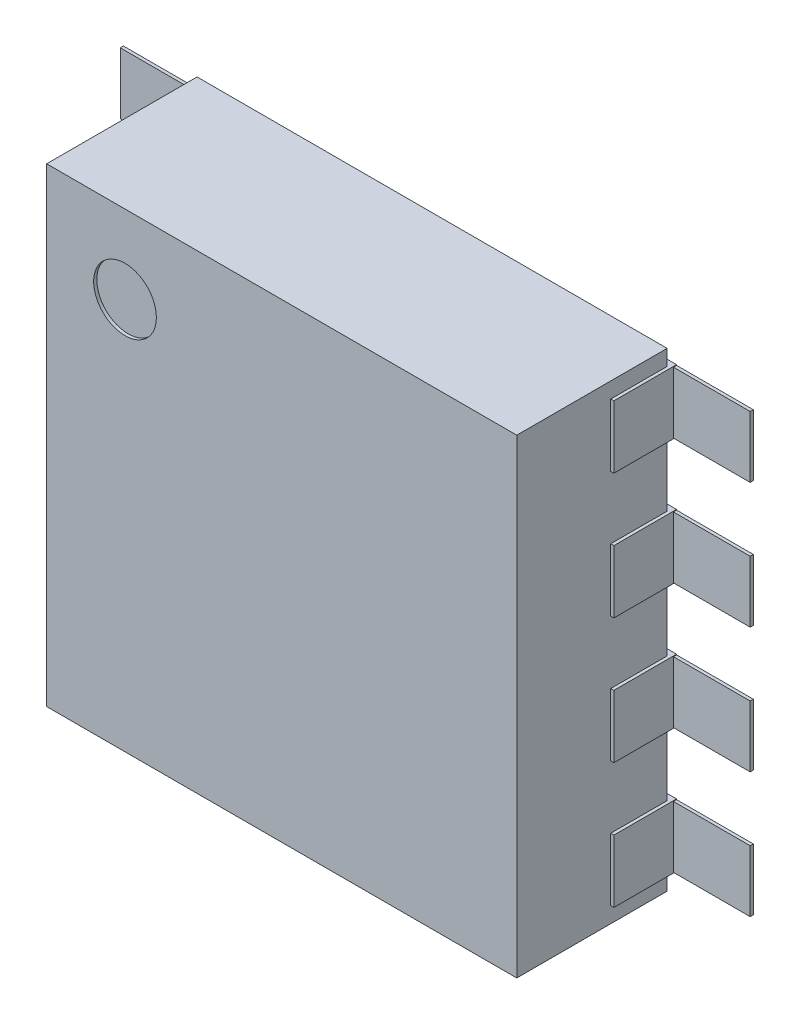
ISO-10303-21;
HEADER;
FILE_DESCRIPTION(('STEP AP214'),'2;1');
FILE_NAME('part.step','',(''),(''),'','','');
FILE_SCHEMA(('AUTOMOTIVE_DESIGN { 1 0 10303 214 1 1 1 1 }'));
ENDSEC;
DATA;
#1=APPLICATION_CONTEXT('core data for automotive mechanical design processes');
#2=APPLICATION_PROTOCOL_DEFINITION('international standard','automotive_design',2000,#1);
#3=PRODUCT_CONTEXT('',#1,'mechanical');
#4=PRODUCT('Part','Part','',(#3));
#5=PRODUCT_RELATED_PRODUCT_CATEGORY('part','',(#4));
#6=PRODUCT_DEFINITION_FORMATION('','',#4);
#7=PRODUCT_DEFINITION_CONTEXT('part definition',#1,'design');
#8=PRODUCT_DEFINITION('design','',#6,#7);
#9=PRODUCT_DEFINITION_SHAPE('','',#8);
#10=(LENGTH_UNIT() NAMED_UNIT(*) SI_UNIT(.MILLI.,.METRE.));
#11=(NAMED_UNIT(*) PLANE_ANGLE_UNIT() SI_UNIT($,.RADIAN.));
#12=(NAMED_UNIT(*) SI_UNIT($,.STERADIAN.) SOLID_ANGLE_UNIT());
#13=UNCERTAINTY_MEASURE_WITH_UNIT(LENGTH_MEASURE(1.E-05),#10,'distance_accuracy_value','');
#14=(GEOMETRIC_REPRESENTATION_CONTEXT(3) GLOBAL_UNCERTAINTY_ASSIGNED_CONTEXT((#13)) GLOBAL_UNIT_ASSIGNED_CONTEXT((#10,
#11,#12)) REPRESENTATION_CONTEXT('',''));
#15=CARTESIAN_POINT('',(0.,0.,0.));
#16=DIRECTION('',(0.,0.,1.));
#17=DIRECTION('',(1.,0.,0.));
#18=AXIS2_PLACEMENT_3D('',#15,#16,#17);
#19=CARTESIAN_POINT('',(0.,0.,0.0862000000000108));
#20=DIRECTION('',(0.,0.,1.));
#21=DIRECTION('',(1.,0.,0.));
#22=AXIS2_PLACEMENT_3D('',#19,#20,#21);
#23=PLANE('',#22);
#24=DIRECTION('',(1.,0.,0.));
#25=VECTOR('',#24,1.);
#26=CARTESIAN_POINT('',(1.00500000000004,-0.502000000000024,0.0862000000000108));
#27=LINE('',#26,#25);
#28=CARTESIAN_POINT('',(0.760000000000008,-0.502000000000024,0.0862000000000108));
#29=VERTEX_POINT('',#28);
#30=CARTESIAN_POINT('',(1.00500000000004,-0.502000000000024,0.0862000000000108));
#31=VERTEX_POINT('',#30);
#32=EDGE_CURVE('E860',#29,#31,#27,.T.);
#33=ORIENTED_EDGE('',*,*,#32,.F.);
#34=DIRECTION('',(0.,1.,0.));
#35=VECTOR('',#34,1.);
#36=CARTESIAN_POINT('',(0.760000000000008,-0.699999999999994,0.0862000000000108));
#37=LINE('',#36,#35);
#38=CARTESIAN_POINT('',(0.760000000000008,-0.698000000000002,0.0862000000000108));
#39=VERTEX_POINT('',#38);
#40=EDGE_CURVE('E569',#39,#29,#37,.T.);
#41=ORIENTED_EDGE('',*,*,#40,.F.);
#42=DIRECTION('',(1.,0.,0.));
#43=VECTOR('',#42,1.);
#44=CARTESIAN_POINT('',(0.574999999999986,-0.698000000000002,0.0862000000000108));
#45=LINE('',#44,#43);
#46=CARTESIAN_POINT('',(1.00500000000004,-0.698000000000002,0.0862000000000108));
#47=VERTEX_POINT('',#46);
#48=EDGE_CURVE('E874',#47,#39,#45,.F.);
#49=ORIENTED_EDGE('',*,*,#48,.F.);
#50=DIRECTION('',(0.,1.,0.));
#51=VECTOR('',#50,1.);
#52=CARTESIAN_POINT('',(1.00500000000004,-0.698000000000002,0.0862000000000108));
#53=LINE('',#52,#51);
#54=EDGE_CURVE('E871',#31,#47,#53,.F.);
#55=ORIENTED_EDGE('',*,*,#54,.F.);
#56=EDGE_LOOP('',(#33,#41,#49,#55));
#57=FACE_BOUND('',#56,.T.);
#58=ADVANCED_FACE('F16',(#57),#23,.T.);
#59=CARTESIAN_POINT('',(0.574999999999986,-0.698000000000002,0.0762));
#60=DIRECTION('',(0.,-1.,0.));
#61=DIRECTION('',(0.,0.,-1.));
#62=AXIS2_PLACEMENT_3D('',#59,#60,#61);
#63=PLANE('',#62);
#64=ORIENTED_EDGE('',*,*,#48,.T.);
#65=DIRECTION('',(0.,0.,-1.));
#66=VECTOR('',#65,1.);
#67=CARTESIAN_POINT('',(0.760000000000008,-0.698000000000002,0.0762));
#68=LINE('',#67,#66);
#69=CARTESIAN_POINT('',(0.760000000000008,-0.698000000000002,0.0762));
#70=VERTEX_POINT('',#69);
#71=EDGE_CURVE('E880',#70,#39,#68,.F.);
#72=ORIENTED_EDGE('',*,*,#71,.F.);
#73=DIRECTION('',(1.,0.,0.));
#74=VECTOR('',#73,1.);
#75=CARTESIAN_POINT('',(0.,-0.698000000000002,0.0762));
#76=LINE('',#75,#74);
#77=CARTESIAN_POINT('',(1.00500000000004,-0.698000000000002,0.0762));
#78=VERTEX_POINT('',#77);
#79=EDGE_CURVE('E566',#70,#78,#76,.T.);
#80=ORIENTED_EDGE('',*,*,#79,.T.);
#81=DIRECTION('',(0.,0.,-1.));
#82=VECTOR('',#81,1.);
#83=CARTESIAN_POINT('',(1.00500000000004,-0.698000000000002,0.0762));
#84=LINE('',#83,#82);
#85=EDGE_CURVE('E868',#47,#78,#84,.T.);
#86=ORIENTED_EDGE('',*,*,#85,.F.);
#87=EDGE_LOOP('',(#64,#72,#80,#86));
#88=FACE_BOUND('',#87,.T.);
#89=ADVANCED_FACE('F2685',(#88),#63,.T.);
#90=CARTESIAN_POINT('',(1.00500000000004,-0.698000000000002,0.0762));
#91=DIRECTION('',(1.,0.,0.));
#92=DIRECTION('',(0.,0.,-1.));
#93=AXIS2_PLACEMENT_3D('',#90,#91,#92);
#94=PLANE('',#93);
#95=ORIENTED_EDGE('',*,*,#85,.T.);
#96=DIRECTION('',(0.,1.,0.));
#97=VECTOR('',#96,1.);
#98=CARTESIAN_POINT('',(1.00500000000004,0.,0.0762));
#99=LINE('',#98,#97);
#100=CARTESIAN_POINT('',(1.00500000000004,-0.502000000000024,0.0762));
#101=VERTEX_POINT('',#100);
#102=EDGE_CURVE('E863',#78,#101,#99,.T.);
#103=ORIENTED_EDGE('',*,*,#102,.T.);
#104=DIRECTION('',(0.,0.,1.));
#105=VECTOR('',#104,1.);
#106=CARTESIAN_POINT('',(1.00500000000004,-0.502000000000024,0.0762));
#107=LINE('',#106,#105);
#108=EDGE_CURVE('E844',#31,#101,#107,.F.);
#109=ORIENTED_EDGE('',*,*,#108,.F.);
#110=ORIENTED_EDGE('',*,*,#54,.T.);
#111=EDGE_LOOP('',(#95,#103,#109,#110));
#112=FACE_BOUND('',#111,.T.);
#113=ADVANCED_FACE('F2675',(#112),#94,.T.);
#114=CARTESIAN_POINT('',(1.00500000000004,-0.502000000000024,0.0762));
#115=DIRECTION('',(0.,1.,0.));
#116=DIRECTION('',(0.,0.,1.));
#117=AXIS2_PLACEMENT_3D('',#114,#115,#116);
#118=PLANE('',#117);
#119=DIRECTION('',(1.,0.,0.));
#120=VECTOR('',#119,1.);
#121=CARTESIAN_POINT('',(0.,-0.502000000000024,0.0762));
#122=LINE('',#121,#120);
#123=CARTESIAN_POINT('',(0.760000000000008,-0.502000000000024,0.0762));
#124=VERTEX_POINT('',#123);
#125=EDGE_CURVE('E865',#101,#124,#122,.F.);
#126=ORIENTED_EDGE('',*,*,#125,.T.);
#127=DIRECTION('',(0.,0.,-1.));
#128=VECTOR('',#127,1.);
#129=CARTESIAN_POINT('',(0.760000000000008,-0.502000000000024,0.0762));
#130=LINE('',#129,#128);
#131=EDGE_CURVE('E642',#29,#124,#130,.T.);
#132=ORIENTED_EDGE('',*,*,#131,.F.);
#133=ORIENTED_EDGE('',*,*,#32,.T.);
#134=ORIENTED_EDGE('',*,*,#108,.T.);
#135=EDGE_LOOP('',(#126,#132,#133,#134));
#136=FACE_BOUND('',#135,.T.);
#137=ADVANCED_FACE('F2664',(#136),#118,.T.);
#138=CARTESIAN_POINT('',(0.,0.,0.0862000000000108));
#139=DIRECTION('',(0.,0.,1.));
#140=DIRECTION('',(1.,0.,0.));
#141=AXIS2_PLACEMENT_3D('',#138,#139,#140);
#142=PLANE('',#141);
#143=DIRECTION('',(1.,0.,0.));
#144=VECTOR('',#143,1.);
#145=CARTESIAN_POINT('',(1.00500000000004,-0.101999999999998,0.0862000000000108));
#146=LINE('',#145,#144);
#147=CARTESIAN_POINT('',(0.760000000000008,-0.101999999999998,0.0862000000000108));
#148=VERTEX_POINT('',#147);
#149=CARTESIAN_POINT('',(1.00500000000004,-0.101999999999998,0.0862000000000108));
#150=VERTEX_POINT('',#149);
#151=EDGE_CURVE('E827',#148,#150,#146,.T.);
#152=ORIENTED_EDGE('',*,*,#151,.F.);
#153=DIRECTION('',(0.,1.,0.));
#154=VECTOR('',#153,1.);
#155=CARTESIAN_POINT('',(0.760000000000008,-0.30000000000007,0.0862000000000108));
#156=LINE('',#155,#154);
#157=CARTESIAN_POINT('',(0.760000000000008,-0.298000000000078,0.0862000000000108));
#158=VERTEX_POINT('',#157);
#159=EDGE_CURVE('E847',#158,#148,#156,.T.);
#160=ORIENTED_EDGE('',*,*,#159,.F.);
#161=DIRECTION('',(1.,0.,0.));
#162=VECTOR('',#161,1.);
#163=CARTESIAN_POINT('',(0.574999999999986,-0.298000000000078,0.0862000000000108));
#164=LINE('',#163,#162);
#165=CARTESIAN_POINT('',(1.00500000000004,-0.298000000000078,0.0862000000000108));
#166=VERTEX_POINT('',#165);
#167=EDGE_CURVE('E842',#166,#158,#164,.F.);
#168=ORIENTED_EDGE('',*,*,#167,.F.);
#169=DIRECTION('',(0.,1.,0.));
#170=VECTOR('',#169,1.);
#171=CARTESIAN_POINT('',(1.00500000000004,-0.298000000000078,0.0862000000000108));
#172=LINE('',#171,#170);
#173=EDGE_CURVE('E839',#150,#166,#172,.F.);
#174=ORIENTED_EDGE('',*,*,#173,.F.);
#175=EDGE_LOOP('',(#152,#160,#168,#174));
#176=FACE_BOUND('',#175,.T.);
#177=ADVANCED_FACE('F2653',(#176),#142,.T.);
#178=CARTESIAN_POINT('',(0.574999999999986,-0.298000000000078,0.0762));
#179=DIRECTION('',(0.,-1.,0.));
#180=DIRECTION('',(0.,0.,-1.));
#181=AXIS2_PLACEMENT_3D('',#178,#179,#180);
#182=PLANE('',#181);
#183=ORIENTED_EDGE('',*,*,#167,.T.);
#184=DIRECTION('',(0.,0.,-1.));
#185=VECTOR('',#184,1.);
#186=CARTESIAN_POINT('',(0.760000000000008,-0.298000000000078,0.0762));
#187=LINE('',#186,#185);
#188=CARTESIAN_POINT('',(0.760000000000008,-0.298000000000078,0.0762));
#189=VERTEX_POINT('',#188);
#190=EDGE_CURVE('E851',#189,#158,#187,.F.);
#191=ORIENTED_EDGE('',*,*,#190,.F.);
#192=DIRECTION('',(1.,0.,0.));
#193=VECTOR('',#192,1.);
#194=CARTESIAN_POINT('',(0.,-0.298000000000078,0.0762));
#195=LINE('',#194,#193);
#196=CARTESIAN_POINT('',(1.00500000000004,-0.298000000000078,0.0762));
#197=VERTEX_POINT('',#196);
#198=EDGE_CURVE('E833',#189,#197,#195,.T.);
#199=ORIENTED_EDGE('',*,*,#198,.T.);
#200=DIRECTION('',(0.,0.,-1.));
#201=VECTOR('',#200,1.);
#202=CARTESIAN_POINT('',(1.00500000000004,-0.298000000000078,0.0762));
#203=LINE('',#202,#201);
#204=EDGE_CURVE('E836',#166,#197,#203,.T.);
#205=ORIENTED_EDGE('',*,*,#204,.F.);
#206=EDGE_LOOP('',(#183,#191,#199,#205));
#207=FACE_BOUND('',#206,.T.);
#208=ADVANCED_FACE('F2642',(#207),#182,.T.);
#209=CARTESIAN_POINT('',(1.00500000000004,-0.298000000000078,0.0762));
#210=DIRECTION('',(1.,0.,0.));
#211=DIRECTION('',(0.,0.,-1.));
#212=AXIS2_PLACEMENT_3D('',#209,#210,#211);
#213=PLANE('',#212);
#214=ORIENTED_EDGE('',*,*,#204,.T.);
#215=DIRECTION('',(0.,1.,0.));
#216=VECTOR('',#215,1.);
#217=CARTESIAN_POINT('',(1.00500000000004,0.,0.0762));
#218=LINE('',#217,#216);
#219=CARTESIAN_POINT('',(1.00500000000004,-0.101999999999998,0.0762));
#220=VERTEX_POINT('',#219);
#221=EDGE_CURVE('E830',#197,#220,#218,.T.);
#222=ORIENTED_EDGE('',*,*,#221,.T.);
#223=DIRECTION('',(0.,0.,1.));
#224=VECTOR('',#223,1.);
#225=CARTESIAN_POINT('',(1.00500000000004,-0.101999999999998,0.0762));
#226=LINE('',#225,#224);
#227=EDGE_CURVE('E811',#150,#220,#226,.F.);
#228=ORIENTED_EDGE('',*,*,#227,.F.);
#229=ORIENTED_EDGE('',*,*,#173,.T.);
#230=EDGE_LOOP('',(#214,#222,#228,#229));
#231=FACE_BOUND('',#230,.T.);
#232=ADVANCED_FACE('F2631',(#231),#213,.T.);
#233=CARTESIAN_POINT('',(1.00500000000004,-0.101999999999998,0.0762));
#234=DIRECTION('',(0.,1.,0.));
#235=DIRECTION('',(0.,0.,1.));
#236=AXIS2_PLACEMENT_3D('',#233,#234,#235);
#237=PLANE('',#236);
#238=DIRECTION('',(1.,0.,0.));
#239=VECTOR('',#238,1.);
#240=CARTESIAN_POINT('',(0.,-0.101999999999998,0.0762));
#241=LINE('',#240,#239);
#242=CARTESIAN_POINT('',(0.760000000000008,-0.101999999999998,0.0762));
#243=VERTEX_POINT('',#242);
#244=EDGE_CURVE('E832',#220,#243,#241,.F.);
#245=ORIENTED_EDGE('',*,*,#244,.T.);
#246=DIRECTION('',(0.,0.,-1.));
#247=VECTOR('',#246,1.);
#248=CARTESIAN_POINT('',(0.760000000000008,-0.101999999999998,0.0762));
#249=LINE('',#248,#247);
#250=EDGE_CURVE('E958',#148,#243,#249,.T.);
#251=ORIENTED_EDGE('',*,*,#250,.F.);
#252=ORIENTED_EDGE('',*,*,#151,.T.);
#253=ORIENTED_EDGE('',*,*,#227,.T.);
#254=EDGE_LOOP('',(#245,#251,#252,#253));
#255=FACE_BOUND('',#254,.T.);
#256=ADVANCED_FACE('F2620',(#255),#237,.T.);
#257=CARTESIAN_POINT('',(0.,0.,0.0862000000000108));
#258=DIRECTION('',(0.,0.,1.));
#259=DIRECTION('',(1.,0.,0.));
#260=AXIS2_PLACEMENT_3D('',#257,#258,#259);
#261=PLANE('',#260);
#262=DIRECTION('',(1.,0.,0.));
#263=VECTOR('',#262,1.);
#264=CARTESIAN_POINT('',(1.00500000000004,0.298000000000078,0.0862000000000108));
#265=LINE('',#264,#263);
#266=CARTESIAN_POINT('',(0.760000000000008,0.298000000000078,0.0862000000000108));
#267=VERTEX_POINT('',#266);
#268=CARTESIAN_POINT('',(1.00500000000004,0.298000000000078,0.0862000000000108));
#269=VERTEX_POINT('',#268);
#270=EDGE_CURVE('E794',#267,#269,#265,.T.);
#271=ORIENTED_EDGE('',*,*,#270,.F.);
#272=DIRECTION('',(0.,1.,0.));
#273=VECTOR('',#272,1.);
#274=CARTESIAN_POINT('',(0.760000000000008,0.100000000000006,0.0862000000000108));
#275=LINE('',#274,#273);
#276=CARTESIAN_POINT('',(0.760000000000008,0.101999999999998,0.0862000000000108));
#277=VERTEX_POINT('',#276);
#278=EDGE_CURVE('E814',#277,#267,#275,.T.);
#279=ORIENTED_EDGE('',*,*,#278,.F.);
#280=DIRECTION('',(1.,0.,0.));
#281=VECTOR('',#280,1.);
#282=CARTESIAN_POINT('',(0.574999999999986,0.101999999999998,0.0862000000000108));
#283=LINE('',#282,#281);
#284=CARTESIAN_POINT('',(1.00500000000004,0.101999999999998,0.0862000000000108));
#285=VERTEX_POINT('',#284);
#286=EDGE_CURVE('E809',#285,#277,#283,.F.);
#287=ORIENTED_EDGE('',*,*,#286,.F.);
#288=DIRECTION('',(0.,1.,0.));
#289=VECTOR('',#288,1.);
#290=CARTESIAN_POINT('',(1.00500000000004,0.101999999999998,0.0862000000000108));
#291=LINE('',#290,#289);
#292=EDGE_CURVE('E806',#269,#285,#291,.F.);
#293=ORIENTED_EDGE('',*,*,#292,.F.);
#294=EDGE_LOOP('',(#271,#279,#287,#293));
#295=FACE_BOUND('',#294,.T.);
#296=ADVANCED_FACE('F2609',(#295),#261,.T.);
#297=CARTESIAN_POINT('',(0.574999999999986,0.101999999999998,0.0762));
#298=DIRECTION('',(0.,-1.,0.));
#299=DIRECTION('',(0.,0.,-1.));
#300=AXIS2_PLACEMENT_3D('',#297,#298,#299);
#301=PLANE('',#300);
#302=ORIENTED_EDGE('',*,*,#286,.T.);
#303=DIRECTION('',(0.,0.,-1.));
#304=VECTOR('',#303,1.);
#305=CARTESIAN_POINT('',(0.760000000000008,0.101999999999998,0.0762));
#306=LINE('',#305,#304);
#307=CARTESIAN_POINT('',(0.760000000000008,0.101999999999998,0.0762));
#308=VERTEX_POINT('',#307);
#309=EDGE_CURVE('E818',#308,#277,#306,.F.);
#310=ORIENTED_EDGE('',*,*,#309,.F.);
#311=DIRECTION('',(1.,0.,0.));
#312=VECTOR('',#311,1.);
#313=CARTESIAN_POINT('',(0.,0.101999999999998,0.0762));
#314=LINE('',#313,#312);
#315=CARTESIAN_POINT('',(1.00500000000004,0.101999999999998,0.0762));
#316=VERTEX_POINT('',#315);
#317=EDGE_CURVE('E800',#308,#316,#314,.T.);
#318=ORIENTED_EDGE('',*,*,#317,.T.);
#319=DIRECTION('',(0.,0.,-1.));
#320=VECTOR('',#319,1.);
#321=CARTESIAN_POINT('',(1.00500000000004,0.101999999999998,0.0762));
#322=LINE('',#321,#320);
#323=EDGE_CURVE('E803',#285,#316,#322,.T.);
#324=ORIENTED_EDGE('',*,*,#323,.F.);
#325=EDGE_LOOP('',(#302,#310,#318,#324));
#326=FACE_BOUND('',#325,.T.);
#327=ADVANCED_FACE('F2598',(#326),#301,.T.);
#328=CARTESIAN_POINT('',(1.00500000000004,0.101999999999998,0.0762));
#329=DIRECTION('',(1.,0.,0.));
#330=DIRECTION('',(0.,0.,-1.));
#331=AXIS2_PLACEMENT_3D('',#328,#329,#330);
#332=PLANE('',#331);
#333=ORIENTED_EDGE('',*,*,#323,.T.);
#334=DIRECTION('',(0.,1.,0.));
#335=VECTOR('',#334,1.);
#336=CARTESIAN_POINT('',(1.00500000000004,0.,0.0762));
#337=LINE('',#336,#335);
#338=CARTESIAN_POINT('',(1.00500000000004,0.298000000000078,0.0762));
#339=VERTEX_POINT('',#338);
#340=EDGE_CURVE('E797',#316,#339,#337,.T.);
#341=ORIENTED_EDGE('',*,*,#340,.T.);
#342=DIRECTION('',(0.,0.,1.));
#343=VECTOR('',#342,1.);
#344=CARTESIAN_POINT('',(1.00500000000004,0.298000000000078,0.0762));
#345=LINE('',#344,#343);
#346=EDGE_CURVE('E780',#269,#339,#345,.F.);
#347=ORIENTED_EDGE('',*,*,#346,.F.);
#348=ORIENTED_EDGE('',*,*,#292,.T.);
#349=EDGE_LOOP('',(#333,#341,#347,#348));
#350=FACE_BOUND('',#349,.T.);
#351=ADVANCED_FACE('F2587',(#350),#332,.T.);
#352=CARTESIAN_POINT('',(1.00500000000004,0.298000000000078,0.0762));
#353=DIRECTION('',(0.,1.,0.));
#354=DIRECTION('',(0.,0.,1.));
#355=AXIS2_PLACEMENT_3D('',#352,#353,#354);
#356=PLANE('',#355);
#357=DIRECTION('',(1.,0.,0.));
#358=VECTOR('',#357,1.);
#359=CARTESIAN_POINT('',(0.,0.298000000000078,0.0762));
#360=LINE('',#359,#358);
#361=CARTESIAN_POINT('',(0.760000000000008,0.298000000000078,0.0762));
#362=VERTEX_POINT('',#361);
#363=EDGE_CURVE('E799',#339,#362,#360,.F.);
#364=ORIENTED_EDGE('',*,*,#363,.T.);
#365=DIRECTION('',(0.,0.,-1.));
#366=VECTOR('',#365,1.);
#367=CARTESIAN_POINT('',(0.760000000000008,0.298000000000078,0.0762));
#368=LINE('',#367,#366);
#369=EDGE_CURVE('E955',#267,#362,#368,.T.);
#370=ORIENTED_EDGE('',*,*,#369,.F.);
#371=ORIENTED_EDGE('',*,*,#270,.T.);
#372=ORIENTED_EDGE('',*,*,#346,.T.);
#373=EDGE_LOOP('',(#364,#370,#371,#372));
#374=FACE_BOUND('',#373,.T.);
#375=ADVANCED_FACE('F2576',(#374),#356,.T.);
#376=CARTESIAN_POINT('',(1.00500000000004,0.502000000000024,0.0762));
#377=DIRECTION('',(1.,0.,0.));
#378=DIRECTION('',(0.,0.,-1.));
#379=AXIS2_PLACEMENT_3D('',#376,#377,#378);
#380=PLANE('',#379);
#381=DIRECTION('',(0.,0.,-1.));
#382=VECTOR('',#381,1.);
#383=CARTESIAN_POINT('',(1.00500000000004,0.502000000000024,0.0762));
#384=LINE('',#383,#382);
#385=CARTESIAN_POINT('',(1.00500000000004,0.502000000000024,0.0762));
#386=VERTEX_POINT('',#385);
#387=CARTESIAN_POINT('',(1.00500000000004,0.502000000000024,0.0862000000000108));
#388=VERTEX_POINT('',#387);
#389=EDGE_CURVE('E770',#386,#388,#384,.F.);
#390=ORIENTED_EDGE('',*,*,#389,.F.);
#391=DIRECTION('',(0.,1.,0.));
#392=VECTOR('',#391,1.);
#393=CARTESIAN_POINT('',(1.00500000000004,0.,0.0762));
#394=LINE('',#393,#392);
#395=CARTESIAN_POINT('',(1.00500000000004,0.698000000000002,0.0762));
#396=VERTEX_POINT('',#395);
#397=EDGE_CURVE('E783',#386,#396,#394,.T.);
#398=ORIENTED_EDGE('',*,*,#397,.T.);
#399=DIRECTION('',(0.,0.,1.));
#400=VECTOR('',#399,1.);
#401=CARTESIAN_POINT('',(1.00500000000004,0.698000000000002,0.0762));
#402=LINE('',#401,#400);
#403=CARTESIAN_POINT('',(1.00500000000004,0.698000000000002,0.0862000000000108));
#404=VERTEX_POINT('',#403);
#405=EDGE_CURVE('E777',#404,#396,#402,.F.);
#406=ORIENTED_EDGE('',*,*,#405,.F.);
#407=DIRECTION('',(0.,1.,0.));
#408=VECTOR('',#407,1.);
#409=CARTESIAN_POINT('',(1.00500000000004,0.,0.0862000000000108));
#410=LINE('',#409,#408);
#411=EDGE_CURVE('E769',#388,#404,#410,.T.);
#412=ORIENTED_EDGE('',*,*,#411,.F.);
#413=EDGE_LOOP('',(#390,#398,#406,#412));
#414=FACE_BOUND('',#413,.T.);
#415=ADVANCED_FACE('F2565',(#414),#380,.T.);
#416=CARTESIAN_POINT('',(1.00500000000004,0.698000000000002,0.0762));
#417=DIRECTION('',(0.,1.,0.));
#418=DIRECTION('',(0.,0.,1.));
#419=AXIS2_PLACEMENT_3D('',#416,#417,#418);
#420=PLANE('',#419);
#421=DIRECTION('',(1.,0.,0.));
#422=VECTOR('',#421,1.);
#423=CARTESIAN_POINT('',(0.,0.698000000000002,0.0762));
#424=LINE('',#423,#422);
#425=CARTESIAN_POINT('',(0.760000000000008,0.698000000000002,0.0762));
#426=VERTEX_POINT('',#425);
#427=EDGE_CURVE('E785',#396,#426,#424,.F.);
#428=ORIENTED_EDGE('',*,*,#427,.T.);
#429=DIRECTION('',(0.,0.,-1.));
#430=VECTOR('',#429,1.);
#431=CARTESIAN_POINT('',(0.760000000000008,0.698000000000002,0.0762));
#432=LINE('',#431,#430);
#433=CARTESIAN_POINT('',(0.760000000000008,0.698000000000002,0.0862000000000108));
#434=VERTEX_POINT('',#433);
#435=EDGE_CURVE('E948',#434,#426,#432,.T.);
#436=ORIENTED_EDGE('',*,*,#435,.F.);
#437=DIRECTION('',(1.,0.,0.));
#438=VECTOR('',#437,1.);
#439=CARTESIAN_POINT('',(0.,0.698000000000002,0.0862000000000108));
#440=LINE('',#439,#438);
#441=EDGE_CURVE('E745',#404,#434,#440,.F.);
#442=ORIENTED_EDGE('',*,*,#441,.F.);
#443=ORIENTED_EDGE('',*,*,#405,.T.);
#444=EDGE_LOOP('',(#428,#436,#442,#443));
#445=FACE_BOUND('',#444,.T.);
#446=ADVANCED_FACE('F2554',(#445),#420,.T.);
#447=CARTESIAN_POINT('',(0.574999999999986,0.502000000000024,0.0762));
#448=DIRECTION('',(0.,-1.,0.));
#449=DIRECTION('',(0.,0.,-1.));
#450=AXIS2_PLACEMENT_3D('',#447,#448,#449);
#451=PLANE('',#450);
#452=DIRECTION('',(1.,0.,0.));
#453=VECTOR('',#452,1.);
#454=CARTESIAN_POINT('',(0.,0.502000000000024,0.0862000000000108));
#455=LINE('',#454,#453);
#456=CARTESIAN_POINT('',(0.760000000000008,0.502000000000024,0.0862000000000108));
#457=VERTEX_POINT('',#456);
#458=EDGE_CURVE('E766',#457,#388,#455,.T.);
#459=ORIENTED_EDGE('',*,*,#458,.F.);
#460=DIRECTION('',(0.,0.,-1.));
#461=VECTOR('',#460,1.);
#462=CARTESIAN_POINT('',(0.760000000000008,0.502000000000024,0.0762));
#463=LINE('',#462,#461);
#464=CARTESIAN_POINT('',(0.760000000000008,0.502000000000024,0.0762));
#465=VERTEX_POINT('',#464);
#466=EDGE_CURVE('E763',#465,#457,#463,.F.);
#467=ORIENTED_EDGE('',*,*,#466,.F.);
#468=DIRECTION('',(1.,0.,0.));
#469=VECTOR('',#468,1.);
#470=CARTESIAN_POINT('',(0.,0.502000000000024,0.0762));
#471=LINE('',#470,#469);
#472=EDGE_CURVE('E786',#465,#386,#471,.T.);
#473=ORIENTED_EDGE('',*,*,#472,.T.);
#474=ORIENTED_EDGE('',*,*,#389,.T.);
#475=EDGE_LOOP('',(#459,#467,#473,#474));
#476=FACE_BOUND('',#475,.T.);
#477=ADVANCED_FACE('F2543',(#476),#451,.T.);
#478=CARTESIAN_POINT('',(0.,0.,0.0862000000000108));
#479=DIRECTION('',(0.,0.,1.));
#480=DIRECTION('',(1.,0.,0.));
#481=AXIS2_PLACEMENT_3D('',#478,#479,#480);
#482=PLANE('',#481);
#483=ORIENTED_EDGE('',*,*,#441,.T.);
#484=DIRECTION('',(0.,1.,0.));
#485=VECTOR('',#484,1.);
#486=CARTESIAN_POINT('',(0.760000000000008,0.500000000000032,0.0862000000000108));
#487=LINE('',#486,#485);
#488=EDGE_CURVE('E759',#457,#434,#487,.T.);
#489=ORIENTED_EDGE('',*,*,#488,.F.);
#490=ORIENTED_EDGE('',*,*,#458,.T.);
#491=ORIENTED_EDGE('',*,*,#411,.T.);
#492=EDGE_LOOP('',(#483,#489,#490,#491));
#493=FACE_BOUND('',#492,.T.);
#494=ADVANCED_FACE('F2532',(#493),#482,.T.);
#495=CARTESIAN_POINT('',(0.,0.,0.0862000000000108));
#496=DIRECTION('',(0.,0.,1.));
#497=DIRECTION('',(1.,0.,0.));
#498=AXIS2_PLACEMENT_3D('',#495,#496,#497);
#499=PLANE('',#498);
#500=DIRECTION('',(1.,0.,0.));
#501=VECTOR('',#500,1.);
#502=CARTESIAN_POINT('',(-1.00500000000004,0.101999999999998,0.0862000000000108));
#503=LINE('',#502,#501);
#504=CARTESIAN_POINT('',(-0.760000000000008,0.101999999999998,0.0862000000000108));
#505=VERTEX_POINT('',#504);
#506=CARTESIAN_POINT('',(-1.00500000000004,0.101999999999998,0.0862000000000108));
#507=VERTEX_POINT('',#506);
#508=EDGE_CURVE('E728',#505,#507,#503,.F.);
#509=ORIENTED_EDGE('',*,*,#508,.F.);
#510=DIRECTION('',(0.,1.,0.));
#511=VECTOR('',#510,1.);
#512=CARTESIAN_POINT('',(-0.760000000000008,0.30000000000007,0.0862000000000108));
#513=LINE('',#512,#511);
#514=CARTESIAN_POINT('',(-0.760000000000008,0.298000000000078,0.0862000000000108));
#515=VERTEX_POINT('',#514);
#516=EDGE_CURVE('E748',#515,#505,#513,.F.);
#517=ORIENTED_EDGE('',*,*,#516,.F.);
#518=DIRECTION('',(1.,0.,0.));
#519=VECTOR('',#518,1.);
#520=CARTESIAN_POINT('',(-0.574999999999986,0.298000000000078,0.0862000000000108));
#521=LINE('',#520,#519);
#522=CARTESIAN_POINT('',(-1.00500000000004,0.298000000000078,0.0862000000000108));
#523=VERTEX_POINT('',#522);
#524=EDGE_CURVE('E743',#523,#515,#521,.T.);
#525=ORIENTED_EDGE('',*,*,#524,.F.);
#526=DIRECTION('',(0.,1.,0.));
#527=VECTOR('',#526,1.);
#528=CARTESIAN_POINT('',(-1.00500000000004,0.298000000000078,0.0862000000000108));
#529=LINE('',#528,#527);
#530=EDGE_CURVE('E740',#507,#523,#529,.T.);
#531=ORIENTED_EDGE('',*,*,#530,.F.);
#532=EDGE_LOOP('',(#509,#517,#525,#531));
#533=FACE_BOUND('',#532,.T.);
#534=ADVANCED_FACE('F2521',(#533),#499,.T.);
#535=CARTESIAN_POINT('',(-0.574999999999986,0.298000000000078,0.0762));
#536=DIRECTION('',(0.,1.,0.));
#537=DIRECTION('',(0.,0.,1.));
#538=AXIS2_PLACEMENT_3D('',#535,#536,#537);
#539=PLANE('',#538);
#540=ORIENTED_EDGE('',*,*,#524,.T.);
#541=DIRECTION('',(0.,0.,1.));
#542=VECTOR('',#541,1.);
#543=CARTESIAN_POINT('',(-0.760000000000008,0.298000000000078,0.0762));
#544=LINE('',#543,#542);
#545=CARTESIAN_POINT('',(-0.760000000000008,0.298000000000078,0.0762));
#546=VERTEX_POINT('',#545);
#547=EDGE_CURVE('E752',#546,#515,#544,.T.);
#548=ORIENTED_EDGE('',*,*,#547,.F.);
#549=DIRECTION('',(1.,0.,0.));
#550=VECTOR('',#549,1.);
#551=CARTESIAN_POINT('',(0.,0.298000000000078,0.0762));
#552=LINE('',#551,#550);
#553=CARTESIAN_POINT('',(-1.00500000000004,0.298000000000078,0.0762));
#554=VERTEX_POINT('',#553);
#555=EDGE_CURVE('E734',#546,#554,#552,.F.);
#556=ORIENTED_EDGE('',*,*,#555,.T.);
#557=DIRECTION('',(0.,0.,1.));
#558=VECTOR('',#557,1.);
#559=CARTESIAN_POINT('',(-1.00500000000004,0.298000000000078,0.0762));
#560=LINE('',#559,#558);
#561=EDGE_CURVE('E737',#523,#554,#560,.F.);
#562=ORIENTED_EDGE('',*,*,#561,.F.);
#563=EDGE_LOOP('',(#540,#548,#556,#562));
#564=FACE_BOUND('',#563,.T.);
#565=ADVANCED_FACE('F2510',(#564),#539,.T.);
#566=CARTESIAN_POINT('',(-1.00500000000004,0.298000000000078,0.0762));
#567=DIRECTION('',(-1.,0.,0.));
#568=DIRECTION('',(0.,0.,1.));
#569=AXIS2_PLACEMENT_3D('',#566,#567,#568);
#570=PLANE('',#569);
#571=ORIENTED_EDGE('',*,*,#561,.T.);
#572=DIRECTION('',(0.,1.,0.));
#573=VECTOR('',#572,1.);
#574=CARTESIAN_POINT('',(-1.00500000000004,0.,0.0762));
#575=LINE('',#574,#573);
#576=CARTESIAN_POINT('',(-1.00500000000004,0.101999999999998,0.0762));
#577=VERTEX_POINT('',#576);
#578=EDGE_CURVE('E731',#554,#577,#575,.F.);
#579=ORIENTED_EDGE('',*,*,#578,.T.);
#580=DIRECTION('',(0.,0.,-1.));
#581=VECTOR('',#580,1.);
#582=CARTESIAN_POINT('',(-1.00500000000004,0.101999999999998,0.0762));
#583=LINE('',#582,#581);
#584=EDGE_CURVE('E712',#507,#577,#583,.T.);
#585=ORIENTED_EDGE('',*,*,#584,.F.);
#586=ORIENTED_EDGE('',*,*,#530,.T.);
#587=EDGE_LOOP('',(#571,#579,#585,#586));
#588=FACE_BOUND('',#587,.T.);
#589=ADVANCED_FACE('F2499',(#588),#570,.T.);
#590=CARTESIAN_POINT('',(-1.00500000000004,0.101999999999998,0.0762));
#591=DIRECTION('',(0.,-1.,0.));
#592=DIRECTION('',(0.,0.,-1.));
#593=AXIS2_PLACEMENT_3D('',#590,#591,#592);
#594=PLANE('',#593);
#595=DIRECTION('',(1.,0.,0.));
#596=VECTOR('',#595,1.);
#597=CARTESIAN_POINT('',(0.,0.101999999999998,0.0762));
#598=LINE('',#597,#596);
#599=CARTESIAN_POINT('',(-0.760000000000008,0.101999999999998,0.0762));
#600=VERTEX_POINT('',#599);
#601=EDGE_CURVE('E733',#577,#600,#598,.T.);
#602=ORIENTED_EDGE('',*,*,#601,.T.);
#603=DIRECTION('',(0.,0.,1.));
#604=VECTOR('',#603,1.);
#605=CARTESIAN_POINT('',(-0.760000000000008,0.101999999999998,0.0762));
#606=LINE('',#605,#604);
#607=EDGE_CURVE('E762',#505,#600,#606,.F.);
#608=ORIENTED_EDGE('',*,*,#607,.F.);
#609=ORIENTED_EDGE('',*,*,#508,.T.);
#610=ORIENTED_EDGE('',*,*,#584,.T.);
#611=EDGE_LOOP('',(#602,#608,#609,#610));
#612=FACE_BOUND('',#611,.T.);
#613=ADVANCED_FACE('F2488',(#612),#594,.T.);
#614=CARTESIAN_POINT('',(0.,0.,0.0862000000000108));
#615=DIRECTION('',(0.,0.,1.));
#616=DIRECTION('',(1.,0.,0.));
#617=AXIS2_PLACEMENT_3D('',#614,#615,#616);
#618=PLANE('',#617);
#619=DIRECTION('',(1.,0.,0.));
#620=VECTOR('',#619,1.);
#621=CARTESIAN_POINT('',(-1.00500000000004,-0.298000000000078,0.0862000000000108));
#622=LINE('',#621,#620);
#623=CARTESIAN_POINT('',(-0.760000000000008,-0.298000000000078,0.0862000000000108));
#624=VERTEX_POINT('',#623);
#625=CARTESIAN_POINT('',(-1.00500000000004,-0.298000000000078,0.0862000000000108));
#626=VERTEX_POINT('',#625);
#627=EDGE_CURVE('E695',#624,#626,#622,.F.);
#628=ORIENTED_EDGE('',*,*,#627,.F.);
#629=DIRECTION('',(0.,1.,0.));
#630=VECTOR('',#629,1.);
#631=CARTESIAN_POINT('',(-0.760000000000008,-0.100000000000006,0.0862000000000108));
#632=LINE('',#631,#630);
#633=CARTESIAN_POINT('',(-0.760000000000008,-0.101999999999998,0.0862000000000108));
#634=VERTEX_POINT('',#633);
#635=EDGE_CURVE('E715',#634,#624,#632,.F.);
#636=ORIENTED_EDGE('',*,*,#635,.F.);
#637=DIRECTION('',(1.,0.,0.));
#638=VECTOR('',#637,1.);
#639=CARTESIAN_POINT('',(-0.574999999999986,-0.101999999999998,0.0862000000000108));
#640=LINE('',#639,#638);
#641=CARTESIAN_POINT('',(-1.00500000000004,-0.101999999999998,0.0862000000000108));
#642=VERTEX_POINT('',#641);
#643=EDGE_CURVE('E710',#642,#634,#640,.T.);
#644=ORIENTED_EDGE('',*,*,#643,.F.);
#645=DIRECTION('',(0.,1.,0.));
#646=VECTOR('',#645,1.);
#647=CARTESIAN_POINT('',(-1.00500000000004,-0.101999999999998,0.0862000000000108));
#648=LINE('',#647,#646);
#649=EDGE_CURVE('E707',#626,#642,#648,.T.);
#650=ORIENTED_EDGE('',*,*,#649,.F.);
#651=EDGE_LOOP('',(#628,#636,#644,#650));
#652=FACE_BOUND('',#651,.T.);
#653=ADVANCED_FACE('F2477',(#652),#618,.T.);
#654=CARTESIAN_POINT('',(-0.574999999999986,-0.101999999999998,0.0762));
#655=DIRECTION('',(0.,1.,0.));
#656=DIRECTION('',(0.,0.,1.));
#657=AXIS2_PLACEMENT_3D('',#654,#655,#656);
#658=PLANE('',#657);
#659=ORIENTED_EDGE('',*,*,#643,.T.);
#660=DIRECTION('',(0.,0.,1.));
#661=VECTOR('',#660,1.);
#662=CARTESIAN_POINT('',(-0.760000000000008,-0.101999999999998,0.0762));
#663=LINE('',#662,#661);
#664=CARTESIAN_POINT('',(-0.760000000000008,-0.101999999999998,0.0762));
#665=VERTEX_POINT('',#664);
#666=EDGE_CURVE('E719',#665,#634,#663,.T.);
#667=ORIENTED_EDGE('',*,*,#666,.F.);
#668=DIRECTION('',(1.,0.,0.));
#669=VECTOR('',#668,1.);
#670=CARTESIAN_POINT('',(0.,-0.101999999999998,0.0762));
#671=LINE('',#670,#669);
#672=CARTESIAN_POINT('',(-1.00500000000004,-0.101999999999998,0.0762));
#673=VERTEX_POINT('',#672);
#674=EDGE_CURVE('E701',#665,#673,#671,.F.);
#675=ORIENTED_EDGE('',*,*,#674,.T.);
#676=DIRECTION('',(0.,0.,1.));
#677=VECTOR('',#676,1.);
#678=CARTESIAN_POINT('',(-1.00500000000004,-0.101999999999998,0.0762));
#679=LINE('',#678,#677);
#680=EDGE_CURVE('E704',#642,#673,#679,.F.);
#681=ORIENTED_EDGE('',*,*,#680,.F.);
#682=EDGE_LOOP('',(#659,#667,#675,#681));
#683=FACE_BOUND('',#682,.T.);
#684=ADVANCED_FACE('F2466',(#683),#658,.T.);
#685=CARTESIAN_POINT('',(-1.00500000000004,-0.101999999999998,0.0762));
#686=DIRECTION('',(-1.,0.,0.));
#687=DIRECTION('',(0.,0.,1.));
#688=AXIS2_PLACEMENT_3D('',#685,#686,#687);
#689=PLANE('',#688);
#690=ORIENTED_EDGE('',*,*,#680,.T.);
#691=DIRECTION('',(0.,1.,0.));
#692=VECTOR('',#691,1.);
#693=CARTESIAN_POINT('',(-1.00500000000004,0.,0.0762));
#694=LINE('',#693,#692);
#695=CARTESIAN_POINT('',(-1.00500000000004,-0.298000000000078,0.0762));
#696=VERTEX_POINT('',#695);
#697=EDGE_CURVE('E698',#673,#696,#694,.F.);
#698=ORIENTED_EDGE('',*,*,#697,.T.);
#699=DIRECTION('',(0.,0.,-1.));
#700=VECTOR('',#699,1.);
#701=CARTESIAN_POINT('',(-1.00500000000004,-0.298000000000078,0.0762));
#702=LINE('',#701,#700);
#703=EDGE_CURVE('E679',#626,#696,#702,.T.);
#704=ORIENTED_EDGE('',*,*,#703,.F.);
#705=ORIENTED_EDGE('',*,*,#649,.T.);
#706=EDGE_LOOP('',(#690,#698,#704,#705));
#707=FACE_BOUND('',#706,.T.);
#708=ADVANCED_FACE('F1843',(#707),#689,.T.);
#709=CARTESIAN_POINT('',(-1.00500000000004,-0.298000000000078,0.0762));
#710=DIRECTION('',(0.,-1.,0.));
#711=DIRECTION('',(0.,0.,-1.));
#712=AXIS2_PLACEMENT_3D('',#709,#710,#711);
#713=PLANE('',#712);
#714=DIRECTION('',(1.,0.,0.));
#715=VECTOR('',#714,1.);
#716=CARTESIAN_POINT('',(0.,-0.298000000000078,0.0762));
#717=LINE('',#716,#715);
#718=CARTESIAN_POINT('',(-0.760000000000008,-0.298000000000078,0.0762));
#719=VERTEX_POINT('',#718);
#720=EDGE_CURVE('E700',#696,#719,#717,.T.);
#721=ORIENTED_EDGE('',*,*,#720,.T.);
#722=DIRECTION('',(0.,0.,1.));
#723=VECTOR('',#722,1.);
#724=CARTESIAN_POINT('',(-0.760000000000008,-0.298000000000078,0.0762));
#725=LINE('',#724,#723);
#726=EDGE_CURVE('E940',#624,#719,#725,.F.);
#727=ORIENTED_EDGE('',*,*,#726,.F.);
#728=ORIENTED_EDGE('',*,*,#627,.T.);
#729=ORIENTED_EDGE('',*,*,#703,.T.);
#730=EDGE_LOOP('',(#721,#727,#728,#729));
#731=FACE_BOUND('',#730,.T.);
#732=ADVANCED_FACE('F1835',(#731),#713,.T.);
#733=CARTESIAN_POINT('',(0.,0.,0.0862000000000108));
#734=DIRECTION('',(0.,0.,1.));
#735=DIRECTION('',(1.,0.,0.));
#736=AXIS2_PLACEMENT_3D('',#733,#734,#735);
#737=PLANE('',#736);
#738=DIRECTION('',(1.,0.,0.));
#739=VECTOR('',#738,1.);
#740=CARTESIAN_POINT('',(-1.00500000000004,-0.698000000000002,0.0862000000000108));
#741=LINE('',#740,#739);
#742=CARTESIAN_POINT('',(-0.760000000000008,-0.698000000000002,0.0862000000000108));
#743=VERTEX_POINT('',#742);
#744=CARTESIAN_POINT('',(-1.00500000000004,-0.698000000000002,0.0862000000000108));
#745=VERTEX_POINT('',#744);
#746=EDGE_CURVE('E662',#743,#745,#741,.F.);
#747=ORIENTED_EDGE('',*,*,#746,.F.);
#748=DIRECTION('',(0.,1.,0.));
#749=VECTOR('',#748,1.);
#750=CARTESIAN_POINT('',(-0.760000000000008,-0.500000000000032,0.0862000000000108));
#751=LINE('',#750,#749);
#752=CARTESIAN_POINT('',(-0.760000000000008,-0.502000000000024,0.0862000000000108));
#753=VERTEX_POINT('',#752);
#754=EDGE_CURVE('E682',#753,#743,#751,.F.);
#755=ORIENTED_EDGE('',*,*,#754,.F.);
#756=DIRECTION('',(1.,0.,0.));
#757=VECTOR('',#756,1.);
#758=CARTESIAN_POINT('',(-0.574999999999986,-0.502000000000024,0.0862000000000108));
#759=LINE('',#758,#757);
#760=CARTESIAN_POINT('',(-1.00500000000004,-0.502000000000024,0.0862000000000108));
#761=VERTEX_POINT('',#760);
#762=EDGE_CURVE('E677',#761,#753,#759,.T.);
#763=ORIENTED_EDGE('',*,*,#762,.F.);
#764=DIRECTION('',(0.,1.,0.));
#765=VECTOR('',#764,1.);
#766=CARTESIAN_POINT('',(-1.00500000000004,-0.502000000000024,0.0862000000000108));
#767=LINE('',#766,#765);
#768=EDGE_CURVE('E674',#745,#761,#767,.T.);
#769=ORIENTED_EDGE('',*,*,#768,.F.);
#770=EDGE_LOOP('',(#747,#755,#763,#769));
#771=FACE_BOUND('',#770,.T.);
#772=ADVANCED_FACE('F1833',(#771),#737,.T.);
#773=CARTESIAN_POINT('',(-0.574999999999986,-0.502000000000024,0.0762));
#774=DIRECTION('',(0.,1.,0.));
#775=DIRECTION('',(0.,0.,1.));
#776=AXIS2_PLACEMENT_3D('',#773,#774,#775);
#777=PLANE('',#776);
#778=ORIENTED_EDGE('',*,*,#762,.T.);
#779=DIRECTION('',(0.,0.,1.));
#780=VECTOR('',#779,1.);
#781=CARTESIAN_POINT('',(-0.760000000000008,-0.502000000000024,0.0762));
#782=LINE('',#781,#780);
#783=CARTESIAN_POINT('',(-0.760000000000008,-0.502000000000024,0.0762));
#784=VERTEX_POINT('',#783);
#785=EDGE_CURVE('E686',#784,#753,#782,.T.);
#786=ORIENTED_EDGE('',*,*,#785,.F.);
#787=DIRECTION('',(1.,0.,0.));
#788=VECTOR('',#787,1.);
#789=CARTESIAN_POINT('',(0.,-0.502000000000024,0.0762));
#790=LINE('',#789,#788);
#791=CARTESIAN_POINT('',(-1.00500000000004,-0.502000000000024,0.0762));
#792=VERTEX_POINT('',#791);
#793=EDGE_CURVE('E668',#784,#792,#790,.F.);
#794=ORIENTED_EDGE('',*,*,#793,.T.);
#795=DIRECTION('',(0.,0.,1.));
#796=VECTOR('',#795,1.);
#797=CARTESIAN_POINT('',(-1.00500000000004,-0.502000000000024,0.0762));
#798=LINE('',#797,#796);
#799=EDGE_CURVE('E671',#761,#792,#798,.F.);
#800=ORIENTED_EDGE('',*,*,#799,.F.);
#801=EDGE_LOOP('',(#778,#786,#794,#800));
#802=FACE_BOUND('',#801,.T.);
#803=ADVANCED_FACE('F1830',(#802),#777,.T.);
#804=CARTESIAN_POINT('',(-1.00500000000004,-0.502000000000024,0.0762));
#805=DIRECTION('',(-1.,0.,0.));
#806=DIRECTION('',(0.,0.,1.));
#807=AXIS2_PLACEMENT_3D('',#804,#805,#806);
#808=PLANE('',#807);
#809=ORIENTED_EDGE('',*,*,#799,.T.);
#810=DIRECTION('',(0.,1.,0.));
#811=VECTOR('',#810,1.);
#812=CARTESIAN_POINT('',(-1.00500000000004,0.,0.0762));
#813=LINE('',#812,#811);
#814=CARTESIAN_POINT('',(-1.00500000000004,-0.698000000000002,0.0762));
#815=VERTEX_POINT('',#814);
#816=EDGE_CURVE('E665',#792,#815,#813,.F.);
#817=ORIENTED_EDGE('',*,*,#816,.T.);
#818=DIRECTION('',(0.,0.,-1.));
#819=VECTOR('',#818,1.);
#820=CARTESIAN_POINT('',(-1.00500000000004,-0.698000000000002,0.0762));
#821=LINE('',#820,#819);
#822=EDGE_CURVE('E648',#745,#815,#821,.T.);
#823=ORIENTED_EDGE('',*,*,#822,.F.);
#824=ORIENTED_EDGE('',*,*,#768,.T.);
#825=EDGE_LOOP('',(#809,#817,#823,#824));
#826=FACE_BOUND('',#825,.T.);
#827=ADVANCED_FACE('F1827',(#826),#808,.T.);
#828=CARTESIAN_POINT('',(-1.00500000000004,-0.698000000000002,0.0762));
#829=DIRECTION('',(0.,-1.,0.));
#830=DIRECTION('',(0.,0.,-1.));
#831=AXIS2_PLACEMENT_3D('',#828,#829,#830);
#832=PLANE('',#831);
#833=DIRECTION('',(1.,0.,0.));
#834=VECTOR('',#833,1.);
#835=CARTESIAN_POINT('',(0.,-0.698000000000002,0.0762));
#836=LINE('',#835,#834);
#837=CARTESIAN_POINT('',(-0.760000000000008,-0.698000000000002,0.0762));
#838=VERTEX_POINT('',#837);
#839=EDGE_CURVE('E667',#815,#838,#836,.T.);
#840=ORIENTED_EDGE('',*,*,#839,.T.);
#841=DIRECTION('',(0.,0.,1.));
#842=VECTOR('',#841,1.);
#843=CARTESIAN_POINT('',(-0.760000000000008,-0.698000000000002,0.0762));
#844=LINE('',#843,#842);
#845=EDGE_CURVE('E935',#743,#838,#844,.F.);
#846=ORIENTED_EDGE('',*,*,#845,.F.);
#847=ORIENTED_EDGE('',*,*,#746,.T.);
#848=ORIENTED_EDGE('',*,*,#822,.T.);
#849=EDGE_LOOP('',(#840,#846,#847,#848));
#850=FACE_BOUND('',#849,.T.);
#851=ADVANCED_FACE('F1824',(#850),#832,.T.);
#852=CARTESIAN_POINT('',(-1.00500000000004,0.698000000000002,0.0762));
#853=DIRECTION('',(-1.,0.,0.));
#854=DIRECTION('',(0.,0.,1.));
#855=AXIS2_PLACEMENT_3D('',#852,#853,#854);
#856=PLANE('',#855);
#857=DIRECTION('',(0.,0.,1.));
#858=VECTOR('',#857,1.);
#859=CARTESIAN_POINT('',(-1.00500000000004,0.698000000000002,0.0762));
#860=LINE('',#859,#858);
#861=CARTESIAN_POINT('',(-1.00500000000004,0.698000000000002,0.0762));
#862=VERTEX_POINT('',#861);
#863=CARTESIAN_POINT('',(-1.00500000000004,0.698000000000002,0.0862000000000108));
#864=VERTEX_POINT('',#863);
#865=EDGE_CURVE('E636',#862,#864,#860,.T.);
#866=ORIENTED_EDGE('',*,*,#865,.F.);
#867=DIRECTION('',(0.,1.,0.));
#868=VECTOR('',#867,1.);
#869=CARTESIAN_POINT('',(-1.00500000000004,0.,0.0762));
#870=LINE('',#869,#868);
#871=CARTESIAN_POINT('',(-1.00500000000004,0.502000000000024,0.0762));
#872=VERTEX_POINT('',#871);
#873=EDGE_CURVE('E651',#862,#872,#870,.F.);
#874=ORIENTED_EDGE('',*,*,#873,.T.);
#875=DIRECTION('',(0.,0.,-1.));
#876=VECTOR('',#875,1.);
#877=CARTESIAN_POINT('',(-1.00500000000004,0.502000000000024,0.0762));
#878=LINE('',#877,#876);
#879=CARTESIAN_POINT('',(-1.00500000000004,0.502000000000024,0.0862000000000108));
#880=VERTEX_POINT('',#879);
#881=EDGE_CURVE('E645',#880,#872,#878,.T.);
#882=ORIENTED_EDGE('',*,*,#881,.F.);
#883=DIRECTION('',(0.,1.,0.));
#884=VECTOR('',#883,1.);
#885=CARTESIAN_POINT('',(-1.00500000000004,0.,0.0862000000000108));
#886=LINE('',#885,#884);
#887=EDGE_CURVE('E635',#864,#880,#886,.F.);
#888=ORIENTED_EDGE('',*,*,#887,.F.);
#889=EDGE_LOOP('',(#866,#874,#882,#888));
#890=FACE_BOUND('',#889,.T.);
#891=ADVANCED_FACE('F2038',(#890),#856,.T.);
#892=CARTESIAN_POINT('',(-1.00500000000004,0.502000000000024,0.0762));
#893=DIRECTION('',(0.,-1.,0.));
#894=DIRECTION('',(0.,0.,-1.));
#895=AXIS2_PLACEMENT_3D('',#892,#893,#894);
#896=PLANE('',#895);
#897=DIRECTION('',(1.,0.,0.));
#898=VECTOR('',#897,1.);
#899=CARTESIAN_POINT('',(0.,0.502000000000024,0.0762));
#900=LINE('',#899,#898);
#901=CARTESIAN_POINT('',(-0.760000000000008,0.502000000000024,0.0762));
#902=VERTEX_POINT('',#901);
#903=EDGE_CURVE('E653',#872,#902,#900,.T.);
#904=ORIENTED_EDGE('',*,*,#903,.T.);
#905=DIRECTION('',(0.,0.,1.));
#906=VECTOR('',#905,1.);
#907=CARTESIAN_POINT('',(-0.760000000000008,0.502000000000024,0.0762));
#908=LINE('',#907,#906);
#909=CARTESIAN_POINT('',(-0.760000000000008,0.502000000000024,0.0862000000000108));
#910=VERTEX_POINT('',#909);
#911=EDGE_CURVE('E928',#910,#902,#908,.F.);
#912=ORIENTED_EDGE('',*,*,#911,.F.);
#913=DIRECTION('',(1.,0.,0.));
#914=VECTOR('',#913,1.);
#915=CARTESIAN_POINT('',(0.,0.502000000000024,0.0862000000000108));
#916=LINE('',#915,#914);
#917=EDGE_CURVE('E639',#880,#910,#916,.T.);
#918=ORIENTED_EDGE('',*,*,#917,.F.);
#919=ORIENTED_EDGE('',*,*,#881,.T.);
#920=EDGE_LOOP('',(#904,#912,#918,#919));
#921=FACE_BOUND('',#920,.T.);
#922=ADVANCED_FACE('F2034',(#921),#896,.T.);
#923=CARTESIAN_POINT('',(-0.574999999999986,0.698000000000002,0.0762));
#924=DIRECTION('',(0.,1.,0.));
#925=DIRECTION('',(0.,0.,1.));
#926=AXIS2_PLACEMENT_3D('',#923,#924,#925);
#927=PLANE('',#926);
#928=DIRECTION('',(1.,0.,0.));
#929=VECTOR('',#928,1.);
#930=CARTESIAN_POINT('',(0.,0.698000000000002,0.0862000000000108));
#931=LINE('',#930,#929);
#932=CARTESIAN_POINT('',(-0.760000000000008,0.698000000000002,0.0862000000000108));
#933=VERTEX_POINT('',#932);
#934=EDGE_CURVE('E632',#933,#864,#931,.F.);
#935=ORIENTED_EDGE('',*,*,#934,.F.);
#936=DIRECTION('',(0.,0.,1.));
#937=VECTOR('',#936,1.);
#938=CARTESIAN_POINT('',(-0.760000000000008,0.698000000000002,0.0762));
#939=LINE('',#938,#937);
#940=CARTESIAN_POINT('',(-0.760000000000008,0.698000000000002,0.0762));
#941=VERTEX_POINT('',#940);
#942=EDGE_CURVE('E629',#941,#933,#939,.T.);
#943=ORIENTED_EDGE('',*,*,#942,.F.);
#944=DIRECTION('',(1.,0.,0.));
#945=VECTOR('',#944,1.);
#946=CARTESIAN_POINT('',(0.,0.698000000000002,0.0762));
#947=LINE('',#946,#945);
#948=EDGE_CURVE('E654',#941,#862,#947,.F.);
#949=ORIENTED_EDGE('',*,*,#948,.T.);
#950=ORIENTED_EDGE('',*,*,#865,.T.);
#951=EDGE_LOOP('',(#935,#943,#949,#950));
#952=FACE_BOUND('',#951,.T.);
#953=ADVANCED_FACE('F2030',(#952),#927,.T.);
#954=CARTESIAN_POINT('',(0.,0.,0.0862000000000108));
#955=DIRECTION('',(0.,0.,1.));
#956=DIRECTION('',(1.,0.,0.));
#957=AXIS2_PLACEMENT_3D('',#954,#955,#956);
#958=PLANE('',#957);
#959=ORIENTED_EDGE('',*,*,#917,.T.);
#960=DIRECTION('',(0.,1.,0.));
#961=VECTOR('',#960,1.);
#962=CARTESIAN_POINT('',(-0.760000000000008,0.699999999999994,0.0862000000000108));
#963=LINE('',#962,#961);
#964=EDGE_CURVE('E625',#933,#910,#963,.F.);
#965=ORIENTED_EDGE('',*,*,#964,.F.);
#966=ORIENTED_EDGE('',*,*,#934,.T.);
#967=ORIENTED_EDGE('',*,*,#887,.T.);
#968=EDGE_LOOP('',(#959,#965,#966,#967));
#969=FACE_BOUND('',#968,.T.);
#970=ADVANCED_FACE('F2026',(#969),#958,.T.);
#971=CARTESIAN_POINT('',(0.,0.,0.0762));
#972=DIRECTION('',(0.,0.,1.));
#973=DIRECTION('',(1.,0.,0.));
#974=AXIS2_PLACEMENT_3D('',#971,#972,#973);
#975=PLANE('',#974);
#976=DIRECTION('',(0.,1.,0.));
#977=VECTOR('',#976,1.);
#978=CARTESIAN_POINT('',(-0.350000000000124,0.64999999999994,0.0762));
#979=LINE('',#978,#977);
#980=CARTESIAN_POINT('',(-0.350000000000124,0.64999999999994,0.0762));
#981=VERTEX_POINT('',#980);
#982=CARTESIAN_POINT('',(-0.350000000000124,-0.64999999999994,0.0762));
#983=VERTEX_POINT('',#982);
#984=EDGE_CURVE('E1105',#981,#983,#979,.F.);
#985=ORIENTED_EDGE('',*,*,#984,.F.);
#986=DIRECTION('',(1.,0.,0.));
#987=VECTOR('',#986,1.);
#988=CARTESIAN_POINT('',(0.350000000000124,0.64999999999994,0.0762));
#989=LINE('',#988,#987);
#990=CARTESIAN_POINT('',(0.350000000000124,0.64999999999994,0.0762));
#991=VERTEX_POINT('',#990);
#992=EDGE_CURVE('E1110',#991,#981,#989,.F.);
#993=ORIENTED_EDGE('',*,*,#992,.F.);
#994=DIRECTION('',(0.,1.,0.));
#995=VECTOR('',#994,1.);
#996=CARTESIAN_POINT('',(0.350000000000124,-0.64999999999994,0.0762));
#997=LINE('',#996,#995);
#998=CARTESIAN_POINT('',(0.350000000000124,-0.64999999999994,0.0762));
#999=VERTEX_POINT('',#998);
#1000=EDGE_CURVE('E1094',#999,#991,#997,.T.);
#1001=ORIENTED_EDGE('',*,*,#1000,.F.);
#1002=DIRECTION('',(1.,0.,0.));
#1003=VECTOR('',#1002,1.);
#1004=CARTESIAN_POINT('',(-0.350000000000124,-0.64999999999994,0.0762));
#1005=LINE('',#1004,#1003);
#1006=EDGE_CURVE('E1100',#983,#999,#1005,.T.);
#1007=ORIENTED_EDGE('',*,*,#1006,.F.);
#1008=EDGE_LOOP('',(#985,#993,#1001,#1007));
#1009=FACE_BOUND('',#1008,.T.);
#1010=ADVANCED_FACE('F2023',(#1009),#975,.F.);
#1011=CARTESIAN_POINT('',(0.760000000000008,-0.699999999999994,0.0762));
#1012=DIRECTION('',(1.,0.,0.));
#1013=DIRECTION('',(0.,0.,-1.));
#1014=AXIS2_PLACEMENT_3D('',#1011,#1012,#1013);
#1015=PLANE('',#1014);
#1016=ORIENTED_EDGE('',*,*,#71,.T.);
#1017=ORIENTED_EDGE('',*,*,#40,.T.);
#1018=ORIENTED_EDGE('',*,*,#131,.T.);
#1019=DIRECTION('',(0.,1.,0.));
#1020=VECTOR('',#1019,1.);
#1021=CARTESIAN_POINT('',(0.760000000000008,-0.699999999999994,0.0762));
#1022=LINE('',#1021,#1020);
#1023=CARTESIAN_POINT('',(0.760000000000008,-0.500000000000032,0.0762));
#1024=VERTEX_POINT('',#1023);
#1025=EDGE_CURVE('E957',#124,#1024,#1022,.T.);
#1026=ORIENTED_EDGE('',*,*,#1025,.T.);
#1027=DIRECTION('',(0.,0.,1.));
#1028=VECTOR('',#1027,1.);
#1029=CARTESIAN_POINT('',(0.760000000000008,-0.500000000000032,0.0762));
#1030=LINE('',#1029,#1028);
#1031=CARTESIAN_POINT('',(0.760000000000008,-0.500000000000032,0.276199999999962));
#1032=VERTEX_POINT('',#1031);
#1033=EDGE_CURVE('E977',#1032,#1024,#1030,.F.);
#1034=ORIENTED_EDGE('',*,*,#1033,.F.);
#1035=DIRECTION('',(0.,1.,0.));
#1036=VECTOR('',#1035,1.);
#1037=CARTESIAN_POINT('',(0.760000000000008,0.,0.276199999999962));
#1038=LINE('',#1037,#1036);
#1039=CARTESIAN_POINT('',(0.760000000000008,-0.699999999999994,0.276199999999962));
#1040=VERTEX_POINT('',#1039);
#1041=EDGE_CURVE('E574',#1040,#1032,#1038,.T.);
#1042=ORIENTED_EDGE('',*,*,#1041,.F.);
#1043=DIRECTION('',(0.,0.,-1.));
#1044=VECTOR('',#1043,1.);
#1045=CARTESIAN_POINT('',(0.760000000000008,-0.699999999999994,0.0762));
#1046=LINE('',#1045,#1044);
#1047=CARTESIAN_POINT('',(0.760000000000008,-0.699999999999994,0.0762));
#1048=VERTEX_POINT('',#1047);
#1049=EDGE_CURVE('E571',#1048,#1040,#1046,.F.);
#1050=ORIENTED_EDGE('',*,*,#1049,.F.);
#1051=DIRECTION('',(0.,1.,0.));
#1052=VECTOR('',#1051,1.);
#1053=CARTESIAN_POINT('',(0.760000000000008,-0.699999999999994,0.0762));
#1054=LINE('',#1053,#1052);
#1055=EDGE_CURVE('E19',#1048,#70,#1054,.T.);
#1056=ORIENTED_EDGE('',*,*,#1055,.T.);
#1057=EDGE_LOOP('',(#1016,#1017,#1018,#1026,#1034,#1042,#1050,#1056));
#1058=FACE_BOUND('',#1057,.T.);
#1059=ADVANCED_FACE('F572',(#1058),#1015,.T.);
#1060=CARTESIAN_POINT('',(0.,0.,0.0762));
#1061=DIRECTION('',(0.,0.,1.));
#1062=DIRECTION('',(1.,0.,0.));
#1063=AXIS2_PLACEMENT_3D('',#1060,#1061,#1062);
#1064=PLANE('',#1063);
#1065=DIRECTION('',(0.,1.,0.));
#1066=VECTOR('',#1065,1.);
#1067=CARTESIAN_POINT('',(0.574999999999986,-0.500000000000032,0.0762));
#1068=LINE('',#1067,#1066);
#1069=CARTESIAN_POINT('',(0.574999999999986,-0.500000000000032,0.0762));
#1070=VERTEX_POINT('',#1069);
#1071=CARTESIAN_POINT('',(0.574999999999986,-0.699999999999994,0.0762));
#1072=VERTEX_POINT('',#1071);
#1073=EDGE_CURVE('E993',#1070,#1072,#1068,.F.);
#1074=ORIENTED_EDGE('',*,*,#1073,.F.);
#1075=DIRECTION('',(1.,0.,0.));
#1076=VECTOR('',#1075,1.);
#1077=CARTESIAN_POINT('',(0.760000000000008,-0.500000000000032,0.0762));
#1078=LINE('',#1077,#1076);
#1079=EDGE_CURVE('E980',#1024,#1070,#1078,.F.);
#1080=ORIENTED_EDGE('',*,*,#1079,.F.);
#1081=ORIENTED_EDGE('',*,*,#1025,.F.);
#1082=ORIENTED_EDGE('',*,*,#125,.F.);
#1083=ORIENTED_EDGE('',*,*,#102,.F.);
#1084=ORIENTED_EDGE('',*,*,#79,.F.);
#1085=ORIENTED_EDGE('',*,*,#1055,.F.);
#1086=DIRECTION('',(1.,0.,0.));
#1087=VECTOR('',#1086,1.);
#1088=CARTESIAN_POINT('',(0.574999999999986,-0.699999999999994,0.0762));
#1089=LINE('',#1088,#1087);
#1090=EDGE_CURVE('E563',#1072,#1048,#1089,.T.);
#1091=ORIENTED_EDGE('',*,*,#1090,.F.);
#1092=EDGE_LOOP('',(#1074,#1080,#1081,#1082,#1083,#1084,#1085,#1091));
#1093=FACE_BOUND('',#1092,.T.);
#1094=ADVANCED_FACE('F561',(#1093),#1064,.F.);
#1095=CARTESIAN_POINT('',(0.760000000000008,-0.30000000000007,0.0762));
#1096=DIRECTION('',(1.,0.,0.));
#1097=DIRECTION('',(0.,0.,-1.));
#1098=AXIS2_PLACEMENT_3D('',#1095,#1096,#1097);
#1099=PLANE('',#1098);
#1100=ORIENTED_EDGE('',*,*,#190,.T.);
#1101=ORIENTED_EDGE('',*,*,#159,.T.);
#1102=ORIENTED_EDGE('',*,*,#250,.T.);
#1103=DIRECTION('',(0.,1.,0.));
#1104=VECTOR('',#1103,1.);
#1105=CARTESIAN_POINT('',(0.760000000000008,-0.30000000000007,0.0762));
#1106=LINE('',#1105,#1104);
#1107=CARTESIAN_POINT('',(0.760000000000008,-0.100000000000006,0.0762));
#1108=VERTEX_POINT('',#1107);
#1109=EDGE_CURVE('E953',#243,#1108,#1106,.T.);
#1110=ORIENTED_EDGE('',*,*,#1109,.T.);
#1111=DIRECTION('',(0.,0.,1.));
#1112=VECTOR('',#1111,1.);
#1113=CARTESIAN_POINT('',(0.760000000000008,-0.100000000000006,0.0762));
#1114=LINE('',#1113,#1112);
#1115=CARTESIAN_POINT('',(0.760000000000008,-0.100000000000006,0.276199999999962));
#1116=VERTEX_POINT('',#1115);
#1117=EDGE_CURVE('E1568',#1116,#1108,#1114,.F.);
#1118=ORIENTED_EDGE('',*,*,#1117,.F.);
#1119=DIRECTION('',(0.,1.,0.));
#1120=VECTOR('',#1119,1.);
#1121=CARTESIAN_POINT('',(0.760000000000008,0.,0.276199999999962));
#1122=LINE('',#1121,#1120);
#1123=CARTESIAN_POINT('',(0.760000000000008,-0.30000000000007,0.276199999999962));
#1124=VERTEX_POINT('',#1123);
#1125=EDGE_CURVE('E1593',#1124,#1116,#1122,.T.);
#1126=ORIENTED_EDGE('',*,*,#1125,.F.);
#1127=DIRECTION('',(0.,0.,-1.));
#1128=VECTOR('',#1127,1.);
#1129=CARTESIAN_POINT('',(0.760000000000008,-0.30000000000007,0.0762));
#1130=LINE('',#1129,#1128);
#1131=CARTESIAN_POINT('',(0.760000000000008,-0.30000000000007,0.0762));
#1132=VERTEX_POINT('',#1131);
#1133=EDGE_CURVE('E1613',#1132,#1124,#1130,.F.);
#1134=ORIENTED_EDGE('',*,*,#1133,.F.);
#1135=DIRECTION('',(0.,1.,0.));
#1136=VECTOR('',#1135,1.);
#1137=CARTESIAN_POINT('',(0.760000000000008,-0.30000000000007,0.0762));
#1138=LINE('',#1137,#1136);
#1139=EDGE_CURVE('E850',#1132,#189,#1138,.T.);
#1140=ORIENTED_EDGE('',*,*,#1139,.T.);
#1141=EDGE_LOOP('',(#1100,#1101,#1102,#1110,#1118,#1126,#1134,#1140));
#1142=FACE_BOUND('',#1141,.T.);
#1143=ADVANCED_FACE('F2014',(#1142),#1099,.T.);
#1144=CARTESIAN_POINT('',(0.,0.,0.0762));
#1145=DIRECTION('',(0.,0.,1.));
#1146=DIRECTION('',(1.,0.,0.));
#1147=AXIS2_PLACEMENT_3D('',#1144,#1145,#1146);
#1148=PLANE('',#1147);
#1149=DIRECTION('',(0.,1.,0.));
#1150=VECTOR('',#1149,1.);
#1151=CARTESIAN_POINT('',(0.574999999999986,-0.100000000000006,0.0762));
#1152=LINE('',#1151,#1150);
#1153=CARTESIAN_POINT('',(0.574999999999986,-0.100000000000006,0.0762));
#1154=VERTEX_POINT('',#1153);
#1155=CARTESIAN_POINT('',(0.574999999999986,-0.30000000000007,0.0762));
#1156=VERTEX_POINT('',#1155);
#1157=EDGE_CURVE('E996',#1154,#1156,#1152,.F.);
#1158=ORIENTED_EDGE('',*,*,#1157,.F.);
#1159=DIRECTION('',(1.,0.,0.));
#1160=VECTOR('',#1159,1.);
#1161=CARTESIAN_POINT('',(0.760000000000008,-0.100000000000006,0.0762));
#1162=LINE('',#1161,#1160);
#1163=EDGE_CURVE('E1571',#1108,#1154,#1162,.F.);
#1164=ORIENTED_EDGE('',*,*,#1163,.F.);
#1165=ORIENTED_EDGE('',*,*,#1109,.F.);
#1166=ORIENTED_EDGE('',*,*,#244,.F.);
#1167=ORIENTED_EDGE('',*,*,#221,.F.);
#1168=ORIENTED_EDGE('',*,*,#198,.F.);
#1169=ORIENTED_EDGE('',*,*,#1139,.F.);
#1170=DIRECTION('',(1.,0.,0.));
#1171=VECTOR('',#1170,1.);
#1172=CARTESIAN_POINT('',(0.574999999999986,-0.30000000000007,0.0762));
#1173=LINE('',#1172,#1171);
#1174=EDGE_CURVE('E1617',#1156,#1132,#1173,.T.);
#1175=ORIENTED_EDGE('',*,*,#1174,.F.);
#1176=EDGE_LOOP('',(#1158,#1164,#1165,#1166,#1167,#1168,#1169,#1175));
#1177=FACE_BOUND('',#1176,.T.);
#1178=ADVANCED_FACE('F2010',(#1177),#1148,.F.);
#1179=CARTESIAN_POINT('',(0.760000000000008,0.100000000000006,0.0762));
#1180=DIRECTION('',(1.,0.,0.));
#1181=DIRECTION('',(0.,0.,-1.));
#1182=AXIS2_PLACEMENT_3D('',#1179,#1180,#1181);
#1183=PLANE('',#1182);
#1184=ORIENTED_EDGE('',*,*,#309,.T.);
#1185=ORIENTED_EDGE('',*,*,#278,.T.);
#1186=ORIENTED_EDGE('',*,*,#369,.T.);
#1187=DIRECTION('',(0.,1.,0.));
#1188=VECTOR('',#1187,1.);
#1189=CARTESIAN_POINT('',(0.760000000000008,0.100000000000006,0.0762));
#1190=LINE('',#1189,#1188);
#1191=CARTESIAN_POINT('',(0.760000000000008,0.30000000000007,0.0762));
#1192=VERTEX_POINT('',#1191);
#1193=EDGE_CURVE('E949',#362,#1192,#1190,.T.);
#1194=ORIENTED_EDGE('',*,*,#1193,.T.);
#1195=DIRECTION('',(0.,0.,1.));
#1196=VECTOR('',#1195,1.);
#1197=CARTESIAN_POINT('',(0.760000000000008,0.30000000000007,0.0762));
#1198=LINE('',#1197,#1196);
#1199=CARTESIAN_POINT('',(0.760000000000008,0.30000000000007,0.276199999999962));
#1200=VERTEX_POINT('',#1199);
#1201=EDGE_CURVE('E1485',#1200,#1192,#1198,.F.);
#1202=ORIENTED_EDGE('',*,*,#1201,.F.);
#1203=DIRECTION('',(0.,1.,0.));
#1204=VECTOR('',#1203,1.);
#1205=CARTESIAN_POINT('',(0.760000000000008,0.,0.276199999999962));
#1206=LINE('',#1205,#1204);
#1207=CARTESIAN_POINT('',(0.760000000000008,0.100000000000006,0.276199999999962));
#1208=VERTEX_POINT('',#1207);
#1209=EDGE_CURVE('E1512',#1208,#1200,#1206,.T.);
#1210=ORIENTED_EDGE('',*,*,#1209,.F.);
#1211=DIRECTION('',(0.,0.,-1.));
#1212=VECTOR('',#1211,1.);
#1213=CARTESIAN_POINT('',(0.760000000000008,0.100000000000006,0.0762));
#1214=LINE('',#1213,#1212);
#1215=CARTESIAN_POINT('',(0.760000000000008,0.100000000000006,0.0762));
#1216=VERTEX_POINT('',#1215);
#1217=EDGE_CURVE('E1533',#1216,#1208,#1214,.F.);
#1218=ORIENTED_EDGE('',*,*,#1217,.F.);
#1219=DIRECTION('',(0.,1.,0.));
#1220=VECTOR('',#1219,1.);
#1221=CARTESIAN_POINT('',(0.760000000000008,0.100000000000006,0.0762));
#1222=LINE('',#1221,#1220);
#1223=EDGE_CURVE('E817',#1216,#308,#1222,.T.);
#1224=ORIENTED_EDGE('',*,*,#1223,.T.);
#1225=EDGE_LOOP('',(#1184,#1185,#1186,#1194,#1202,#1210,#1218,#1224));
#1226=FACE_BOUND('',#1225,.T.);
#1227=ADVANCED_FACE('F2006',(#1226),#1183,.T.);
#1228=CARTESIAN_POINT('',(0.,0.,0.0762));
#1229=DIRECTION('',(0.,0.,1.));
#1230=DIRECTION('',(1.,0.,0.));
#1231=AXIS2_PLACEMENT_3D('',#1228,#1229,#1230);
#1232=PLANE('',#1231);
#1233=DIRECTION('',(0.,1.,0.));
#1234=VECTOR('',#1233,1.);
#1235=CARTESIAN_POINT('',(0.574999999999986,0.30000000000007,0.0762));
#1236=LINE('',#1235,#1234);
#1237=CARTESIAN_POINT('',(0.574999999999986,0.30000000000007,0.0762));
#1238=VERTEX_POINT('',#1237);
#1239=CARTESIAN_POINT('',(0.574999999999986,0.100000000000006,0.0762));
#1240=VERTEX_POINT('',#1239);
#1241=EDGE_CURVE('E1469',#1238,#1240,#1236,.F.);
#1242=ORIENTED_EDGE('',*,*,#1241,.F.);
#1243=DIRECTION('',(1.,0.,0.));
#1244=VECTOR('',#1243,1.);
#1245=CARTESIAN_POINT('',(0.760000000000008,0.30000000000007,0.0762));
#1246=LINE('',#1245,#1244);
#1247=EDGE_CURVE('E1488',#1192,#1238,#1246,.F.);
#1248=ORIENTED_EDGE('',*,*,#1247,.F.);
#1249=ORIENTED_EDGE('',*,*,#1193,.F.);
#1250=ORIENTED_EDGE('',*,*,#363,.F.);
#1251=ORIENTED_EDGE('',*,*,#340,.F.);
#1252=ORIENTED_EDGE('',*,*,#317,.F.);
#1253=ORIENTED_EDGE('',*,*,#1223,.F.);
#1254=DIRECTION('',(1.,0.,0.));
#1255=VECTOR('',#1254,1.);
#1256=CARTESIAN_POINT('',(0.574999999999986,0.100000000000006,0.0762));
#1257=LINE('',#1256,#1255);
#1258=EDGE_CURVE('E1537',#1240,#1216,#1257,.T.);
#1259=ORIENTED_EDGE('',*,*,#1258,.F.);
#1260=EDGE_LOOP('',(#1242,#1248,#1249,#1250,#1251,#1252,#1253,#1259));
#1261=FACE_BOUND('',#1260,.T.);
#1262=ADVANCED_FACE('F2002',(#1261),#1232,.F.);
#1263=CARTESIAN_POINT('',(0.,0.,0.0762));
#1264=DIRECTION('',(0.,0.,1.));
#1265=DIRECTION('',(1.,0.,0.));
#1266=AXIS2_PLACEMENT_3D('',#1263,#1264,#1265);
#1267=PLANE('',#1266);
#1268=DIRECTION('',(0.,1.,0.));
#1269=VECTOR('',#1268,1.);
#1270=CARTESIAN_POINT('',(0.574999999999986,0.699999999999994,0.0762));
#1271=LINE('',#1270,#1269);
#1272=CARTESIAN_POINT('',(0.574999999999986,0.699999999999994,0.0762));
#1273=VERTEX_POINT('',#1272);
#1274=CARTESIAN_POINT('',(0.574999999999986,0.500000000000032,0.0762));
#1275=VERTEX_POINT('',#1274);
#1276=EDGE_CURVE('E1155',#1273,#1275,#1271,.F.);
#1277=ORIENTED_EDGE('',*,*,#1276,.F.);
#1278=DIRECTION('',(1.,0.,0.));
#1279=VECTOR('',#1278,1.);
#1280=CARTESIAN_POINT('',(0.760000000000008,0.699999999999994,0.0762));
#1281=LINE('',#1280,#1279);
#1282=CARTESIAN_POINT('',(0.760000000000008,0.699999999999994,0.0762));
#1283=VERTEX_POINT('',#1282);
#1284=EDGE_CURVE('E607',#1283,#1273,#1281,.F.);
#1285=ORIENTED_EDGE('',*,*,#1284,.F.);
#1286=DIRECTION('',(0.,1.,0.));
#1287=VECTOR('',#1286,1.);
#1288=CARTESIAN_POINT('',(0.760000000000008,0.500000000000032,0.0762));
#1289=LINE('',#1288,#1287);
#1290=EDGE_CURVE('E946',#426,#1283,#1289,.T.);
#1291=ORIENTED_EDGE('',*,*,#1290,.F.);
#1292=ORIENTED_EDGE('',*,*,#427,.F.);
#1293=ORIENTED_EDGE('',*,*,#397,.F.);
#1294=ORIENTED_EDGE('',*,*,#472,.F.);
#1295=DIRECTION('',(0.,1.,0.));
#1296=VECTOR('',#1295,1.);
#1297=CARTESIAN_POINT('',(0.760000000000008,0.500000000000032,0.0762));
#1298=LINE('',#1297,#1296);
#1299=CARTESIAN_POINT('',(0.760000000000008,0.500000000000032,0.0762));
#1300=VERTEX_POINT('',#1299);
#1301=EDGE_CURVE('E943',#1300,#465,#1298,.T.);
#1302=ORIENTED_EDGE('',*,*,#1301,.F.);
#1303=DIRECTION('',(1.,0.,0.));
#1304=VECTOR('',#1303,1.);
#1305=CARTESIAN_POINT('',(0.574999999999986,0.500000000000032,0.0762));
#1306=LINE('',#1305,#1304);
#1307=EDGE_CURVE('E1437',#1275,#1300,#1306,.T.);
#1308=ORIENTED_EDGE('',*,*,#1307,.F.);
#1309=EDGE_LOOP('',(#1277,#1285,#1291,#1292,#1293,#1294,#1302,#1308));
#1310=FACE_BOUND('',#1309,.T.);
#1311=ADVANCED_FACE('F1998',(#1310),#1267,.F.);
#1312=CARTESIAN_POINT('',(0.760000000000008,0.500000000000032,0.0762));
#1313=DIRECTION('',(1.,0.,0.));
#1314=DIRECTION('',(0.,0.,-1.));
#1315=AXIS2_PLACEMENT_3D('',#1312,#1313,#1314);
#1316=PLANE('',#1315);
#1317=ORIENTED_EDGE('',*,*,#466,.T.);
#1318=ORIENTED_EDGE('',*,*,#488,.T.);
#1319=ORIENTED_EDGE('',*,*,#435,.T.);
#1320=ORIENTED_EDGE('',*,*,#1290,.T.);
#1321=DIRECTION('',(0.,0.,1.));
#1322=VECTOR('',#1321,1.);
#1323=CARTESIAN_POINT('',(0.760000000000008,0.699999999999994,0.0762));
#1324=LINE('',#1323,#1322);
#1325=CARTESIAN_POINT('',(0.760000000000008,0.699999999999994,0.276199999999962));
#1326=VERTEX_POINT('',#1325);
#1327=EDGE_CURVE('E604',#1326,#1283,#1324,.F.);
#1328=ORIENTED_EDGE('',*,*,#1327,.F.);
#1329=DIRECTION('',(0.,1.,0.));
#1330=VECTOR('',#1329,1.);
#1331=CARTESIAN_POINT('',(0.760000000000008,0.,0.276199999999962));
#1332=LINE('',#1331,#1330);
#1333=CARTESIAN_POINT('',(0.760000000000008,0.500000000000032,0.276199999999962));
#1334=VERTEX_POINT('',#1333);
#1335=EDGE_CURVE('E622',#1334,#1326,#1332,.T.);
#1336=ORIENTED_EDGE('',*,*,#1335,.F.);
#1337=DIRECTION('',(0.,0.,-1.));
#1338=VECTOR('',#1337,1.);
#1339=CARTESIAN_POINT('',(0.760000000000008,0.500000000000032,0.0762));
#1340=LINE('',#1339,#1338);
#1341=EDGE_CURVE('E1440',#1300,#1334,#1340,.F.);
#1342=ORIENTED_EDGE('',*,*,#1341,.F.);
#1343=ORIENTED_EDGE('',*,*,#1301,.T.);
#1344=EDGE_LOOP('',(#1317,#1318,#1319,#1320,#1328,#1336,#1342,#1343));
#1345=FACE_BOUND('',#1344,.T.);
#1346=ADVANCED_FACE('F1994',(#1345),#1316,.T.);
#1347=CARTESIAN_POINT('',(-0.760000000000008,0.30000000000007,0.0762));
#1348=DIRECTION('',(-1.,0.,0.));
#1349=DIRECTION('',(0.,0.,1.));
#1350=AXIS2_PLACEMENT_3D('',#1347,#1348,#1349);
#1351=PLANE('',#1350);
#1352=ORIENTED_EDGE('',*,*,#547,.T.);
#1353=ORIENTED_EDGE('',*,*,#516,.T.);
#1354=ORIENTED_EDGE('',*,*,#607,.T.);
#1355=DIRECTION('',(0.,1.,0.));
#1356=VECTOR('',#1355,1.);
#1357=CARTESIAN_POINT('',(-0.760000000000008,0.30000000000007,0.0762));
#1358=LINE('',#1357,#1356);
#1359=CARTESIAN_POINT('',(-0.760000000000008,0.100000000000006,0.0762));
#1360=VERTEX_POINT('',#1359);
#1361=EDGE_CURVE('E938',#600,#1360,#1358,.F.);
#1362=ORIENTED_EDGE('',*,*,#1361,.T.);
#1363=DIRECTION('',(0.,0.,-1.));
#1364=VECTOR('',#1363,1.);
#1365=CARTESIAN_POINT('',(-0.760000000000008,0.100000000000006,0.0762));
#1366=LINE('',#1365,#1364);
#1367=CARTESIAN_POINT('',(-0.760000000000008,0.100000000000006,0.276199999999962));
#1368=VERTEX_POINT('',#1367);
#1369=EDGE_CURVE('E1337',#1368,#1360,#1366,.T.);
#1370=ORIENTED_EDGE('',*,*,#1369,.F.);
#1371=DIRECTION('',(0.,1.,0.));
#1372=VECTOR('',#1371,1.);
#1373=CARTESIAN_POINT('',(-0.760000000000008,0.,0.276199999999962));
#1374=LINE('',#1373,#1372);
#1375=CARTESIAN_POINT('',(-0.760000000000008,0.30000000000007,0.276199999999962));
#1376=VERTEX_POINT('',#1375);
#1377=EDGE_CURVE('E1364',#1376,#1368,#1374,.F.);
#1378=ORIENTED_EDGE('',*,*,#1377,.F.);
#1379=DIRECTION('',(0.,0.,1.));
#1380=VECTOR('',#1379,1.);
#1381=CARTESIAN_POINT('',(-0.760000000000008,0.30000000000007,0.0762));
#1382=LINE('',#1381,#1380);
#1383=CARTESIAN_POINT('',(-0.760000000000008,0.30000000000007,0.0762));
#1384=VERTEX_POINT('',#1383);
#1385=EDGE_CURVE('E1384',#1384,#1376,#1382,.T.);
#1386=ORIENTED_EDGE('',*,*,#1385,.F.);
#1387=DIRECTION('',(0.,1.,0.));
#1388=VECTOR('',#1387,1.);
#1389=CARTESIAN_POINT('',(-0.760000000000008,0.30000000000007,0.0762));
#1390=LINE('',#1389,#1388);
#1391=EDGE_CURVE('E751',#1384,#546,#1390,.F.);
#1392=ORIENTED_EDGE('',*,*,#1391,.T.);
#1393=EDGE_LOOP('',(#1352,#1353,#1354,#1362,#1370,#1378,#1386,#1392));
#1394=FACE_BOUND('',#1393,.T.);
#1395=ADVANCED_FACE('F1990',(#1394),#1351,.T.);
#1396=CARTESIAN_POINT('',(0.,0.,0.0762));
#1397=DIRECTION('',(0.,0.,1.));
#1398=DIRECTION('',(1.,0.,0.));
#1399=AXIS2_PLACEMENT_3D('',#1396,#1397,#1398);
#1400=PLANE('',#1399);
#1401=DIRECTION('',(0.,1.,0.));
#1402=VECTOR('',#1401,1.);
#1403=CARTESIAN_POINT('',(-0.574999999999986,0.100000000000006,0.0762));
#1404=LINE('',#1403,#1402);
#1405=CARTESIAN_POINT('',(-0.574999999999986,0.100000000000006,0.0762));
#1406=VERTEX_POINT('',#1405);
#1407=CARTESIAN_POINT('',(-0.574999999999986,0.30000000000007,0.0762));
#1408=VERTEX_POINT('',#1407);
#1409=EDGE_CURVE('E1156',#1406,#1408,#1404,.T.);
#1410=ORIENTED_EDGE('',*,*,#1409,.F.);
#1411=DIRECTION('',(1.,0.,0.));
#1412=VECTOR('',#1411,1.);
#1413=CARTESIAN_POINT('',(-0.760000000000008,0.100000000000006,0.0762));
#1414=LINE('',#1413,#1412);
#1415=EDGE_CURVE('E1340',#1360,#1406,#1414,.T.);
#1416=ORIENTED_EDGE('',*,*,#1415,.F.);
#1417=ORIENTED_EDGE('',*,*,#1361,.F.);
#1418=ORIENTED_EDGE('',*,*,#601,.F.);
#1419=ORIENTED_EDGE('',*,*,#578,.F.);
#1420=ORIENTED_EDGE('',*,*,#555,.F.);
#1421=ORIENTED_EDGE('',*,*,#1391,.F.);
#1422=DIRECTION('',(1.,0.,0.));
#1423=VECTOR('',#1422,1.);
#1424=CARTESIAN_POINT('',(-0.574999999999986,0.30000000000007,0.0762));
#1425=LINE('',#1424,#1423);
#1426=EDGE_CURVE('E1388',#1408,#1384,#1425,.F.);
#1427=ORIENTED_EDGE('',*,*,#1426,.F.);
#1428=EDGE_LOOP('',(#1410,#1416,#1417,#1418,#1419,#1420,#1421,#1427));
#1429=FACE_BOUND('',#1428,.T.);
#1430=ADVANCED_FACE('F1986',(#1429),#1400,.F.);
#1431=CARTESIAN_POINT('',(-0.760000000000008,-0.100000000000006,0.0762));
#1432=DIRECTION('',(-1.,0.,0.));
#1433=DIRECTION('',(0.,0.,1.));
#1434=AXIS2_PLACEMENT_3D('',#1431,#1432,#1433);
#1435=PLANE('',#1434);
#1436=ORIENTED_EDGE('',*,*,#666,.T.);
#1437=ORIENTED_EDGE('',*,*,#635,.T.);
#1438=ORIENTED_EDGE('',*,*,#726,.T.);
#1439=DIRECTION('',(0.,1.,0.));
#1440=VECTOR('',#1439,1.);
#1441=CARTESIAN_POINT('',(-0.760000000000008,-0.100000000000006,0.0762));
#1442=LINE('',#1441,#1440);
#1443=CARTESIAN_POINT('',(-0.760000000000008,-0.30000000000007,0.0762));
#1444=VERTEX_POINT('',#1443);
#1445=EDGE_CURVE('E933',#719,#1444,#1442,.F.);
#1446=ORIENTED_EDGE('',*,*,#1445,.T.);
#1447=DIRECTION('',(0.,0.,-1.));
#1448=VECTOR('',#1447,1.);
#1449=CARTESIAN_POINT('',(-0.760000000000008,-0.30000000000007,0.0762));
#1450=LINE('',#1449,#1448);
#1451=CARTESIAN_POINT('',(-0.760000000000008,-0.30000000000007,0.276199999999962));
#1452=VERTEX_POINT('',#1451);
#1453=EDGE_CURVE('E1255',#1452,#1444,#1450,.T.);
#1454=ORIENTED_EDGE('',*,*,#1453,.F.);
#1455=DIRECTION('',(0.,1.,0.));
#1456=VECTOR('',#1455,1.);
#1457=CARTESIAN_POINT('',(-0.760000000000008,0.,0.276199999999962));
#1458=LINE('',#1457,#1456);
#1459=CARTESIAN_POINT('',(-0.760000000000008,-0.100000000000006,0.276199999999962));
#1460=VERTEX_POINT('',#1459);
#1461=EDGE_CURVE('E1282',#1460,#1452,#1458,.F.);
#1462=ORIENTED_EDGE('',*,*,#1461,.F.);
#1463=DIRECTION('',(0.,0.,1.));
#1464=VECTOR('',#1463,1.);
#1465=CARTESIAN_POINT('',(-0.760000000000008,-0.100000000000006,0.0762));
#1466=LINE('',#1465,#1464);
#1467=CARTESIAN_POINT('',(-0.760000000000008,-0.100000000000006,0.0762));
#1468=VERTEX_POINT('',#1467);
#1469=EDGE_CURVE('E1302',#1468,#1460,#1466,.T.);
#1470=ORIENTED_EDGE('',*,*,#1469,.F.);
#1471=DIRECTION('',(0.,1.,0.));
#1472=VECTOR('',#1471,1.);
#1473=CARTESIAN_POINT('',(-0.760000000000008,-0.100000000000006,0.0762));
#1474=LINE('',#1473,#1472);
#1475=EDGE_CURVE('E718',#1468,#665,#1474,.F.);
#1476=ORIENTED_EDGE('',*,*,#1475,.T.);
#1477=EDGE_LOOP('',(#1436,#1437,#1438,#1446,#1454,#1462,#1470,#1476));
#1478=FACE_BOUND('',#1477,.T.);
#1479=ADVANCED_FACE('F1982',(#1478),#1435,.T.);
#1480=CARTESIAN_POINT('',(0.,0.,0.0762));
#1481=DIRECTION('',(0.,0.,1.));
#1482=DIRECTION('',(1.,0.,0.));
#1483=AXIS2_PLACEMENT_3D('',#1480,#1481,#1482);
#1484=PLANE('',#1483);
#1485=DIRECTION('',(0.,1.,0.));
#1486=VECTOR('',#1485,1.);
#1487=CARTESIAN_POINT('',(-0.574999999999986,-0.30000000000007,0.0762));
#1488=LINE('',#1487,#1486);
#1489=CARTESIAN_POINT('',(-0.574999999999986,-0.30000000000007,0.0762));
#1490=VERTEX_POINT('',#1489);
#1491=CARTESIAN_POINT('',(-0.574999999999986,-0.100000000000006,0.0762));
#1492=VERTEX_POINT('',#1491);
#1493=EDGE_CURVE('E628',#1490,#1492,#1488,.T.);
#1494=ORIENTED_EDGE('',*,*,#1493,.F.);
#1495=DIRECTION('',(1.,0.,0.));
#1496=VECTOR('',#1495,1.);
#1497=CARTESIAN_POINT('',(-0.760000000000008,-0.30000000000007,0.0762));
#1498=LINE('',#1497,#1496);
#1499=EDGE_CURVE('E1258',#1444,#1490,#1498,.T.);
#1500=ORIENTED_EDGE('',*,*,#1499,.F.);
#1501=ORIENTED_EDGE('',*,*,#1445,.F.);
#1502=ORIENTED_EDGE('',*,*,#720,.F.);
#1503=ORIENTED_EDGE('',*,*,#697,.F.);
#1504=ORIENTED_EDGE('',*,*,#674,.F.);
#1505=ORIENTED_EDGE('',*,*,#1475,.F.);
#1506=DIRECTION('',(1.,0.,0.));
#1507=VECTOR('',#1506,1.);
#1508=CARTESIAN_POINT('',(-0.574999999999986,-0.100000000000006,0.0762));
#1509=LINE('',#1508,#1507);
#1510=EDGE_CURVE('E1306',#1492,#1468,#1509,.F.);
#1511=ORIENTED_EDGE('',*,*,#1510,.F.);
#1512=EDGE_LOOP('',(#1494,#1500,#1501,#1502,#1503,#1504,#1505,#1511));
#1513=FACE_BOUND('',#1512,.T.);
#1514=ADVANCED_FACE('F1979',(#1513),#1484,.F.);
#1515=CARTESIAN_POINT('',(-0.760000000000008,-0.500000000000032,0.0762));
#1516=DIRECTION('',(-1.,0.,0.));
#1517=DIRECTION('',(0.,0.,1.));
#1518=AXIS2_PLACEMENT_3D('',#1515,#1516,#1517);
#1519=PLANE('',#1518);
#1520=ORIENTED_EDGE('',*,*,#785,.T.);
#1521=ORIENTED_EDGE('',*,*,#754,.T.);
#1522=ORIENTED_EDGE('',*,*,#845,.T.);
#1523=DIRECTION('',(0.,1.,0.));
#1524=VECTOR('',#1523,1.);
#1525=CARTESIAN_POINT('',(-0.760000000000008,-0.500000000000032,0.0762));
#1526=LINE('',#1525,#1524);
#1527=CARTESIAN_POINT('',(-0.760000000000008,-0.699999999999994,0.0762));
#1528=VERTEX_POINT('',#1527);
#1529=EDGE_CURVE('E929',#838,#1528,#1526,.F.);
#1530=ORIENTED_EDGE('',*,*,#1529,.T.);
#1531=DIRECTION('',(0.,0.,-1.));
#1532=VECTOR('',#1531,1.);
#1533=CARTESIAN_POINT('',(-0.760000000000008,-0.699999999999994,0.0762));
#1534=LINE('',#1533,#1532);
#1535=CARTESIAN_POINT('',(-0.760000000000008,-0.699999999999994,0.276199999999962));
#1536=VERTEX_POINT('',#1535);
#1537=EDGE_CURVE('E1172',#1536,#1528,#1534,.T.);
#1538=ORIENTED_EDGE('',*,*,#1537,.F.);
#1539=DIRECTION('',(0.,1.,0.));
#1540=VECTOR('',#1539,1.);
#1541=CARTESIAN_POINT('',(-0.760000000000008,0.,0.276199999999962));
#1542=LINE('',#1541,#1540);
#1543=CARTESIAN_POINT('',(-0.760000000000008,-0.500000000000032,0.276199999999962));
#1544=VERTEX_POINT('',#1543);
#1545=EDGE_CURVE('E1199',#1544,#1536,#1542,.F.);
#1546=ORIENTED_EDGE('',*,*,#1545,.F.);
#1547=DIRECTION('',(0.,0.,1.));
#1548=VECTOR('',#1547,1.);
#1549=CARTESIAN_POINT('',(-0.760000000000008,-0.500000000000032,0.0762));
#1550=LINE('',#1549,#1548);
#1551=CARTESIAN_POINT('',(-0.760000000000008,-0.500000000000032,0.0762));
#1552=VERTEX_POINT('',#1551);
#1553=EDGE_CURVE('E1220',#1552,#1544,#1550,.T.);
#1554=ORIENTED_EDGE('',*,*,#1553,.F.);
#1555=DIRECTION('',(0.,1.,0.));
#1556=VECTOR('',#1555,1.);
#1557=CARTESIAN_POINT('',(-0.760000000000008,-0.500000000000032,0.0762));
#1558=LINE('',#1557,#1556);
#1559=EDGE_CURVE('E685',#1552,#784,#1558,.F.);
#1560=ORIENTED_EDGE('',*,*,#1559,.T.);
#1561=EDGE_LOOP('',(#1520,#1521,#1522,#1530,#1538,#1546,#1554,#1560));
#1562=FACE_BOUND('',#1561,.T.);
#1563=ADVANCED_FACE('F1818',(#1562),#1519,.T.);
#1564=CARTESIAN_POINT('',(0.,0.,0.0762));
#1565=DIRECTION('',(0.,0.,1.));
#1566=DIRECTION('',(1.,0.,0.));
#1567=AXIS2_PLACEMENT_3D('',#1564,#1565,#1566);
#1568=PLANE('',#1567);
#1569=DIRECTION('',(0.,1.,0.));
#1570=VECTOR('',#1569,1.);
#1571=CARTESIAN_POINT('',(-0.574999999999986,-0.699999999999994,0.0762));
#1572=LINE('',#1571,#1570);
#1573=CARTESIAN_POINT('',(-0.574999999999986,-0.699999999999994,0.0762));
#1574=VERTEX_POINT('',#1573);
#1575=CARTESIAN_POINT('',(-0.574999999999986,-0.500000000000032,0.0762));
#1576=VERTEX_POINT('',#1575);
#1577=EDGE_CURVE('E995',#1574,#1576,#1572,.T.);
#1578=ORIENTED_EDGE('',*,*,#1577,.F.);
#1579=DIRECTION('',(1.,0.,0.));
#1580=VECTOR('',#1579,1.);
#1581=CARTESIAN_POINT('',(-0.760000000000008,-0.699999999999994,0.0762));
#1582=LINE('',#1581,#1580);
#1583=EDGE_CURVE('E1175',#1528,#1574,#1582,.T.);
#1584=ORIENTED_EDGE('',*,*,#1583,.F.);
#1585=ORIENTED_EDGE('',*,*,#1529,.F.);
#1586=ORIENTED_EDGE('',*,*,#839,.F.);
#1587=ORIENTED_EDGE('',*,*,#816,.F.);
#1588=ORIENTED_EDGE('',*,*,#793,.F.);
#1589=ORIENTED_EDGE('',*,*,#1559,.F.);
#1590=DIRECTION('',(1.,0.,0.));
#1591=VECTOR('',#1590,1.);
#1592=CARTESIAN_POINT('',(-0.574999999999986,-0.500000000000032,0.0762));
#1593=LINE('',#1592,#1591);
#1594=EDGE_CURVE('E1224',#1576,#1552,#1593,.F.);
#1595=ORIENTED_EDGE('',*,*,#1594,.F.);
#1596=EDGE_LOOP('',(#1578,#1584,#1585,#1586,#1587,#1588,#1589,#1595));
#1597=FACE_BOUND('',#1596,.T.);
#1598=ADVANCED_FACE('F1814',(#1597),#1568,.F.);
#1599=CARTESIAN_POINT('',(0.,0.,0.0762));
#1600=DIRECTION('',(0.,0.,1.));
#1601=DIRECTION('',(1.,0.,0.));
#1602=AXIS2_PLACEMENT_3D('',#1599,#1600,#1601);
#1603=PLANE('',#1602);
#1604=DIRECTION('',(0.,1.,0.));
#1605=VECTOR('',#1604,1.);
#1606=CARTESIAN_POINT('',(-0.574999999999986,0.500000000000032,0.0762));
#1607=LINE('',#1606,#1605);
#1608=CARTESIAN_POINT('',(-0.574999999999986,0.500000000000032,0.0762));
#1609=VERTEX_POINT('',#1608);
#1610=CARTESIAN_POINT('',(-0.574999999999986,0.699999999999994,0.0762));
#1611=VERTEX_POINT('',#1610);
#1612=EDGE_CURVE('E1153',#1609,#1611,#1607,.T.);
#1613=ORIENTED_EDGE('',*,*,#1612,.F.);
#1614=DIRECTION('',(1.,0.,0.));
#1615=VECTOR('',#1614,1.);
#1616=CARTESIAN_POINT('',(-0.760000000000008,0.500000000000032,0.0762));
#1617=LINE('',#1616,#1615);
#1618=CARTESIAN_POINT('',(-0.760000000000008,0.500000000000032,0.0762));
#1619=VERTEX_POINT('',#1618);
#1620=EDGE_CURVE('E1415',#1619,#1609,#1617,.T.);
#1621=ORIENTED_EDGE('',*,*,#1620,.F.);
#1622=DIRECTION('',(0.,1.,0.));
#1623=VECTOR('',#1622,1.);
#1624=CARTESIAN_POINT('',(-0.760000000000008,0.699999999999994,0.0762));
#1625=LINE('',#1624,#1623);
#1626=EDGE_CURVE('E926',#902,#1619,#1625,.F.);
#1627=ORIENTED_EDGE('',*,*,#1626,.F.);
#1628=ORIENTED_EDGE('',*,*,#903,.F.);
#1629=ORIENTED_EDGE('',*,*,#873,.F.);
#1630=ORIENTED_EDGE('',*,*,#948,.F.);
#1631=DIRECTION('',(0.,1.,0.));
#1632=VECTOR('',#1631,1.);
#1633=CARTESIAN_POINT('',(-0.760000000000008,0.699999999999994,0.0762));
#1634=LINE('',#1633,#1632);
#1635=CARTESIAN_POINT('',(-0.760000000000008,0.699999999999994,0.0762));
#1636=VERTEX_POINT('',#1635);
#1637=EDGE_CURVE('E923',#1636,#941,#1634,.F.);
#1638=ORIENTED_EDGE('',*,*,#1637,.F.);
#1639=DIRECTION('',(1.,0.,0.));
#1640=VECTOR('',#1639,1.);
#1641=CARTESIAN_POINT('',(-0.574999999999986,0.699999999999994,0.0762));
#1642=LINE('',#1641,#1640);
#1643=EDGE_CURVE('E1120',#1611,#1636,#1642,.F.);
#1644=ORIENTED_EDGE('',*,*,#1643,.F.);
#1645=EDGE_LOOP('',(#1613,#1621,#1627,#1628,#1629,#1630,#1638,#1644));
#1646=FACE_BOUND('',#1645,.T.);
#1647=ADVANCED_FACE('F1970',(#1646),#1603,.F.);
#1648=CARTESIAN_POINT('',(-0.760000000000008,0.699999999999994,0.0762));
#1649=DIRECTION('',(-1.,0.,0.));
#1650=DIRECTION('',(0.,0.,1.));
#1651=AXIS2_PLACEMENT_3D('',#1648,#1649,#1650);
#1652=PLANE('',#1651);
#1653=ORIENTED_EDGE('',*,*,#942,.T.);
#1654=ORIENTED_EDGE('',*,*,#964,.T.);
#1655=ORIENTED_EDGE('',*,*,#911,.T.);
#1656=ORIENTED_EDGE('',*,*,#1626,.T.);
#1657=DIRECTION('',(0.,0.,-1.));
#1658=VECTOR('',#1657,1.);
#1659=CARTESIAN_POINT('',(-0.760000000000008,0.500000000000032,0.0762));
#1660=LINE('',#1659,#1658);
#1661=CARTESIAN_POINT('',(-0.760000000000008,0.500000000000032,0.276199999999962));
#1662=VERTEX_POINT('',#1661);
#1663=EDGE_CURVE('E621',#1662,#1619,#1660,.T.);
#1664=ORIENTED_EDGE('',*,*,#1663,.F.);
#1665=DIRECTION('',(0.,1.,0.));
#1666=VECTOR('',#1665,1.);
#1667=CARTESIAN_POINT('',(-0.760000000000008,0.,0.276199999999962));
#1668=LINE('',#1667,#1666);
#1669=CARTESIAN_POINT('',(-0.760000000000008,0.699999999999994,0.276199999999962));
#1670=VERTEX_POINT('',#1669);
#1671=EDGE_CURVE('E1131',#1670,#1662,#1668,.F.);
#1672=ORIENTED_EDGE('',*,*,#1671,.F.);
#1673=DIRECTION('',(0.,0.,1.));
#1674=VECTOR('',#1673,1.);
#1675=CARTESIAN_POINT('',(-0.760000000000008,0.699999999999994,0.0762));
#1676=LINE('',#1675,#1674);
#1677=EDGE_CURVE('E1123',#1636,#1670,#1676,.T.);
#1678=ORIENTED_EDGE('',*,*,#1677,.F.);
#1679=ORIENTED_EDGE('',*,*,#1637,.T.);
#1680=EDGE_LOOP('',(#1653,#1654,#1655,#1656,#1664,#1672,#1678,#1679));
#1681=FACE_BOUND('',#1680,.T.);
#1682=ADVANCED_FACE('F1966',(#1681),#1652,.T.);
#1683=CARTESIAN_POINT('',(-0.574999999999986,-0.30000000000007,0.0762));
#1684=DIRECTION('',(1.,0.,0.));
#1685=DIRECTION('',(0.,0.,-1.));
#1686=AXIS2_PLACEMENT_3D('',#1683,#1684,#1685);
#1687=PLANE('',#1686);
#1688=DIRECTION('',(0.,0.,1.));
#1689=VECTOR('',#1688,1.);
#1690=CARTESIAN_POINT('',(-0.574999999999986,-0.100000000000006,0.0762));
#1691=LINE('',#1690,#1689);
#1692=CARTESIAN_POINT('',(-0.574999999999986,-0.100000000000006,0.0961999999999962));
#1693=VERTEX_POINT('',#1692);
#1694=EDGE_CURVE('E1316',#1693,#1492,#1691,.F.);
#1695=ORIENTED_EDGE('',*,*,#1694,.F.);
#1696=DIRECTION('',(0.,1.,0.));
#1697=VECTOR('',#1696,1.);
#1698=CARTESIAN_POINT('',(-0.574999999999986,-0.750000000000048,0.0961999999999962));
#1699=LINE('',#1698,#1697);
#1700=CARTESIAN_POINT('',(-0.574999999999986,-0.30000000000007,0.0961999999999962));
#1701=VERTEX_POINT('',#1700);
#1702=EDGE_CURVE('E1090',#1701,#1693,#1699,.T.);
#1703=ORIENTED_EDGE('',*,*,#1702,.F.);
#1704=DIRECTION('',(0.,0.,-1.));
#1705=VECTOR('',#1704,1.);
#1706=CARTESIAN_POINT('',(-0.574999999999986,-0.30000000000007,0.0762));
#1707=LINE('',#1706,#1705);
#1708=EDGE_CURVE('E1239',#1490,#1701,#1707,.F.);
#1709=ORIENTED_EDGE('',*,*,#1708,.F.);
#1710=ORIENTED_EDGE('',*,*,#1493,.T.);
#1711=EDGE_LOOP('',(#1695,#1703,#1709,#1710));
#1712=FACE_BOUND('',#1711,.T.);
#1713=ADVANCED_FACE('F1962',(#1712),#1687,.T.);
#1714=CARTESIAN_POINT('',(-0.574999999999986,0.100000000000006,0.0762));
#1715=DIRECTION('',(1.,0.,0.));
#1716=DIRECTION('',(0.,0.,-1.));
#1717=AXIS2_PLACEMENT_3D('',#1714,#1715,#1716);
#1718=PLANE('',#1717);
#1719=DIRECTION('',(0.,0.,1.));
#1720=VECTOR('',#1719,1.);
#1721=CARTESIAN_POINT('',(-0.574999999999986,0.30000000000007,0.0762));
#1722=LINE('',#1721,#1720);
#1723=CARTESIAN_POINT('',(-0.574999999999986,0.30000000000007,0.0961999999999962));
#1724=VERTEX_POINT('',#1723);
#1725=EDGE_CURVE('E1398',#1724,#1408,#1722,.F.);
#1726=ORIENTED_EDGE('',*,*,#1725,.F.);
#1727=DIRECTION('',(0.,1.,0.));
#1728=VECTOR('',#1727,1.);
#1729=CARTESIAN_POINT('',(-0.574999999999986,-0.750000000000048,0.0961999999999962));
#1730=LINE('',#1729,#1728);
#1731=CARTESIAN_POINT('',(-0.574999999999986,0.100000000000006,0.0961999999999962));
#1732=VERTEX_POINT('',#1731);
#1733=EDGE_CURVE('E1085',#1732,#1724,#1730,.T.);
#1734=ORIENTED_EDGE('',*,*,#1733,.F.);
#1735=DIRECTION('',(0.,0.,-1.));
#1736=VECTOR('',#1735,1.);
#1737=CARTESIAN_POINT('',(-0.574999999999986,0.100000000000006,0.0762));
#1738=LINE('',#1737,#1736);
#1739=EDGE_CURVE('E1321',#1406,#1732,#1738,.F.);
#1740=ORIENTED_EDGE('',*,*,#1739,.F.);
#1741=ORIENTED_EDGE('',*,*,#1409,.T.);
#1742=EDGE_LOOP('',(#1726,#1734,#1740,#1741));
#1743=FACE_BOUND('',#1742,.T.);
#1744=ADVANCED_FACE('F1958',(#1743),#1718,.T.);
#1745=CARTESIAN_POINT('',(-0.574999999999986,0.500000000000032,0.0762));
#1746=DIRECTION('',(1.,0.,0.));
#1747=DIRECTION('',(0.,0.,-1.));
#1748=AXIS2_PLACEMENT_3D('',#1745,#1746,#1747);
#1749=PLANE('',#1748);
#1750=DIRECTION('',(0.,0.,1.));
#1751=VECTOR('',#1750,1.);
#1752=CARTESIAN_POINT('',(-0.574999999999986,0.699999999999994,0.0762));
#1753=LINE('',#1752,#1751);
#1754=CARTESIAN_POINT('',(-0.574999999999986,0.699999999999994,0.0961999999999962));
#1755=VERTEX_POINT('',#1754);
#1756=EDGE_CURVE('E1124',#1755,#1611,#1753,.F.);
#1757=ORIENTED_EDGE('',*,*,#1756,.F.);
#1758=DIRECTION('',(0.,1.,0.));
#1759=VECTOR('',#1758,1.);
#1760=CARTESIAN_POINT('',(-0.574999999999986,-0.750000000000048,0.0961999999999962));
#1761=LINE('',#1760,#1759);
#1762=CARTESIAN_POINT('',(-0.574999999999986,0.500000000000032,0.0961999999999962));
#1763=VERTEX_POINT('',#1762);
#1764=EDGE_CURVE('E1080',#1763,#1755,#1761,.T.);
#1765=ORIENTED_EDGE('',*,*,#1764,.F.);
#1766=DIRECTION('',(0.,0.,-1.));
#1767=VECTOR('',#1766,1.);
#1768=CARTESIAN_POINT('',(-0.574999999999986,0.500000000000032,0.0762));
#1769=LINE('',#1768,#1767);
#1770=EDGE_CURVE('E1403',#1609,#1763,#1769,.F.);
#1771=ORIENTED_EDGE('',*,*,#1770,.F.);
#1772=ORIENTED_EDGE('',*,*,#1612,.T.);
#1773=EDGE_LOOP('',(#1757,#1765,#1771,#1772));
#1774=FACE_BOUND('',#1773,.T.);
#1775=ADVANCED_FACE('F1954',(#1774),#1749,.T.);
#1776=CARTESIAN_POINT('',(0.574999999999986,0.699999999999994,0.0762));
#1777=DIRECTION('',(-1.,0.,0.));
#1778=DIRECTION('',(0.,0.,1.));
#1779=AXIS2_PLACEMENT_3D('',#1776,#1777,#1778);
#1780=PLANE('',#1779);
#1781=DIRECTION('',(0.,0.,-1.));
#1782=VECTOR('',#1781,1.);
#1783=CARTESIAN_POINT('',(0.574999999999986,0.500000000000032,0.0762));
#1784=LINE('',#1783,#1782);
#1785=CARTESIAN_POINT('',(0.574999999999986,0.500000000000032,0.0961999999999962));
#1786=VERTEX_POINT('',#1785);
#1787=EDGE_CURVE('E1441',#1786,#1275,#1784,.T.);
#1788=ORIENTED_EDGE('',*,*,#1787,.F.);
#1789=DIRECTION('',(0.,1.,0.));
#1790=VECTOR('',#1789,1.);
#1791=CARTESIAN_POINT('',(0.574999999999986,-0.750000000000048,0.0961999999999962));
#1792=LINE('',#1791,#1790);
#1793=CARTESIAN_POINT('',(0.574999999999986,0.699999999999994,0.0961999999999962));
#1794=VERTEX_POINT('',#1793);
#1795=EDGE_CURVE('E1075',#1794,#1786,#1792,.F.);
#1796=ORIENTED_EDGE('',*,*,#1795,.F.);
#1797=DIRECTION('',(0.,0.,1.));
#1798=VECTOR('',#1797,1.);
#1799=CARTESIAN_POINT('',(0.574999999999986,0.699999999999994,0.0762));
#1800=LINE('',#1799,#1798);
#1801=EDGE_CURVE('E583',#1273,#1794,#1800,.T.);
#1802=ORIENTED_EDGE('',*,*,#1801,.F.);
#1803=ORIENTED_EDGE('',*,*,#1276,.T.);
#1804=EDGE_LOOP('',(#1788,#1796,#1802,#1803));
#1805=FACE_BOUND('',#1804,.T.);
#1806=ADVANCED_FACE('F1950',(#1805),#1780,.T.);
#1807=CARTESIAN_POINT('',(0.574999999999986,0.30000000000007,0.0762));
#1808=DIRECTION('',(-1.,0.,0.));
#1809=DIRECTION('',(0.,0.,1.));
#1810=AXIS2_PLACEMENT_3D('',#1807,#1808,#1809);
#1811=PLANE('',#1810);
#1812=DIRECTION('',(0.,0.,-1.));
#1813=VECTOR('',#1812,1.);
#1814=CARTESIAN_POINT('',(0.574999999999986,0.100000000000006,0.0762));
#1815=LINE('',#1814,#1813);
#1816=CARTESIAN_POINT('',(0.574999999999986,0.100000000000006,0.0961999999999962));
#1817=VERTEX_POINT('',#1816);
#1818=EDGE_CURVE('E1547',#1817,#1240,#1815,.T.);
#1819=ORIENTED_EDGE('',*,*,#1818,.F.);
#1820=DIRECTION('',(0.,1.,0.));
#1821=VECTOR('',#1820,1.);
#1822=CARTESIAN_POINT('',(0.574999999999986,-0.750000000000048,0.0961999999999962));
#1823=LINE('',#1822,#1821);
#1824=CARTESIAN_POINT('',(0.574999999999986,0.30000000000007,0.0961999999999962));
#1825=VERTEX_POINT('',#1824);
#1826=EDGE_CURVE('E1070',#1825,#1817,#1823,.F.);
#1827=ORIENTED_EDGE('',*,*,#1826,.F.);
#1828=DIRECTION('',(0.,0.,1.));
#1829=VECTOR('',#1828,1.);
#1830=CARTESIAN_POINT('',(0.574999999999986,0.30000000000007,0.0762));
#1831=LINE('',#1830,#1829);
#1832=EDGE_CURVE('E1465',#1238,#1825,#1831,.T.);
#1833=ORIENTED_EDGE('',*,*,#1832,.F.);
#1834=ORIENTED_EDGE('',*,*,#1241,.T.);
#1835=EDGE_LOOP('',(#1819,#1827,#1833,#1834));
#1836=FACE_BOUND('',#1835,.T.);
#1837=ADVANCED_FACE('F1947',(#1836),#1811,.T.);
#1838=CARTESIAN_POINT('',(0.574999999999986,-0.100000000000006,0.0762));
#1839=DIRECTION('',(-1.,0.,0.));
#1840=DIRECTION('',(0.,0.,1.));
#1841=AXIS2_PLACEMENT_3D('',#1838,#1839,#1840);
#1842=PLANE('',#1841);
#1843=DIRECTION('',(0.,0.,-1.));
#1844=VECTOR('',#1843,1.);
#1845=CARTESIAN_POINT('',(0.574999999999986,-0.30000000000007,0.0762));
#1846=LINE('',#1845,#1844);
#1847=CARTESIAN_POINT('',(0.574999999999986,-0.30000000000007,0.0961999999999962));
#1848=VERTEX_POINT('',#1847);
#1849=EDGE_CURVE('E990',#1848,#1156,#1846,.T.);
#1850=ORIENTED_EDGE('',*,*,#1849,.F.);
#1851=DIRECTION('',(0.,1.,0.));
#1852=VECTOR('',#1851,1.);
#1853=CARTESIAN_POINT('',(0.574999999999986,-0.750000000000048,0.0961999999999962));
#1854=LINE('',#1853,#1852);
#1855=CARTESIAN_POINT('',(0.574999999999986,-0.100000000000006,0.0961999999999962));
#1856=VERTEX_POINT('',#1855);
#1857=EDGE_CURVE('E1065',#1856,#1848,#1854,.F.);
#1858=ORIENTED_EDGE('',*,*,#1857,.F.);
#1859=DIRECTION('',(0.,0.,1.));
#1860=VECTOR('',#1859,1.);
#1861=CARTESIAN_POINT('',(0.574999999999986,-0.100000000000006,0.0762));
#1862=LINE('',#1861,#1860);
#1863=EDGE_CURVE('E1552',#1154,#1856,#1862,.T.);
#1864=ORIENTED_EDGE('',*,*,#1863,.F.);
#1865=ORIENTED_EDGE('',*,*,#1157,.T.);
#1866=EDGE_LOOP('',(#1850,#1858,#1864,#1865));
#1867=FACE_BOUND('',#1866,.T.);
#1868=ADVANCED_FACE('F1644',(#1867),#1842,.T.);
#1869=CARTESIAN_POINT('',(0.574999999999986,-0.500000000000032,0.0762));
#1870=DIRECTION('',(-1.,0.,0.));
#1871=DIRECTION('',(0.,0.,1.));
#1872=AXIS2_PLACEMENT_3D('',#1869,#1870,#1871);
#1873=PLANE('',#1872);
#1874=DIRECTION('',(0.,0.,-1.));
#1875=VECTOR('',#1874,1.);
#1876=CARTESIAN_POINT('',(0.574999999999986,-0.699999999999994,0.0762));
#1877=LINE('',#1876,#1875);
#1878=CARTESIAN_POINT('',(0.574999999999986,-0.699999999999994,0.0961999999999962));
#1879=VERTEX_POINT('',#1878);
#1880=EDGE_CURVE('E581',#1879,#1072,#1877,.T.);
#1881=ORIENTED_EDGE('',*,*,#1880,.F.);
#1882=DIRECTION('',(0.,1.,0.));
#1883=VECTOR('',#1882,1.);
#1884=CARTESIAN_POINT('',(0.574999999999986,-0.750000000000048,0.0961999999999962));
#1885=LINE('',#1884,#1883);
#1886=CARTESIAN_POINT('',(0.574999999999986,-0.500000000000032,0.0961999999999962));
#1887=VERTEX_POINT('',#1886);
#1888=EDGE_CURVE('E596',#1887,#1879,#1885,.F.);
#1889=ORIENTED_EDGE('',*,*,#1888,.F.);
#1890=DIRECTION('',(0.,0.,1.));
#1891=VECTOR('',#1890,1.);
#1892=CARTESIAN_POINT('',(0.574999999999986,-0.500000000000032,0.0762));
#1893=LINE('',#1892,#1891);
#1894=EDGE_CURVE('E986',#1070,#1887,#1893,.T.);
#1895=ORIENTED_EDGE('',*,*,#1894,.F.);
#1896=ORIENTED_EDGE('',*,*,#1073,.T.);
#1897=EDGE_LOOP('',(#1881,#1889,#1895,#1896));
#1898=FACE_BOUND('',#1897,.T.);
#1899=ADVANCED_FACE('F1658',(#1898),#1873,.T.);
#1900=CARTESIAN_POINT('',(-0.574999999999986,-0.699999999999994,0.0762));
#1901=DIRECTION('',(1.,0.,0.));
#1902=DIRECTION('',(0.,0.,-1.));
#1903=AXIS2_PLACEMENT_3D('',#1900,#1901,#1902);
#1904=PLANE('',#1903);
#1905=DIRECTION('',(0.,0.,1.));
#1906=VECTOR('',#1905,1.);
#1907=CARTESIAN_POINT('',(-0.574999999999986,-0.500000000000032,0.0762));
#1908=LINE('',#1907,#1906);
#1909=CARTESIAN_POINT('',(-0.574999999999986,-0.500000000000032,0.0961999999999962));
#1910=VERTEX_POINT('',#1909);
#1911=EDGE_CURVE('E1234',#1910,#1576,#1908,.F.);
#1912=ORIENTED_EDGE('',*,*,#1911,.F.);
#1913=DIRECTION('',(0.,1.,0.));
#1914=VECTOR('',#1913,1.);
#1915=CARTESIAN_POINT('',(-0.574999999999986,-0.750000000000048,0.0961999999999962));
#1916=LINE('',#1915,#1914);
#1917=CARTESIAN_POINT('',(-0.574999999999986,-0.699999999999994,0.0961999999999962));
#1918=VERTEX_POINT('',#1917);
#1919=EDGE_CURVE('E1056',#1918,#1910,#1916,.T.);
#1920=ORIENTED_EDGE('',*,*,#1919,.F.);
#1921=DIRECTION('',(0.,0.,-1.));
#1922=VECTOR('',#1921,1.);
#1923=CARTESIAN_POINT('',(-0.574999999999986,-0.699999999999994,0.0762));
#1924=LINE('',#1923,#1922);
#1925=EDGE_CURVE('E1150',#1574,#1918,#1924,.F.);
#1926=ORIENTED_EDGE('',*,*,#1925,.F.);
#1927=ORIENTED_EDGE('',*,*,#1577,.T.);
#1928=EDGE_LOOP('',(#1912,#1920,#1926,#1927));
#1929=FACE_BOUND('',#1928,.T.);
#1930=ADVANCED_FACE('F1811',(#1929),#1904,.T.);
#1931=CARTESIAN_POINT('',(0.350000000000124,0.64999999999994,0.0762));
#1932=DIRECTION('',(0.,1.,0.));
#1933=DIRECTION('',(0.,0.,1.));
#1934=AXIS2_PLACEMENT_3D('',#1931,#1932,#1933);
#1935=PLANE('',#1934);
#1936=DIRECTION('',(0.,0.,1.));
#1937=VECTOR('',#1936,1.);
#1938=CARTESIAN_POINT('',(-0.350000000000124,0.64999999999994,0.0762));
#1939=LINE('',#1938,#1937);
#1940=CARTESIAN_POINT('',(-0.350000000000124,0.64999999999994,0.0961999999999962));
#1941=VERTEX_POINT('',#1940);
#1942=EDGE_CURVE('E1107',#1941,#981,#1939,.F.);
#1943=ORIENTED_EDGE('',*,*,#1942,.F.);
#1944=DIRECTION('',(-1.,0.,0.));
#1945=VECTOR('',#1944,1.);
#1946=CARTESIAN_POINT('',(0.750000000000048,0.64999999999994,0.0961999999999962));
#1947=LINE('',#1946,#1945);
#1948=CARTESIAN_POINT('',(0.350000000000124,0.64999999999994,0.0961999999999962));
#1949=VERTEX_POINT('',#1948);
#1950=EDGE_CURVE('E1053',#1949,#1941,#1947,.T.);
#1951=ORIENTED_EDGE('',*,*,#1950,.F.);
#1952=DIRECTION('',(0.,0.,-1.));
#1953=VECTOR('',#1952,1.);
#1954=CARTESIAN_POINT('',(0.350000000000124,0.64999999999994,0.0762));
#1955=LINE('',#1954,#1953);
#1956=EDGE_CURVE('E608',#991,#1949,#1955,.F.);
#1957=ORIENTED_EDGE('',*,*,#1956,.F.);
#1958=ORIENTED_EDGE('',*,*,#992,.T.);
#1959=EDGE_LOOP('',(#1943,#1951,#1957,#1958));
#1960=FACE_BOUND('',#1959,.T.);
#1961=ADVANCED_FACE('F1936',(#1960),#1935,.T.);
#1962=CARTESIAN_POINT('',(-0.350000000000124,0.64999999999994,0.0762));
#1963=DIRECTION('',(-1.,0.,0.));
#1964=DIRECTION('',(0.,0.,1.));
#1965=AXIS2_PLACEMENT_3D('',#1962,#1963,#1964);
#1966=PLANE('',#1965);
#1967=DIRECTION('',(0.,0.,-1.));
#1968=VECTOR('',#1967,1.);
#1969=CARTESIAN_POINT('',(-0.350000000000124,-0.64999999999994,0.0762));
#1970=LINE('',#1969,#1968);
#1971=CARTESIAN_POINT('',(-0.350000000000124,-0.64999999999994,0.0961999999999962));
#1972=VERTEX_POINT('',#1971);
#1973=EDGE_CURVE('E1102',#1972,#983,#1970,.T.);
#1974=ORIENTED_EDGE('',*,*,#1973,.F.);
#1975=DIRECTION('',(0.,1.,0.));
#1976=VECTOR('',#1975,1.);
#1977=CARTESIAN_POINT('',(-0.350000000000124,-0.750000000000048,0.0961999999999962));
#1978=LINE('',#1977,#1976);
#1979=EDGE_CURVE('E1050',#1941,#1972,#1978,.F.);
#1980=ORIENTED_EDGE('',*,*,#1979,.F.);
#1981=ORIENTED_EDGE('',*,*,#1942,.T.);
#1982=ORIENTED_EDGE('',*,*,#984,.T.);
#1983=EDGE_LOOP('',(#1974,#1980,#1981,#1982));
#1984=FACE_BOUND('',#1983,.T.);
#1985=ADVANCED_FACE('F1932',(#1984),#1966,.T.);
#1986=CARTESIAN_POINT('',(-0.350000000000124,-0.64999999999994,0.0762));
#1987=DIRECTION('',(0.,-1.,0.));
#1988=DIRECTION('',(0.,0.,-1.));
#1989=AXIS2_PLACEMENT_3D('',#1986,#1987,#1988);
#1990=PLANE('',#1989);
#1991=DIRECTION('',(0.,0.,-1.));
#1992=VECTOR('',#1991,1.);
#1993=CARTESIAN_POINT('',(0.350000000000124,-0.64999999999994,0.0762));
#1994=LINE('',#1993,#1992);
#1995=CARTESIAN_POINT('',(0.350000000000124,-0.64999999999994,0.0961999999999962));
#1996=VERTEX_POINT('',#1995);
#1997=EDGE_CURVE('E1097',#1996,#999,#1994,.T.);
#1998=ORIENTED_EDGE('',*,*,#1997,.F.);
#1999=DIRECTION('',(-1.,0.,0.));
#2000=VECTOR('',#1999,1.);
#2001=CARTESIAN_POINT('',(0.750000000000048,-0.64999999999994,0.0961999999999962));
#2002=LINE('',#2001,#2000);
#2003=EDGE_CURVE('E1047',#1972,#1996,#2002,.F.);
#2004=ORIENTED_EDGE('',*,*,#2003,.F.);
#2005=ORIENTED_EDGE('',*,*,#1973,.T.);
#2006=ORIENTED_EDGE('',*,*,#1006,.T.);
#2007=EDGE_LOOP('',(#1998,#2004,#2005,#2006));
#2008=FACE_BOUND('',#2007,.T.);
#2009=ADVANCED_FACE('F1928',(#2008),#1990,.T.);
#2010=CARTESIAN_POINT('',(0.350000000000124,-0.64999999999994,0.0762));
#2011=DIRECTION('',(1.,0.,0.));
#2012=DIRECTION('',(0.,0.,-1.));
#2013=AXIS2_PLACEMENT_3D('',#2010,#2011,#2012);
#2014=PLANE('',#2013);
#2015=ORIENTED_EDGE('',*,*,#1956,.T.);
#2016=DIRECTION('',(0.,1.,0.));
#2017=VECTOR('',#2016,1.);
#2018=CARTESIAN_POINT('',(0.350000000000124,-0.750000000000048,0.0961999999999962));
#2019=LINE('',#2018,#2017);
#2020=EDGE_CURVE('E1044',#1996,#1949,#2019,.T.);
#2021=ORIENTED_EDGE('',*,*,#2020,.F.);
#2022=ORIENTED_EDGE('',*,*,#1997,.T.);
#2023=ORIENTED_EDGE('',*,*,#1000,.T.);
#2024=EDGE_LOOP('',(#2015,#2021,#2022,#2023));
#2025=FACE_BOUND('',#2024,.T.);
#2026=ADVANCED_FACE('F1925',(#2025),#2014,.T.);
#2027=CARTESIAN_POINT('',(0.760000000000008,0.699999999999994,0.0762));
#2028=DIRECTION('',(0.,1.,0.));
#2029=DIRECTION('',(0.,0.,1.));
#2030=AXIS2_PLACEMENT_3D('',#2027,#2028,#2029);
#2031=PLANE('',#2030);
#2032=DIRECTION('',(-1.,0.,0.));
#2033=VECTOR('',#2032,1.);
#2034=CARTESIAN_POINT('',(0.750000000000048,0.699999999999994,0.0961999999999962));
#2035=LINE('',#2034,#2033);
#2036=CARTESIAN_POINT('',(0.750000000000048,0.699999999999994,0.0961999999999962));
#2037=VERTEX_POINT('',#2036);
#2038=EDGE_CURVE('E1072',#2037,#1794,#2035,.T.);
#2039=ORIENTED_EDGE('',*,*,#2038,.F.);
#2040=DIRECTION('',(0.,0.,-1.));
#2041=VECTOR('',#2040,1.);
#2042=CARTESIAN_POINT('',(0.750000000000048,0.699999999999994,0.576072));
#2043=LINE('',#2042,#2041);
#2044=CARTESIAN_POINT('',(0.750000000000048,0.699999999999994,0.276199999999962));
#2045=VERTEX_POINT('',#2044);
#2046=EDGE_CURVE('E1037',#2045,#2037,#2043,.T.);
#2047=ORIENTED_EDGE('',*,*,#2046,.F.);
#2048=DIRECTION('',(1.,0.,0.));
#2049=VECTOR('',#2048,1.);
#2050=CARTESIAN_POINT('',(0.,0.699999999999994,0.276199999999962));
#2051=LINE('',#2050,#2049);
#2052=EDGE_CURVE('E618',#1326,#2045,#2051,.F.);
#2053=ORIENTED_EDGE('',*,*,#2052,.F.);
#2054=ORIENTED_EDGE('',*,*,#1327,.T.);
#2055=ORIENTED_EDGE('',*,*,#1284,.T.);
#2056=ORIENTED_EDGE('',*,*,#1801,.T.);
#2057=EDGE_LOOP('',(#2039,#2047,#2053,#2054,#2055,#2056));
#2058=FACE_BOUND('',#2057,.T.);
#2059=ADVANCED_FACE('F1734',(#2058),#2031,.T.);
#2060=CARTESIAN_POINT('',(0.574999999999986,-0.699999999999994,0.0762));
#2061=DIRECTION('',(0.,-1.,0.));
#2062=DIRECTION('',(0.,0.,-1.));
#2063=AXIS2_PLACEMENT_3D('',#2060,#2061,#2062);
#2064=PLANE('',#2063);
#2065=DIRECTION('',(1.,0.,0.));
#2066=VECTOR('',#2065,1.);
#2067=CARTESIAN_POINT('',(0.,-0.699999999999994,0.276199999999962));
#2068=LINE('',#2067,#2066);
#2069=CARTESIAN_POINT('',(0.750000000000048,-0.699999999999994,0.276199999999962));
#2070=VERTEX_POINT('',#2069);
#2071=EDGE_CURVE('E577',#2070,#1040,#2068,.T.);
#2072=ORIENTED_EDGE('',*,*,#2071,.F.);
#2073=DIRECTION('',(0.,0.,-1.));
#2074=VECTOR('',#2073,1.);
#2075=CARTESIAN_POINT('',(0.750000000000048,-0.699999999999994,0.576072));
#2076=LINE('',#2075,#2074);
#2077=CARTESIAN_POINT('',(0.750000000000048,-0.699999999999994,0.0961999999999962));
#2078=VERTEX_POINT('',#2077);
#2079=EDGE_CURVE('E1021',#2078,#2070,#2076,.F.);
#2080=ORIENTED_EDGE('',*,*,#2079,.F.);
#2081=DIRECTION('',(-1.,0.,0.));
#2082=VECTOR('',#2081,1.);
#2083=CARTESIAN_POINT('',(0.750000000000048,-0.699999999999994,0.0961999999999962));
#2084=LINE('',#2083,#2082);
#2085=EDGE_CURVE('E593',#1879,#2078,#2084,.F.);
#2086=ORIENTED_EDGE('',*,*,#2085,.F.);
#2087=ORIENTED_EDGE('',*,*,#1880,.T.);
#2088=ORIENTED_EDGE('',*,*,#1090,.T.);
#2089=ORIENTED_EDGE('',*,*,#1049,.T.);
#2090=EDGE_LOOP('',(#2072,#2080,#2086,#2087,#2088,#2089));
#2091=FACE_BOUND('',#2090,.T.);
#2092=ADVANCED_FACE('F579',(#2091),#2064,.T.);
#2093=CARTESIAN_POINT('',(0.,0.,0.276199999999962));
#2094=DIRECTION('',(0.,0.,1.));
#2095=DIRECTION('',(1.,0.,0.));
#2096=AXIS2_PLACEMENT_3D('',#2093,#2094,#2095);
#2097=PLANE('',#2096);
#2098=DIRECTION('',(1.,0.,0.));
#2099=VECTOR('',#2098,1.);
#2100=CARTESIAN_POINT('',(0.760000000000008,-0.500000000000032,0.276199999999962));
#2101=LINE('',#2100,#2099);
#2102=CARTESIAN_POINT('',(0.750000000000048,-0.500000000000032,0.276199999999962));
#2103=VERTEX_POINT('',#2102);
#2104=EDGE_CURVE('E981',#2103,#1032,#2101,.T.);
#2105=ORIENTED_EDGE('',*,*,#2104,.F.);
#2106=DIRECTION('',(0.,1.,0.));
#2107=VECTOR('',#2106,1.);
#2108=CARTESIAN_POINT('',(0.750000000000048,-0.750000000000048,0.276199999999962));
#2109=LINE('',#2108,#2107);
#2110=EDGE_CURVE('E1016',#2070,#2103,#2109,.T.);
#2111=ORIENTED_EDGE('',*,*,#2110,.F.);
#2112=ORIENTED_EDGE('',*,*,#2071,.T.);
#2113=ORIENTED_EDGE('',*,*,#1041,.T.);
#2114=EDGE_LOOP('',(#2105,#2111,#2112,#2113));
#2115=FACE_BOUND('',#2114,.T.);
#2116=ADVANCED_FACE('F1917',(#2115),#2097,.T.);
#2117=CARTESIAN_POINT('',(0.760000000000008,-0.500000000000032,0.0762));
#2118=DIRECTION('',(0.,1.,0.));
#2119=DIRECTION('',(0.,0.,1.));
#2120=AXIS2_PLACEMENT_3D('',#2117,#2118,#2119);
#2121=PLANE('',#2120);
#2122=DIRECTION('',(-1.,0.,0.));
#2123=VECTOR('',#2122,1.);
#2124=CARTESIAN_POINT('',(0.750000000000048,-0.500000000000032,0.0961999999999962));
#2125=LINE('',#2124,#2123);
#2126=CARTESIAN_POINT('',(0.750000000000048,-0.500000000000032,0.0961999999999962));
#2127=VERTEX_POINT('',#2126);
#2128=EDGE_CURVE('E601',#2127,#1887,#2125,.T.);
#2129=ORIENTED_EDGE('',*,*,#2128,.F.);
#2130=DIRECTION('',(0.,0.,-1.));
#2131=VECTOR('',#2130,1.);
#2132=CARTESIAN_POINT('',(0.750000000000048,-0.500000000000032,0.576072));
#2133=LINE('',#2132,#2131);
#2134=EDGE_CURVE('E1012',#2103,#2127,#2133,.T.);
#2135=ORIENTED_EDGE('',*,*,#2134,.F.);
#2136=ORIENTED_EDGE('',*,*,#2104,.T.);
#2137=ORIENTED_EDGE('',*,*,#1033,.T.);
#2138=ORIENTED_EDGE('',*,*,#1079,.T.);
#2139=ORIENTED_EDGE('',*,*,#1894,.T.);
#2140=EDGE_LOOP('',(#2129,#2135,#2136,#2137,#2138,#2139));
#2141=FACE_BOUND('',#2140,.T.);
#2142=ADVANCED_FACE('F1655',(#2141),#2121,.T.);
#2143=CARTESIAN_POINT('',(0.574999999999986,-0.30000000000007,0.0762));
#2144=DIRECTION('',(0.,-1.,0.));
#2145=DIRECTION('',(0.,0.,-1.));
#2146=AXIS2_PLACEMENT_3D('',#2143,#2144,#2145);
#2147=PLANE('',#2146);
#2148=DIRECTION('',(1.,0.,0.));
#2149=VECTOR('',#2148,1.);
#2150=CARTESIAN_POINT('',(0.,-0.30000000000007,0.276199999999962));
#2151=LINE('',#2150,#2149);
#2152=CARTESIAN_POINT('',(0.750000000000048,-0.30000000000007,0.276199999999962));
#2153=VERTEX_POINT('',#2152);
#2154=EDGE_CURVE('E1597',#2153,#1124,#2151,.T.);
#2155=ORIENTED_EDGE('',*,*,#2154,.F.);
#2156=DIRECTION('',(0.,0.,-1.));
#2157=VECTOR('',#2156,1.);
#2158=CARTESIAN_POINT('',(0.750000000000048,-0.30000000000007,0.576072));
#2159=LINE('',#2158,#2157);
#2160=CARTESIAN_POINT('',(0.750000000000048,-0.30000000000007,0.0961999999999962));
#2161=VERTEX_POINT('',#2160);
#2162=EDGE_CURVE('E1608',#2161,#2153,#2159,.F.);
#2163=ORIENTED_EDGE('',*,*,#2162,.F.);
#2164=DIRECTION('',(-1.,0.,0.));
#2165=VECTOR('',#2164,1.);
#2166=CARTESIAN_POINT('',(0.750000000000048,-0.30000000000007,0.0961999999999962));
#2167=LINE('',#2166,#2165);
#2168=EDGE_CURVE('E1061',#1848,#2161,#2167,.F.);
#2169=ORIENTED_EDGE('',*,*,#2168,.F.);
#2170=ORIENTED_EDGE('',*,*,#1849,.T.);
#2171=ORIENTED_EDGE('',*,*,#1174,.T.);
#2172=ORIENTED_EDGE('',*,*,#1133,.T.);
#2173=EDGE_LOOP('',(#2155,#2163,#2169,#2170,#2171,#2172));
#2174=FACE_BOUND('',#2173,.T.);
#2175=ADVANCED_FACE('F1647',(#2174),#2147,.T.);
#2176=CARTESIAN_POINT('',(0.,0.,0.276199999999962));
#2177=DIRECTION('',(0.,0.,1.));
#2178=DIRECTION('',(1.,0.,0.));
#2179=AXIS2_PLACEMENT_3D('',#2176,#2177,#2178);
#2180=PLANE('',#2179);
#2181=DIRECTION('',(1.,0.,0.));
#2182=VECTOR('',#2181,1.);
#2183=CARTESIAN_POINT('',(0.760000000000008,-0.100000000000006,0.276199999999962));
#2184=LINE('',#2183,#2182);
#2185=CARTESIAN_POINT('',(0.750000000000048,-0.100000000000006,0.276199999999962));
#2186=VERTEX_POINT('',#2185);
#2187=EDGE_CURVE('E1572',#2186,#1116,#2184,.T.);
#2188=ORIENTED_EDGE('',*,*,#2187,.F.);
#2189=DIRECTION('',(0.,1.,0.));
#2190=VECTOR('',#2189,1.);
#2191=CARTESIAN_POINT('',(0.750000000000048,-0.750000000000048,0.276199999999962));
#2192=LINE('',#2191,#2190);
#2193=EDGE_CURVE('E1603',#2153,#2186,#2192,.T.);
#2194=ORIENTED_EDGE('',*,*,#2193,.F.);
#2195=ORIENTED_EDGE('',*,*,#2154,.T.);
#2196=ORIENTED_EDGE('',*,*,#1125,.T.);
#2197=EDGE_LOOP('',(#2188,#2194,#2195,#2196));
#2198=FACE_BOUND('',#2197,.T.);
#2199=ADVANCED_FACE('F1908',(#2198),#2180,.T.);
#2200=CARTESIAN_POINT('',(0.760000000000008,-0.100000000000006,0.0762));
#2201=DIRECTION('',(0.,1.,0.));
#2202=DIRECTION('',(0.,0.,1.));
#2203=AXIS2_PLACEMENT_3D('',#2200,#2201,#2202);
#2204=PLANE('',#2203);
#2205=DIRECTION('',(-1.,0.,0.));
#2206=VECTOR('',#2205,1.);
#2207=CARTESIAN_POINT('',(0.750000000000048,-0.100000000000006,0.0961999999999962));
#2208=LINE('',#2207,#2206);
#2209=CARTESIAN_POINT('',(0.750000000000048,-0.100000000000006,0.0961999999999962));
#2210=VERTEX_POINT('',#2209);
#2211=EDGE_CURVE('E1062',#2210,#1856,#2208,.T.);
#2212=ORIENTED_EDGE('',*,*,#2211,.F.);
#2213=DIRECTION('',(0.,0.,-1.));
#2214=VECTOR('',#2213,1.);
#2215=CARTESIAN_POINT('',(0.750000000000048,-0.100000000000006,0.576072));
#2216=LINE('',#2215,#2214);
#2217=EDGE_CURVE('E1600',#2186,#2210,#2216,.T.);
#2218=ORIENTED_EDGE('',*,*,#2217,.F.);
#2219=ORIENTED_EDGE('',*,*,#2187,.T.);
#2220=ORIENTED_EDGE('',*,*,#1117,.T.);
#2221=ORIENTED_EDGE('',*,*,#1163,.T.);
#2222=ORIENTED_EDGE('',*,*,#1863,.T.);
#2223=EDGE_LOOP('',(#2212,#2218,#2219,#2220,#2221,#2222));
#2224=FACE_BOUND('',#2223,.T.);
#2225=ADVANCED_FACE('F1905',(#2224),#2204,.T.);
#2226=CARTESIAN_POINT('',(0.574999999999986,0.100000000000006,0.0762));
#2227=DIRECTION('',(0.,-1.,0.));
#2228=DIRECTION('',(0.,0.,-1.));
#2229=AXIS2_PLACEMENT_3D('',#2226,#2227,#2228);
#2230=PLANE('',#2229);
#2231=DIRECTION('',(1.,0.,0.));
#2232=VECTOR('',#2231,1.);
#2233=CARTESIAN_POINT('',(0.,0.100000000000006,0.276199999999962));
#2234=LINE('',#2233,#2232);
#2235=CARTESIAN_POINT('',(0.750000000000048,0.100000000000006,0.276199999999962));
#2236=VERTEX_POINT('',#2235);
#2237=EDGE_CURVE('E1516',#2236,#1208,#2234,.T.);
#2238=ORIENTED_EDGE('',*,*,#2237,.F.);
#2239=DIRECTION('',(0.,0.,-1.));
#2240=VECTOR('',#2239,1.);
#2241=CARTESIAN_POINT('',(0.750000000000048,0.100000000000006,0.576072));
#2242=LINE('',#2241,#2240);
#2243=CARTESIAN_POINT('',(0.750000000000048,0.100000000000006,0.0961999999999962));
#2244=VERTEX_POINT('',#2243);
#2245=EDGE_CURVE('E1528',#2244,#2236,#2242,.F.);
#2246=ORIENTED_EDGE('',*,*,#2245,.F.);
#2247=DIRECTION('',(-1.,0.,0.));
#2248=VECTOR('',#2247,1.);
#2249=CARTESIAN_POINT('',(0.750000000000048,0.100000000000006,0.0961999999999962));
#2250=LINE('',#2249,#2248);
#2251=EDGE_CURVE('E1066',#1817,#2244,#2250,.F.);
#2252=ORIENTED_EDGE('',*,*,#2251,.F.);
#2253=ORIENTED_EDGE('',*,*,#1818,.T.);
#2254=ORIENTED_EDGE('',*,*,#1258,.T.);
#2255=ORIENTED_EDGE('',*,*,#1217,.T.);
#2256=EDGE_LOOP('',(#2238,#2246,#2252,#2253,#2254,#2255));
#2257=FACE_BOUND('',#2256,.T.);
#2258=ADVANCED_FACE('F1712',(#2257),#2230,.T.);
#2259=CARTESIAN_POINT('',(0.,0.,0.276199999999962));
#2260=DIRECTION('',(0.,0.,1.));
#2261=DIRECTION('',(1.,0.,0.));
#2262=AXIS2_PLACEMENT_3D('',#2259,#2260,#2261);
#2263=PLANE('',#2262);
#2264=DIRECTION('',(1.,0.,0.));
#2265=VECTOR('',#2264,1.);
#2266=CARTESIAN_POINT('',(0.760000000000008,0.30000000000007,0.276199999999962));
#2267=LINE('',#2266,#2265);
#2268=CARTESIAN_POINT('',(0.750000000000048,0.30000000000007,0.276199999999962));
#2269=VERTEX_POINT('',#2268);
#2270=EDGE_CURVE('E1489',#2269,#1200,#2267,.T.);
#2271=ORIENTED_EDGE('',*,*,#2270,.F.);
#2272=DIRECTION('',(0.,1.,0.));
#2273=VECTOR('',#2272,1.);
#2274=CARTESIAN_POINT('',(0.750000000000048,-0.750000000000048,0.276199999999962));
#2275=LINE('',#2274,#2273);
#2276=EDGE_CURVE('E1523',#2236,#2269,#2275,.T.);
#2277=ORIENTED_EDGE('',*,*,#2276,.F.);
#2278=ORIENTED_EDGE('',*,*,#2237,.T.);
#2279=ORIENTED_EDGE('',*,*,#1209,.T.);
#2280=EDGE_LOOP('',(#2271,#2277,#2278,#2279));
#2281=FACE_BOUND('',#2280,.T.);
#2282=ADVANCED_FACE('F1717',(#2281),#2263,.T.);
#2283=CARTESIAN_POINT('',(0.760000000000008,0.30000000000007,0.0762));
#2284=DIRECTION('',(0.,1.,0.));
#2285=DIRECTION('',(0.,0.,1.));
#2286=AXIS2_PLACEMENT_3D('',#2283,#2284,#2285);
#2287=PLANE('',#2286);
#2288=DIRECTION('',(-1.,0.,0.));
#2289=VECTOR('',#2288,1.);
#2290=CARTESIAN_POINT('',(0.750000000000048,0.30000000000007,0.0961999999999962));
#2291=LINE('',#2290,#2289);
#2292=CARTESIAN_POINT('',(0.750000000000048,0.30000000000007,0.0961999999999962));
#2293=VERTEX_POINT('',#2292);
#2294=EDGE_CURVE('E1067',#2293,#1825,#2291,.T.);
#2295=ORIENTED_EDGE('',*,*,#2294,.F.);
#2296=DIRECTION('',(0.,0.,-1.));
#2297=VECTOR('',#2296,1.);
#2298=CARTESIAN_POINT('',(0.750000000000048,0.30000000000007,0.576072));
#2299=LINE('',#2298,#2297);
#2300=EDGE_CURVE('E1519',#2269,#2293,#2299,.T.);
#2301=ORIENTED_EDGE('',*,*,#2300,.F.);
#2302=ORIENTED_EDGE('',*,*,#2270,.T.);
#2303=ORIENTED_EDGE('',*,*,#1201,.T.);
#2304=ORIENTED_EDGE('',*,*,#1247,.T.);
#2305=ORIENTED_EDGE('',*,*,#1832,.T.);
#2306=EDGE_LOOP('',(#2295,#2301,#2302,#2303,#2304,#2305));
#2307=FACE_BOUND('',#2306,.T.);
#2308=ADVANCED_FACE('F1721',(#2307),#2287,.T.);
#2309=CARTESIAN_POINT('',(0.574999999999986,0.500000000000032,0.0762));
#2310=DIRECTION('',(0.,-1.,0.));
#2311=DIRECTION('',(0.,0.,-1.));
#2312=AXIS2_PLACEMENT_3D('',#2309,#2310,#2311);
#2313=PLANE('',#2312);
#2314=DIRECTION('',(1.,0.,0.));
#2315=VECTOR('',#2314,1.);
#2316=CARTESIAN_POINT('',(0.,0.500000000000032,0.276199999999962));
#2317=LINE('',#2316,#2315);
#2318=CARTESIAN_POINT('',(0.750000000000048,0.500000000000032,0.276199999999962));
#2319=VERTEX_POINT('',#2318);
#2320=EDGE_CURVE('E1445',#2319,#1334,#2317,.T.);
#2321=ORIENTED_EDGE('',*,*,#2320,.F.);
#2322=DIRECTION('',(0.,0.,-1.));
#2323=VECTOR('',#2322,1.);
#2324=CARTESIAN_POINT('',(0.750000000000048,0.500000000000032,0.576072));
#2325=LINE('',#2324,#2323);
#2326=CARTESIAN_POINT('',(0.750000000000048,0.500000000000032,0.0961999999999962));
#2327=VERTEX_POINT('',#2326);
#2328=EDGE_CURVE('E1703',#2327,#2319,#2325,.F.);
#2329=ORIENTED_EDGE('',*,*,#2328,.F.);
#2330=DIRECTION('',(-1.,0.,0.));
#2331=VECTOR('',#2330,1.);
#2332=CARTESIAN_POINT('',(0.750000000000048,0.500000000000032,0.0961999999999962));
#2333=LINE('',#2332,#2331);
#2334=EDGE_CURVE('E1071',#1786,#2327,#2333,.F.);
#2335=ORIENTED_EDGE('',*,*,#2334,.F.);
#2336=ORIENTED_EDGE('',*,*,#1787,.T.);
#2337=ORIENTED_EDGE('',*,*,#1307,.T.);
#2338=ORIENTED_EDGE('',*,*,#1341,.T.);
#2339=EDGE_LOOP('',(#2321,#2329,#2335,#2336,#2337,#2338));
#2340=FACE_BOUND('',#2339,.T.);
#2341=ADVANCED_FACE('F1727',(#2340),#2313,.T.);
#2342=CARTESIAN_POINT('',(0.,0.,0.276199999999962));
#2343=DIRECTION('',(0.,0.,1.));
#2344=DIRECTION('',(1.,0.,0.));
#2345=AXIS2_PLACEMENT_3D('',#2342,#2343,#2344);
#2346=PLANE('',#2345);
#2347=ORIENTED_EDGE('',*,*,#2052,.T.);
#2348=DIRECTION('',(0.,1.,0.));
#2349=VECTOR('',#2348,1.);
#2350=CARTESIAN_POINT('',(0.750000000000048,-0.750000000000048,0.276199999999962));
#2351=LINE('',#2350,#2349);
#2352=EDGE_CURVE('E1700',#2319,#2045,#2351,.T.);
#2353=ORIENTED_EDGE('',*,*,#2352,.F.);
#2354=ORIENTED_EDGE('',*,*,#2320,.T.);
#2355=ORIENTED_EDGE('',*,*,#1335,.T.);
#2356=EDGE_LOOP('',(#2347,#2353,#2354,#2355));
#2357=FACE_BOUND('',#2356,.T.);
#2358=ADVANCED_FACE('F1730',(#2357),#2346,.T.);
#2359=CARTESIAN_POINT('',(-0.760000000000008,0.500000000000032,0.0762));
#2360=DIRECTION('',(0.,-1.,0.));
#2361=DIRECTION('',(0.,0.,-1.));
#2362=AXIS2_PLACEMENT_3D('',#2359,#2360,#2361);
#2363=PLANE('',#2362);
#2364=ORIENTED_EDGE('',*,*,#1770,.T.);
#2365=DIRECTION('',(-1.,0.,0.));
#2366=VECTOR('',#2365,1.);
#2367=CARTESIAN_POINT('',(0.750000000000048,0.500000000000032,0.0961999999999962));
#2368=LINE('',#2367,#2366);
#2369=CARTESIAN_POINT('',(-0.750000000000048,0.500000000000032,0.0961999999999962));
#2370=VERTEX_POINT('',#2369);
#2371=EDGE_CURVE('E1077',#2370,#1763,#2368,.F.);
#2372=ORIENTED_EDGE('',*,*,#2371,.F.);
#2373=DIRECTION('',(0.,0.,1.));
#2374=VECTOR('',#2373,1.);
#2375=CARTESIAN_POINT('',(-0.750000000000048,0.500000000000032,0.0961999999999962));
#2376=LINE('',#2375,#2374);
#2377=CARTESIAN_POINT('',(-0.750000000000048,0.500000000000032,0.276199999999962));
#2378=VERTEX_POINT('',#2377);
#2379=EDGE_CURVE('E1692',#2378,#2370,#2376,.F.);
#2380=ORIENTED_EDGE('',*,*,#2379,.F.);
#2381=DIRECTION('',(1.,0.,0.));
#2382=VECTOR('',#2381,1.);
#2383=CARTESIAN_POINT('',(0.,0.500000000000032,0.276199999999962));
#2384=LINE('',#2383,#2382);
#2385=EDGE_CURVE('E1134',#1662,#2378,#2384,.T.);
#2386=ORIENTED_EDGE('',*,*,#2385,.F.);
#2387=ORIENTED_EDGE('',*,*,#1663,.T.);
#2388=ORIENTED_EDGE('',*,*,#1620,.T.);
#2389=EDGE_LOOP('',(#2364,#2372,#2380,#2386,#2387,#2388));
#2390=FACE_BOUND('',#2389,.T.);
#2391=ADVANCED_FACE('F1764',(#2390),#2363,.T.);
#2392=CARTESIAN_POINT('',(-0.574999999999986,0.30000000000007,0.0762));
#2393=DIRECTION('',(0.,1.,0.));
#2394=DIRECTION('',(0.,0.,1.));
#2395=AXIS2_PLACEMENT_3D('',#2392,#2393,#2394);
#2396=PLANE('',#2395);
#2397=DIRECTION('',(0.,0.,1.));
#2398=VECTOR('',#2397,1.);
#2399=CARTESIAN_POINT('',(-0.750000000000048,0.30000000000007,0.0961999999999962));
#2400=LINE('',#2399,#2398);
#2401=CARTESIAN_POINT('',(-0.750000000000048,0.30000000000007,0.0961999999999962));
#2402=VERTEX_POINT('',#2401);
#2403=CARTESIAN_POINT('',(-0.750000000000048,0.30000000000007,0.276199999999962));
#2404=VERTEX_POINT('',#2403);
#2405=EDGE_CURVE('E1379',#2402,#2404,#2400,.T.);
#2406=ORIENTED_EDGE('',*,*,#2405,.F.);
#2407=DIRECTION('',(-1.,0.,0.));
#2408=VECTOR('',#2407,1.);
#2409=CARTESIAN_POINT('',(0.750000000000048,0.30000000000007,0.0961999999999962));
#2410=LINE('',#2409,#2408);
#2411=EDGE_CURVE('E1081',#1724,#2402,#2410,.T.);
#2412=ORIENTED_EDGE('',*,*,#2411,.F.);
#2413=ORIENTED_EDGE('',*,*,#1725,.T.);
#2414=ORIENTED_EDGE('',*,*,#1426,.T.);
#2415=ORIENTED_EDGE('',*,*,#1385,.T.);
#2416=DIRECTION('',(1.,0.,0.));
#2417=VECTOR('',#2416,1.);
#2418=CARTESIAN_POINT('',(0.,0.30000000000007,0.276199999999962));
#2419=LINE('',#2418,#2417);
#2420=EDGE_CURVE('E1368',#2404,#1376,#2419,.F.);
#2421=ORIENTED_EDGE('',*,*,#2420,.F.);
#2422=EDGE_LOOP('',(#2406,#2412,#2413,#2414,#2415,#2421));
#2423=FACE_BOUND('',#2422,.T.);
#2424=ADVANCED_FACE('F1770',(#2423),#2396,.T.);
#2425=CARTESIAN_POINT('',(0.,0.,0.276199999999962));
#2426=DIRECTION('',(0.,0.,1.));
#2427=DIRECTION('',(1.,0.,0.));
#2428=AXIS2_PLACEMENT_3D('',#2425,#2426,#2427);
#2429=PLANE('',#2428);
#2430=DIRECTION('',(1.,0.,0.));
#2431=VECTOR('',#2430,1.);
#2432=CARTESIAN_POINT('',(-0.760000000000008,0.100000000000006,0.276199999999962));
#2433=LINE('',#2432,#2431);
#2434=CARTESIAN_POINT('',(-0.750000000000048,0.100000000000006,0.276199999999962));
#2435=VERTEX_POINT('',#2434);
#2436=EDGE_CURVE('E1341',#2435,#1368,#2433,.F.);
#2437=ORIENTED_EDGE('',*,*,#2436,.F.);
#2438=DIRECTION('',(0.,1.,0.));
#2439=VECTOR('',#2438,1.);
#2440=CARTESIAN_POINT('',(-0.750000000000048,-0.750000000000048,0.276199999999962));
#2441=LINE('',#2440,#2439);
#2442=EDGE_CURVE('E1374',#2404,#2435,#2441,.F.);
#2443=ORIENTED_EDGE('',*,*,#2442,.F.);
#2444=ORIENTED_EDGE('',*,*,#2420,.T.);
#2445=ORIENTED_EDGE('',*,*,#1377,.T.);
#2446=EDGE_LOOP('',(#2437,#2443,#2444,#2445));
#2447=FACE_BOUND('',#2446,.T.);
#2448=ADVANCED_FACE('F1774',(#2447),#2429,.T.);
#2449=CARTESIAN_POINT('',(-0.760000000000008,0.100000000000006,0.0762));
#2450=DIRECTION('',(0.,-1.,0.));
#2451=DIRECTION('',(0.,0.,-1.));
#2452=AXIS2_PLACEMENT_3D('',#2449,#2450,#2451);
#2453=PLANE('',#2452);
#2454=ORIENTED_EDGE('',*,*,#1739,.T.);
#2455=DIRECTION('',(-1.,0.,0.));
#2456=VECTOR('',#2455,1.);
#2457=CARTESIAN_POINT('',(0.750000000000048,0.100000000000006,0.0961999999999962));
#2458=LINE('',#2457,#2456);
#2459=CARTESIAN_POINT('',(-0.750000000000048,0.100000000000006,0.0961999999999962));
#2460=VERTEX_POINT('',#2459);
#2461=EDGE_CURVE('E1082',#2460,#1732,#2458,.F.);
#2462=ORIENTED_EDGE('',*,*,#2461,.F.);
#2463=DIRECTION('',(0.,0.,1.));
#2464=VECTOR('',#2463,1.);
#2465=CARTESIAN_POINT('',(-0.750000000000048,0.100000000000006,0.0961999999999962));
#2466=LINE('',#2465,#2464);
#2467=EDGE_CURVE('E1371',#2435,#2460,#2466,.F.);
#2468=ORIENTED_EDGE('',*,*,#2467,.F.);
#2469=ORIENTED_EDGE('',*,*,#2436,.T.);
#2470=ORIENTED_EDGE('',*,*,#1369,.T.);
#2471=ORIENTED_EDGE('',*,*,#1415,.T.);
#2472=EDGE_LOOP('',(#2454,#2462,#2468,#2469,#2470,#2471));
#2473=FACE_BOUND('',#2472,.T.);
#2474=ADVANCED_FACE('F1778',(#2473),#2453,.T.);
#2475=CARTESIAN_POINT('',(-0.574999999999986,-0.100000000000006,0.0762));
#2476=DIRECTION('',(0.,1.,0.));
#2477=DIRECTION('',(0.,0.,1.));
#2478=AXIS2_PLACEMENT_3D('',#2475,#2476,#2477);
#2479=PLANE('',#2478);
#2480=DIRECTION('',(0.,0.,1.));
#2481=VECTOR('',#2480,1.);
#2482=CARTESIAN_POINT('',(-0.750000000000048,-0.100000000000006,0.0961999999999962));
#2483=LINE('',#2482,#2481);
#2484=CARTESIAN_POINT('',(-0.750000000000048,-0.100000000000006,0.0961999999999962));
#2485=VERTEX_POINT('',#2484);
#2486=CARTESIAN_POINT('',(-0.750000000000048,-0.100000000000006,0.276199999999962));
#2487=VERTEX_POINT('',#2486);
#2488=EDGE_CURVE('E1297',#2485,#2487,#2483,.T.);
#2489=ORIENTED_EDGE('',*,*,#2488,.F.);
#2490=DIRECTION('',(-1.,0.,0.));
#2491=VECTOR('',#2490,1.);
#2492=CARTESIAN_POINT('',(0.750000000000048,-0.100000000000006,0.0961999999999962));
#2493=LINE('',#2492,#2491);
#2494=EDGE_CURVE('E1086',#1693,#2485,#2493,.T.);
#2495=ORIENTED_EDGE('',*,*,#2494,.F.);
#2496=ORIENTED_EDGE('',*,*,#1694,.T.);
#2497=ORIENTED_EDGE('',*,*,#1510,.T.);
#2498=ORIENTED_EDGE('',*,*,#1469,.T.);
#2499=DIRECTION('',(1.,0.,0.));
#2500=VECTOR('',#2499,1.);
#2501=CARTESIAN_POINT('',(0.,-0.100000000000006,0.276199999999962));
#2502=LINE('',#2501,#2500);
#2503=EDGE_CURVE('E1286',#2487,#1460,#2502,.F.);
#2504=ORIENTED_EDGE('',*,*,#2503,.F.);
#2505=EDGE_LOOP('',(#2489,#2495,#2496,#2497,#2498,#2504));
#2506=FACE_BOUND('',#2505,.T.);
#2507=ADVANCED_FACE('F1785',(#2506),#2479,.T.);
#2508=CARTESIAN_POINT('',(0.,0.,0.276199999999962));
#2509=DIRECTION('',(0.,0.,1.));
#2510=DIRECTION('',(1.,0.,0.));
#2511=AXIS2_PLACEMENT_3D('',#2508,#2509,#2510);
#2512=PLANE('',#2511);
#2513=DIRECTION('',(1.,0.,0.));
#2514=VECTOR('',#2513,1.);
#2515=CARTESIAN_POINT('',(-0.760000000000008,-0.30000000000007,0.276199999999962));
#2516=LINE('',#2515,#2514);
#2517=CARTESIAN_POINT('',(-0.750000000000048,-0.30000000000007,0.276199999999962));
#2518=VERTEX_POINT('',#2517);
#2519=EDGE_CURVE('E1259',#2518,#1452,#2516,.F.);
#2520=ORIENTED_EDGE('',*,*,#2519,.F.);
#2521=DIRECTION('',(0.,1.,0.));
#2522=VECTOR('',#2521,1.);
#2523=CARTESIAN_POINT('',(-0.750000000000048,-0.750000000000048,0.276199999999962));
#2524=LINE('',#2523,#2522);
#2525=EDGE_CURVE('E1292',#2487,#2518,#2524,.F.);
#2526=ORIENTED_EDGE('',*,*,#2525,.F.);
#2527=ORIENTED_EDGE('',*,*,#2503,.T.);
#2528=ORIENTED_EDGE('',*,*,#1461,.T.);
#2529=EDGE_LOOP('',(#2520,#2526,#2527,#2528));
#2530=FACE_BOUND('',#2529,.T.);
#2531=ADVANCED_FACE('F1789',(#2530),#2512,.T.);
#2532=CARTESIAN_POINT('',(-0.760000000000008,-0.30000000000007,0.0762));
#2533=DIRECTION('',(0.,-1.,0.));
#2534=DIRECTION('',(0.,0.,-1.));
#2535=AXIS2_PLACEMENT_3D('',#2532,#2533,#2534);
#2536=PLANE('',#2535);
#2537=ORIENTED_EDGE('',*,*,#1708,.T.);
#2538=DIRECTION('',(-1.,0.,0.));
#2539=VECTOR('',#2538,1.);
#2540=CARTESIAN_POINT('',(0.750000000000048,-0.30000000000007,0.0961999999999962));
#2541=LINE('',#2540,#2539);
#2542=CARTESIAN_POINT('',(-0.750000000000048,-0.30000000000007,0.0961999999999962));
#2543=VERTEX_POINT('',#2542);
#2544=EDGE_CURVE('E1087',#2543,#1701,#2541,.F.);
#2545=ORIENTED_EDGE('',*,*,#2544,.F.);
#2546=DIRECTION('',(0.,0.,1.));
#2547=VECTOR('',#2546,1.);
#2548=CARTESIAN_POINT('',(-0.750000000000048,-0.30000000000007,0.0961999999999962));
#2549=LINE('',#2548,#2547);
#2550=EDGE_CURVE('E1289',#2518,#2543,#2549,.F.);
#2551=ORIENTED_EDGE('',*,*,#2550,.F.);
#2552=ORIENTED_EDGE('',*,*,#2519,.T.);
#2553=ORIENTED_EDGE('',*,*,#1453,.T.);
#2554=ORIENTED_EDGE('',*,*,#1499,.T.);
#2555=EDGE_LOOP('',(#2537,#2545,#2551,#2552,#2553,#2554));
#2556=FACE_BOUND('',#2555,.T.);
#2557=ADVANCED_FACE('F1793',(#2556),#2536,.T.);
#2558=CARTESIAN_POINT('',(-0.574999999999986,-0.500000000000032,0.0762));
#2559=DIRECTION('',(0.,1.,0.));
#2560=DIRECTION('',(0.,0.,1.));
#2561=AXIS2_PLACEMENT_3D('',#2558,#2559,#2560);
#2562=PLANE('',#2561);
#2563=DIRECTION('',(0.,0.,1.));
#2564=VECTOR('',#2563,1.);
#2565=CARTESIAN_POINT('',(-0.750000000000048,-0.500000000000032,0.0961999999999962));
#2566=LINE('',#2565,#2564);
#2567=CARTESIAN_POINT('',(-0.750000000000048,-0.500000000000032,0.0961999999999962));
#2568=VERTEX_POINT('',#2567);
#2569=CARTESIAN_POINT('',(-0.750000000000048,-0.500000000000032,0.276199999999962));
#2570=VERTEX_POINT('',#2569);
#2571=EDGE_CURVE('E1215',#2568,#2570,#2566,.T.);
#2572=ORIENTED_EDGE('',*,*,#2571,.F.);
#2573=DIRECTION('',(-1.,0.,0.));
#2574=VECTOR('',#2573,1.);
#2575=CARTESIAN_POINT('',(0.750000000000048,-0.500000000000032,0.0961999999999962));
#2576=LINE('',#2575,#2574);
#2577=EDGE_CURVE('E1091',#1910,#2568,#2576,.T.);
#2578=ORIENTED_EDGE('',*,*,#2577,.F.);
#2579=ORIENTED_EDGE('',*,*,#1911,.T.);
#2580=ORIENTED_EDGE('',*,*,#1594,.T.);
#2581=ORIENTED_EDGE('',*,*,#1553,.T.);
#2582=DIRECTION('',(1.,0.,0.));
#2583=VECTOR('',#2582,1.);
#2584=CARTESIAN_POINT('',(0.,-0.500000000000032,0.276199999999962));
#2585=LINE('',#2584,#2583);
#2586=EDGE_CURVE('E1203',#2570,#1544,#2585,.F.);
#2587=ORIENTED_EDGE('',*,*,#2586,.F.);
#2588=EDGE_LOOP('',(#2572,#2578,#2579,#2580,#2581,#2587));
#2589=FACE_BOUND('',#2588,.T.);
#2590=ADVANCED_FACE('F1799',(#2589),#2562,.T.);
#2591=CARTESIAN_POINT('',(0.,0.,0.276199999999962));
#2592=DIRECTION('',(0.,0.,1.));
#2593=DIRECTION('',(1.,0.,0.));
#2594=AXIS2_PLACEMENT_3D('',#2591,#2592,#2593);
#2595=PLANE('',#2594);
#2596=DIRECTION('',(1.,0.,0.));
#2597=VECTOR('',#2596,1.);
#2598=CARTESIAN_POINT('',(-0.760000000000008,-0.699999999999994,0.276199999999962));
#2599=LINE('',#2598,#2597);
#2600=CARTESIAN_POINT('',(-0.750000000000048,-0.699999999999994,0.276199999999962));
#2601=VERTEX_POINT('',#2600);
#2602=EDGE_CURVE('E1176',#2601,#1536,#2599,.F.);
#2603=ORIENTED_EDGE('',*,*,#2602,.F.);
#2604=DIRECTION('',(0.,1.,0.));
#2605=VECTOR('',#2604,1.);
#2606=CARTESIAN_POINT('',(-0.750000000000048,-0.750000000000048,0.276199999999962));
#2607=LINE('',#2606,#2605);
#2608=EDGE_CURVE('E1210',#2570,#2601,#2607,.F.);
#2609=ORIENTED_EDGE('',*,*,#2608,.F.);
#2610=ORIENTED_EDGE('',*,*,#2586,.T.);
#2611=ORIENTED_EDGE('',*,*,#1545,.T.);
#2612=EDGE_LOOP('',(#2603,#2609,#2610,#2611));
#2613=FACE_BOUND('',#2612,.T.);
#2614=ADVANCED_FACE('F1804',(#2613),#2595,.T.);
#2615=CARTESIAN_POINT('',(-0.760000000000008,-0.699999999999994,0.0762));
#2616=DIRECTION('',(0.,-1.,0.));
#2617=DIRECTION('',(0.,0.,-1.));
#2618=AXIS2_PLACEMENT_3D('',#2615,#2616,#2617);
#2619=PLANE('',#2618);
#2620=ORIENTED_EDGE('',*,*,#1925,.T.);
#2621=DIRECTION('',(-1.,0.,0.));
#2622=VECTOR('',#2621,1.);
#2623=CARTESIAN_POINT('',(0.750000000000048,-0.699999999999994,0.0961999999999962));
#2624=LINE('',#2623,#2622);
#2625=CARTESIAN_POINT('',(-0.750000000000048,-0.699999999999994,0.0961999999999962));
#2626=VERTEX_POINT('',#2625);
#2627=EDGE_CURVE('E595',#2626,#1918,#2624,.F.);
#2628=ORIENTED_EDGE('',*,*,#2627,.F.);
#2629=DIRECTION('',(0.,0.,1.));
#2630=VECTOR('',#2629,1.);
#2631=CARTESIAN_POINT('',(-0.750000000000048,-0.699999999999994,0.0961999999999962));
#2632=LINE('',#2631,#2630);
#2633=EDGE_CURVE('E1206',#2601,#2626,#2632,.F.);
#2634=ORIENTED_EDGE('',*,*,#2633,.F.);
#2635=ORIENTED_EDGE('',*,*,#2602,.T.);
#2636=ORIENTED_EDGE('',*,*,#1537,.T.);
#2637=ORIENTED_EDGE('',*,*,#1583,.T.);
#2638=EDGE_LOOP('',(#2620,#2628,#2634,#2635,#2636,#2637));
#2639=FACE_BOUND('',#2638,.T.);
#2640=ADVANCED_FACE('F1807',(#2639),#2619,.T.);
#2641=CARTESIAN_POINT('',(-0.574999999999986,0.699999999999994,0.0762));
#2642=DIRECTION('',(0.,1.,0.));
#2643=DIRECTION('',(0.,0.,1.));
#2644=AXIS2_PLACEMENT_3D('',#2641,#2642,#2643);
#2645=PLANE('',#2644);
#2646=DIRECTION('',(0.,0.,1.));
#2647=VECTOR('',#2646,1.);
#2648=CARTESIAN_POINT('',(-0.750000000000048,0.699999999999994,0.0961999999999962));
#2649=LINE('',#2648,#2647);
#2650=CARTESIAN_POINT('',(-0.750000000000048,0.699999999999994,0.0961999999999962));
#2651=VERTEX_POINT('',#2650);
#2652=CARTESIAN_POINT('',(-0.750000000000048,0.699999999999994,0.276199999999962));
#2653=VERTEX_POINT('',#2652);
#2654=EDGE_CURVE('E1676',#2651,#2653,#2649,.T.);
#2655=ORIENTED_EDGE('',*,*,#2654,.F.);
#2656=DIRECTION('',(-1.,0.,0.));
#2657=VECTOR('',#2656,1.);
#2658=CARTESIAN_POINT('',(0.750000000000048,0.699999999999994,0.0961999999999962));
#2659=LINE('',#2658,#2657);
#2660=EDGE_CURVE('E1076',#1755,#2651,#2659,.T.);
#2661=ORIENTED_EDGE('',*,*,#2660,.F.);
#2662=ORIENTED_EDGE('',*,*,#1756,.T.);
#2663=ORIENTED_EDGE('',*,*,#1643,.T.);
#2664=ORIENTED_EDGE('',*,*,#1677,.T.);
#2665=DIRECTION('',(1.,0.,0.));
#2666=VECTOR('',#2665,1.);
#2667=CARTESIAN_POINT('',(0.,0.699999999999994,0.276199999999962));
#2668=LINE('',#2667,#2666);
#2669=EDGE_CURVE('E1128',#2653,#1670,#2668,.F.);
#2670=ORIENTED_EDGE('',*,*,#2669,.F.);
#2671=EDGE_LOOP('',(#2655,#2661,#2662,#2663,#2664,#2670));
#2672=FACE_BOUND('',#2671,.T.);
#2673=ADVANCED_FACE('F1755',(#2672),#2645,.T.);
#2674=CARTESIAN_POINT('',(0.,0.,0.276199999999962));
#2675=DIRECTION('',(0.,0.,1.));
#2676=DIRECTION('',(1.,0.,0.));
#2677=AXIS2_PLACEMENT_3D('',#2674,#2675,#2676);
#2678=PLANE('',#2677);
#2679=ORIENTED_EDGE('',*,*,#2385,.T.);
#2680=DIRECTION('',(0.,1.,0.));
#2681=VECTOR('',#2680,1.);
#2682=CARTESIAN_POINT('',(-0.750000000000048,-0.750000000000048,0.276199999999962));
#2683=LINE('',#2682,#2681);
#2684=EDGE_CURVE('E1667',#2653,#2378,#2683,.F.);
#2685=ORIENTED_EDGE('',*,*,#2684,.F.);
#2686=ORIENTED_EDGE('',*,*,#2669,.T.);
#2687=ORIENTED_EDGE('',*,*,#1671,.T.);
#2688=EDGE_LOOP('',(#2679,#2685,#2686,#2687));
#2689=FACE_BOUND('',#2688,.T.);
#2690=ADVANCED_FACE('F1760',(#2689),#2678,.T.);
#2691=CARTESIAN_POINT('',(0.750000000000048,-0.750000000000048,0.0961999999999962));
#2692=DIRECTION('',(0.,0.,-1.));
#2693=DIRECTION('',(-1.,0.,0.));
#2694=AXIS2_PLACEMENT_3D('',#2691,#2692,#2693);
#2695=PLANE('',#2694);
#2696=ORIENTED_EDGE('',*,*,#2003,.T.);
#2697=ORIENTED_EDGE('',*,*,#2020,.T.);
#2698=ORIENTED_EDGE('',*,*,#1950,.T.);
#2699=ORIENTED_EDGE('',*,*,#1979,.T.);
#2700=EDGE_LOOP('',(#2696,#2697,#2698,#2699));
#2701=FACE_BOUND('',#2700,.T.);
#2702=ORIENTED_EDGE('',*,*,#2627,.T.);
#2703=ORIENTED_EDGE('',*,*,#1919,.T.);
#2704=ORIENTED_EDGE('',*,*,#2577,.T.);
#2705=DIRECTION('',(0.,1.,0.));
#2706=VECTOR('',#2705,1.);
#2707=CARTESIAN_POINT('',(-0.750000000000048,-0.750000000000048,0.0961999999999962));
#2708=LINE('',#2707,#2706);
#2709=EDGE_CURVE('E1229',#2543,#2568,#2708,.F.);
#2710=ORIENTED_EDGE('',*,*,#2709,.F.);
#2711=ORIENTED_EDGE('',*,*,#2544,.T.);
#2712=ORIENTED_EDGE('',*,*,#1702,.T.);
#2713=ORIENTED_EDGE('',*,*,#2494,.T.);
#2714=DIRECTION('',(0.,1.,0.));
#2715=VECTOR('',#2714,1.);
#2716=CARTESIAN_POINT('',(-0.750000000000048,-0.750000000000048,0.0961999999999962));
#2717=LINE('',#2716,#2715);
#2718=EDGE_CURVE('E1311',#2460,#2485,#2717,.F.);
#2719=ORIENTED_EDGE('',*,*,#2718,.F.);
#2720=ORIENTED_EDGE('',*,*,#2461,.T.);
#2721=ORIENTED_EDGE('',*,*,#1733,.T.);
#2722=ORIENTED_EDGE('',*,*,#2411,.T.);
#2723=DIRECTION('',(0.,1.,0.));
#2724=VECTOR('',#2723,1.);
#2725=CARTESIAN_POINT('',(-0.750000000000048,-0.750000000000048,0.0961999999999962));
#2726=LINE('',#2725,#2724);
#2727=EDGE_CURVE('E1393',#2370,#2402,#2726,.F.);
#2728=ORIENTED_EDGE('',*,*,#2727,.F.);
#2729=ORIENTED_EDGE('',*,*,#2371,.T.);
#2730=ORIENTED_EDGE('',*,*,#1764,.T.);
#2731=ORIENTED_EDGE('',*,*,#2660,.T.);
#2732=DIRECTION('',(0.,1.,0.));
#2733=VECTOR('',#2732,1.);
#2734=CARTESIAN_POINT('',(-0.750000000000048,-0.750000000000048,0.0961999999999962));
#2735=LINE('',#2734,#2733);
#2736=CARTESIAN_POINT('',(-0.750000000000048,0.750000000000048,0.0961999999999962));
#2737=VERTEX_POINT('',#2736);
#2738=EDGE_CURVE('E1679',#2737,#2651,#2735,.F.);
#2739=ORIENTED_EDGE('',*,*,#2738,.F.);
#2740=DIRECTION('',(1.,0.,0.));
#2741=VECTOR('',#2740,1.);
#2742=CARTESIAN_POINT('',(0.,0.750000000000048,0.0961999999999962));
#2743=LINE('',#2742,#2741);
#2744=CARTESIAN_POINT('',(0.750000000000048,0.750000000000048,0.0961999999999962));
#2745=VERTEX_POINT('',#2744);
#2746=EDGE_CURVE('E1698',#2745,#2737,#2743,.F.);
#2747=ORIENTED_EDGE('',*,*,#2746,.F.);
#2748=DIRECTION('',(0.,1.,0.));
#2749=VECTOR('',#2748,1.);
#2750=CARTESIAN_POINT('',(0.750000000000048,-0.750000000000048,0.0961999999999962));
#2751=LINE('',#2750,#2749);
#2752=EDGE_CURVE('E1033',#2037,#2745,#2751,.T.);
#2753=ORIENTED_EDGE('',*,*,#2752,.F.);
#2754=ORIENTED_EDGE('',*,*,#2038,.T.);
#2755=ORIENTED_EDGE('',*,*,#1795,.T.);
#2756=ORIENTED_EDGE('',*,*,#2334,.T.);
#2757=DIRECTION('',(0.,1.,0.));
#2758=VECTOR('',#2757,1.);
#2759=CARTESIAN_POINT('',(0.750000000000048,-0.750000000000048,0.0961999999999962));
#2760=LINE('',#2759,#2758);
#2761=EDGE_CURVE('E1522',#2293,#2327,#2760,.T.);
#2762=ORIENTED_EDGE('',*,*,#2761,.F.);
#2763=ORIENTED_EDGE('',*,*,#2294,.T.);
#2764=ORIENTED_EDGE('',*,*,#1826,.T.);
#2765=ORIENTED_EDGE('',*,*,#2251,.T.);
#2766=DIRECTION('',(0.,1.,0.));
#2767=VECTOR('',#2766,1.);
#2768=CARTESIAN_POINT('',(0.750000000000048,-0.750000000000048,0.0961999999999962));
#2769=LINE('',#2768,#2767);
#2770=EDGE_CURVE('E1542',#2210,#2244,#2769,.T.);
#2771=ORIENTED_EDGE('',*,*,#2770,.F.);
#2772=ORIENTED_EDGE('',*,*,#2211,.T.);
#2773=ORIENTED_EDGE('',*,*,#1857,.T.);
#2774=ORIENTED_EDGE('',*,*,#2168,.T.);
#2775=DIRECTION('',(0.,1.,0.));
#2776=VECTOR('',#2775,1.);
#2777=CARTESIAN_POINT('',(0.750000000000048,-0.750000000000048,0.0961999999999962));
#2778=LINE('',#2777,#2776);
#2779=EDGE_CURVE('E1015',#2127,#2161,#2778,.T.);
#2780=ORIENTED_EDGE('',*,*,#2779,.F.);
#2781=ORIENTED_EDGE('',*,*,#2128,.T.);
#2782=ORIENTED_EDGE('',*,*,#1888,.T.);
#2783=ORIENTED_EDGE('',*,*,#2085,.T.);
#2784=DIRECTION('',(0.,1.,0.));
#2785=VECTOR('',#2784,1.);
#2786=CARTESIAN_POINT('',(0.750000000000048,-0.750000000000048,0.0961999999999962));
#2787=LINE('',#2786,#2785);
#2788=CARTESIAN_POINT('',(0.750000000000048,-0.750000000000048,0.0961999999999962));
#2789=VERTEX_POINT('',#2788);
#2790=EDGE_CURVE('E1029',#2789,#2078,#2787,.T.);
#2791=ORIENTED_EDGE('',*,*,#2790,.F.);
#2792=DIRECTION('',(1.,0.,0.));
#2793=VECTOR('',#2792,1.);
#2794=CARTESIAN_POINT('',(0.,-0.750000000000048,0.0961999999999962));
#2795=LINE('',#2794,#2793);
#2796=CARTESIAN_POINT('',(-0.750000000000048,-0.750000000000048,0.0961999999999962));
#2797=VERTEX_POINT('',#2796);
#2798=EDGE_CURVE('E1661',#2789,#2797,#2795,.F.);
#2799=ORIENTED_EDGE('',*,*,#2798,.T.);
#2800=DIRECTION('',(0.,1.,0.));
#2801=VECTOR('',#2800,1.);
#2802=CARTESIAN_POINT('',(-0.750000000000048,-0.750000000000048,0.0961999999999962));
#2803=LINE('',#2802,#2801);
#2804=EDGE_CURVE('E1209',#2626,#2797,#2803,.F.);
#2805=ORIENTED_EDGE('',*,*,#2804,.F.);
#2806=EDGE_LOOP('',(#2702,#2703,#2704,#2710,#2711,#2712,#2713,#2719,#2720,#2721,#2722,#2728,
#2729,#2730,#2731,#2739,#2747,#2753,#2754,#2755,#2756,#2762,#2763,#2764,#2765,#2771,#2772,#2773,
#2774,#2780,#2781,#2782,#2783,#2791,#2799,#2805));
#2807=FACE_BOUND('',#2806,.T.);
#2808=ADVANCED_FACE('F1637',(#2701,#2807),#2695,.T.);
#2809=CARTESIAN_POINT('',(0.,-0.750000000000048,0.56607200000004));
#2810=DIRECTION('',(0.,0.,1.));
#2811=DIRECTION('',(1.,0.,0.));
#2812=AXIS2_PLACEMENT_3D('',#2809,#2810,#2811);
#2813=PLANE('',#2812);
#2814=CARTESIAN_POINT('',(-0.500000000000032,0.500000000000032,0.56607200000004));
#2815=DIRECTION('',(0.,0.,1.));
#2816=DIRECTION('',(1.,0.,0.));
#2817=AXIS2_PLACEMENT_3D('',#2814,#2815,#2816);
#2818=CIRCLE('',#2817,0.100000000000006);
#2819=CARTESIAN_POINT('',(-0.400000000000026,0.500000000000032,0.56607200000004));
#2820=VERTEX_POINT('',#2819);
#2821=EDGE_CURVE('E919',#2820,#2820,#2818,.T.);
#2822=ORIENTED_EDGE('',*,*,#2821,.T.);
#2823=EDGE_LOOP('',(#2822));
#2824=FACE_BOUND('',#2823,.T.);
#2825=ADVANCED_FACE('F1864',(#2824),#2813,.T.);
#2826=CARTESIAN_POINT('',(0.750000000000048,-0.750000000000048,0.576072));
#2827=DIRECTION('',(1.,0.,0.));
#2828=DIRECTION('',(0.,0.,-1.));
#2829=AXIS2_PLACEMENT_3D('',#2826,#2827,#2828);
#2830=PLANE('',#2829);
#2831=ORIENTED_EDGE('',*,*,#2328,.T.);
#2832=ORIENTED_EDGE('',*,*,#2352,.T.);
#2833=ORIENTED_EDGE('',*,*,#2046,.T.);
#2834=ORIENTED_EDGE('',*,*,#2752,.T.);
#2835=DIRECTION('',(0.,0.,1.));
#2836=VECTOR('',#2835,1.);
#2837=CARTESIAN_POINT('',(0.750000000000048,0.750000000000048,0.0762));
#2838=LINE('',#2837,#2836);
#2839=CARTESIAN_POINT('',(0.750000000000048,0.750000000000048,0.576072));
#2840=VERTEX_POINT('',#2839);
#2841=EDGE_CURVE('E1695',#2840,#2745,#2838,.F.);
#2842=ORIENTED_EDGE('',*,*,#2841,.F.);
#2843=DIRECTION('',(0.,1.,0.));
#2844=VECTOR('',#2843,1.);
#2845=CARTESIAN_POINT('',(0.750000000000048,-0.750000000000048,0.576072));
#2846=LINE('',#2845,#2844);
#2847=CARTESIAN_POINT('',(0.750000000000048,-0.750000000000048,0.576072));
#2848=VERTEX_POINT('',#2847);
#2849=EDGE_CURVE('E922',#2848,#2840,#2846,.T.);
#2850=ORIENTED_EDGE('',*,*,#2849,.F.);
#2851=DIRECTION('',(0.,0.,1.));
#2852=VECTOR('',#2851,1.);
#2853=CARTESIAN_POINT('',(0.750000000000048,-0.750000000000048,0.0762));
#2854=LINE('',#2853,#2852);
#2855=EDGE_CURVE('E1663',#2848,#2789,#2854,.F.);
#2856=ORIENTED_EDGE('',*,*,#2855,.T.);
#2857=ORIENTED_EDGE('',*,*,#2790,.T.);
#2858=ORIENTED_EDGE('',*,*,#2079,.T.);
#2859=ORIENTED_EDGE('',*,*,#2110,.T.);
#2860=ORIENTED_EDGE('',*,*,#2134,.T.);
#2861=ORIENTED_EDGE('',*,*,#2779,.T.);
#2862=ORIENTED_EDGE('',*,*,#2162,.T.);
#2863=ORIENTED_EDGE('',*,*,#2193,.T.);
#2864=ORIENTED_EDGE('',*,*,#2217,.T.);
#2865=ORIENTED_EDGE('',*,*,#2770,.T.);
#2866=ORIENTED_EDGE('',*,*,#2245,.T.);
#2867=ORIENTED_EDGE('',*,*,#2276,.T.);
#2868=ORIENTED_EDGE('',*,*,#2300,.T.);
#2869=ORIENTED_EDGE('',*,*,#2761,.T.);
#2870=EDGE_LOOP('',(#2831,#2832,#2833,#2834,#2842,#2850,#2856,#2857,#2858,#2859,#2860,#2861,
#2862,#2863,#2864,#2865,#2866,#2867,#2868,#2869));
#2871=FACE_BOUND('',#2870,.T.);
#2872=ADVANCED_FACE('F1651',(#2871),#2830,.T.);
#2873=CARTESIAN_POINT('',(0.,0.750000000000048,0.0762));
#2874=DIRECTION('',(0.,1.,0.));
#2875=DIRECTION('',(0.,0.,1.));
#2876=AXIS2_PLACEMENT_3D('',#2873,#2874,#2875);
#2877=PLANE('',#2876);
#2878=DIRECTION('',(1.,0.,0.));
#2879=VECTOR('',#2878,1.);
#2880=CARTESIAN_POINT('',(-0.750000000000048,0.750000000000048,0.576072));
#2881=LINE('',#2880,#2879);
#2882=CARTESIAN_POINT('',(-0.750000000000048,0.750000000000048,0.576072));
#2883=VERTEX_POINT('',#2882);
#2884=EDGE_CURVE('E1742',#2840,#2883,#2881,.F.);
#2885=ORIENTED_EDGE('',*,*,#2884,.F.);
#2886=ORIENTED_EDGE('',*,*,#2841,.T.);
#2887=ORIENTED_EDGE('',*,*,#2746,.T.);
#2888=DIRECTION('',(0.,0.,1.));
#2889=VECTOR('',#2888,1.);
#2890=CARTESIAN_POINT('',(-0.750000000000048,0.750000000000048,0.0961999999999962));
#2891=LINE('',#2890,#2889);
#2892=EDGE_CURVE('E1682',#2883,#2737,#2891,.F.);
#2893=ORIENTED_EDGE('',*,*,#2892,.F.);
#2894=EDGE_LOOP('',(#2885,#2886,#2887,#2893));
#2895=FACE_BOUND('',#2894,.T.);
#2896=ADVANCED_FACE('F1740',(#2895),#2877,.T.);
#2897=CARTESIAN_POINT('',(-0.750000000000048,-0.750000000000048,0.0961999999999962));
#2898=DIRECTION('',(-1.,0.,0.));
#2899=DIRECTION('',(0.,0.,1.));
#2900=AXIS2_PLACEMENT_3D('',#2897,#2898,#2899);
#2901=PLANE('',#2900);
#2902=ORIENTED_EDGE('',*,*,#2654,.T.);
#2903=ORIENTED_EDGE('',*,*,#2684,.T.);
#2904=ORIENTED_EDGE('',*,*,#2379,.T.);
#2905=ORIENTED_EDGE('',*,*,#2727,.T.);
#2906=ORIENTED_EDGE('',*,*,#2405,.T.);
#2907=ORIENTED_EDGE('',*,*,#2442,.T.);
#2908=ORIENTED_EDGE('',*,*,#2467,.T.);
#2909=ORIENTED_EDGE('',*,*,#2718,.T.);
#2910=ORIENTED_EDGE('',*,*,#2488,.T.);
#2911=ORIENTED_EDGE('',*,*,#2525,.T.);
#2912=ORIENTED_EDGE('',*,*,#2550,.T.);
#2913=ORIENTED_EDGE('',*,*,#2709,.T.);
#2914=ORIENTED_EDGE('',*,*,#2571,.T.);
#2915=ORIENTED_EDGE('',*,*,#2608,.T.);
#2916=ORIENTED_EDGE('',*,*,#2633,.T.);
#2917=ORIENTED_EDGE('',*,*,#2804,.T.);
#2918=DIRECTION('',(0.,0.,1.));
#2919=VECTOR('',#2918,1.);
#2920=CARTESIAN_POINT('',(-0.750000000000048,-0.750000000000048,0.0762));
#2921=LINE('',#2920,#2919);
#2922=CARTESIAN_POINT('',(-0.750000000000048,-0.750000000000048,0.576072));
#2923=VERTEX_POINT('',#2922);
#2924=EDGE_CURVE('E34',#2797,#2923,#2921,.T.);
#2925=ORIENTED_EDGE('',*,*,#2924,.T.);
#2926=DIRECTION('',(0.,1.,0.));
#2927=VECTOR('',#2926,1.);
#2928=CARTESIAN_POINT('',(-0.750000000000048,-0.750000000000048,0.576072));
#2929=LINE('',#2928,#2927);
#2930=EDGE_CURVE('E1745',#2883,#2923,#2929,.F.);
#2931=ORIENTED_EDGE('',*,*,#2930,.F.);
#2932=ORIENTED_EDGE('',*,*,#2892,.T.);
#2933=ORIENTED_EDGE('',*,*,#2738,.T.);
#2934=EDGE_LOOP('',(#2902,#2903,#2904,#2905,#2906,#2907,#2908,#2909,#2910,#2911,#2912,#2913,
#2914,#2915,#2916,#2917,#2925,#2931,#2932,#2933));
#2935=FACE_BOUND('',#2934,.T.);
#2936=ADVANCED_FACE('F1750',(#2935),#2901,.T.);
#2937=CARTESIAN_POINT('',(0.,-0.750000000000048,0.0762));
#2938=DIRECTION('',(0.,1.,0.));
#2939=DIRECTION('',(0.,0.,1.));
#2940=AXIS2_PLACEMENT_3D('',#2937,#2938,#2939);
#2941=PLANE('',#2940);
#2942=ORIENTED_EDGE('',*,*,#2924,.F.);
#2943=ORIENTED_EDGE('',*,*,#2798,.F.);
#2944=ORIENTED_EDGE('',*,*,#2855,.F.);
#2945=DIRECTION('',(1.,0.,0.));
#2946=VECTOR('',#2945,1.);
#2947=CARTESIAN_POINT('',(-0.750000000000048,-0.750000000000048,0.576072));
#2948=LINE('',#2947,#2946);
#2949=EDGE_CURVE('E25',#2923,#2848,#2948,.T.);
#2950=ORIENTED_EDGE('',*,*,#2949,.F.);
#2951=EDGE_LOOP('',(#2942,#2943,#2944,#2950));
#2952=FACE_BOUND('',#2951,.T.);
#2953=ADVANCED_FACE('F1669',(#2952),#2941,.F.);
#2954=CARTESIAN_POINT('',(-0.500000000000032,0.500000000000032,0.576072));
#2955=DIRECTION('',(0.,0.,1.));
#2956=DIRECTION('',(1.,0.,0.));
#2957=AXIS2_PLACEMENT_3D('',#2954,#2955,#2956);
#2958=CYLINDRICAL_SURFACE('',#2957,0.100000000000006);
#2959=ORIENTED_EDGE('',*,*,#2821,.F.);
#2960=EDGE_LOOP('',(#2959));
#2961=FACE_BOUND('',#2960,.T.);
#2962=CARTESIAN_POINT('',(-0.500000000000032,0.500000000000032,0.576072));
#2963=DIRECTION('',(0.,0.,1.));
#2964=DIRECTION('',(1.,0.,0.));
#2965=AXIS2_PLACEMENT_3D('',#2962,#2963,#2964);
#2966=CIRCLE('',#2965,0.100000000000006);
#2967=CARTESIAN_POINT('',(-0.400000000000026,0.500000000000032,0.576072));
#2968=VERTEX_POINT('',#2967);
#2969=EDGE_CURVE('E11',#2968,#2968,#2966,.F.);
#2970=ORIENTED_EDGE('',*,*,#2969,.F.);
#2971=EDGE_LOOP('',(#2970));
#2972=FACE_BOUND('',#2971,.T.);
#2973=ADVANCED_FACE('F1847',(#2961,#2972),#2958,.F.);
#2974=CARTESIAN_POINT('',(-0.750000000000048,-0.750000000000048,0.576072));
#2975=DIRECTION('',(0.,0.,1.));
#2976=DIRECTION('',(1.,0.,0.));
#2977=AXIS2_PLACEMENT_3D('',#2974,#2975,#2976);
#2978=PLANE('',#2977);
#2979=ORIENTED_EDGE('',*,*,#2969,.T.);
#2980=EDGE_LOOP('',(#2979));
#2981=FACE_BOUND('',#2980,.T.);
#2982=ORIENTED_EDGE('',*,*,#2930,.T.);
#2983=ORIENTED_EDGE('',*,*,#2949,.T.);
#2984=ORIENTED_EDGE('',*,*,#2849,.T.);
#2985=ORIENTED_EDGE('',*,*,#2884,.T.);
#2986=EDGE_LOOP('',(#2982,#2983,#2984,#2985));
#2987=FACE_BOUND('',#2986,.T.);
#2988=ADVANCED_FACE('F1747',(#2981,#2987),#2978,.T.);
#2989=CLOSED_SHELL('',(#58,#89,#113,#137,#177,#208,#232,#256,#296,#327,#351,#375,#415,#446,#477,
#494,#534,#565,#589,#613,#653,#684,#708,#732,#772,#803,#827,#851,#891,#922,#953,#970,#1010,
#1059,#1094,#1143,#1178,#1227,#1262,#1311,#1346,#1395,#1430,#1479,#1514,#1563,#1598,#1647,#1682,
#1713,#1744,#1775,#1806,#1837,#1868,#1899,#1930,#1961,#1985,#2009,#2026,#2059,#2092,#2116,#2142,
#2175,#2199,#2225,#2258,#2282,#2308,#2341,#2358,#2391,#2424,#2448,#2474,#2507,#2531,#2557,#2590,
#2614,#2640,#2673,#2690,#2808,#2825,#2872,#2896,#2936,#2953,#2973,#2988));
#2990=MANIFOLD_SOLID_BREP('B1',#2989);
#2991=ADVANCED_BREP_SHAPE_REPRESENTATION('',(#18,#2990),#14);
#2992=SHAPE_DEFINITION_REPRESENTATION(#9,#2991);
ENDSEC;
END-ISO-10303-21;
